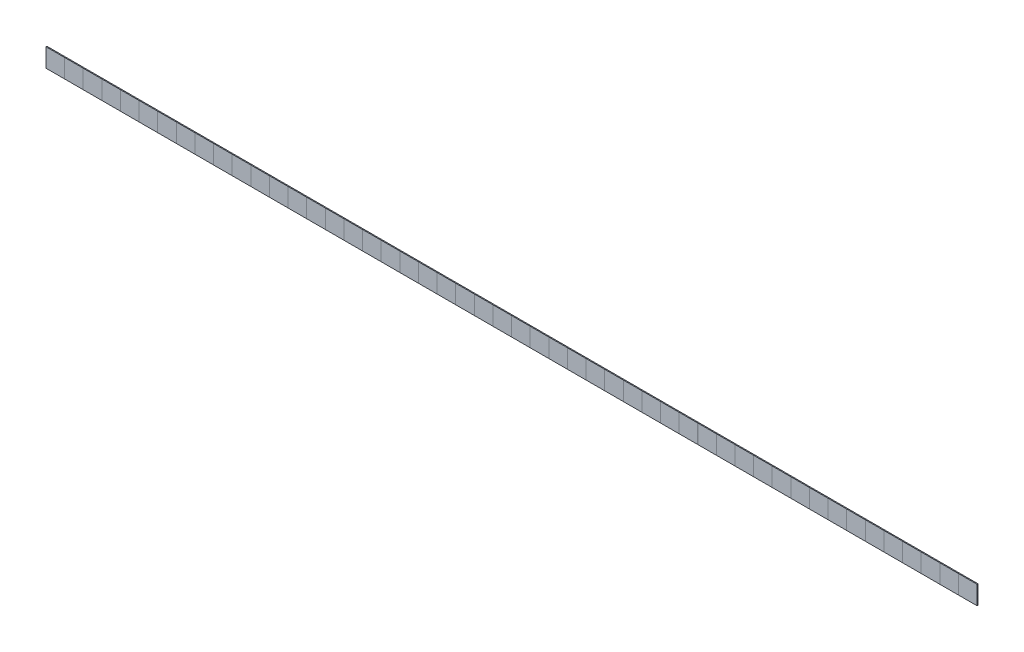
ISO-10303-21;
HEADER;
FILE_DESCRIPTION(('STEP AP214'),'2;1');
FILE_NAME('part.step','',(''),(''),'','','');
FILE_SCHEMA(('AUTOMOTIVE_DESIGN { 1 0 10303 214 1 1 1 1 }'));
ENDSEC;
DATA;
#1=APPLICATION_CONTEXT('core data for automotive mechanical design processes');
#2=APPLICATION_PROTOCOL_DEFINITION('international standard','automotive_design',2000,#1);
#3=PRODUCT_CONTEXT('',#1,'mechanical');
#4=PRODUCT('Part','Part','',(#3));
#5=PRODUCT_RELATED_PRODUCT_CATEGORY('part','',(#4));
#6=PRODUCT_DEFINITION_FORMATION('','',#4);
#7=PRODUCT_DEFINITION_CONTEXT('part definition',#1,'design');
#8=PRODUCT_DEFINITION('design','',#6,#7);
#9=PRODUCT_DEFINITION_SHAPE('','',#8);
#10=(LENGTH_UNIT() NAMED_UNIT(*) SI_UNIT(.MILLI.,.METRE.));
#11=(NAMED_UNIT(*) PLANE_ANGLE_UNIT() SI_UNIT($,.RADIAN.));
#12=(NAMED_UNIT(*) SI_UNIT($,.STERADIAN.) SOLID_ANGLE_UNIT());
#13=UNCERTAINTY_MEASURE_WITH_UNIT(LENGTH_MEASURE(1.E-05),#10,'distance_accuracy_value','');
#14=(GEOMETRIC_REPRESENTATION_CONTEXT(3) GLOBAL_UNCERTAINTY_ASSIGNED_CONTEXT((#13)) GLOBAL_UNIT_ASSIGNED_CONTEXT((#10,
#11,#12)) REPRESENTATION_CONTEXT('',''));
#15=CARTESIAN_POINT('',(0.,0.,0.));
#16=DIRECTION('',(0.,0.,1.));
#17=DIRECTION('',(1.,0.,0.));
#18=AXIS2_PLACEMENT_3D('',#15,#16,#17);
#19=CARTESIAN_POINT('',(0.,0.,500.));
#20=DIRECTION('',(0.,0.,1.));
#21=DIRECTION('',(1.,0.,0.));
#22=AXIS2_PLACEMENT_3D('',#19,#20,#21);
#23=PLANE('',#22);
#24=DIRECTION('',(0.,-1.,0.));
#25=VECTOR('',#24,1.);
#26=CARTESIAN_POINT('',(473189.921076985,27840.2926829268,500.));
#27=LINE('',#26,#25);
#28=CARTESIAN_POINT('',(473189.921076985,5518.29268292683,500.));
#29=VERTEX_POINT('',#28);
#30=CARTESIAN_POINT('',(473189.921076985,-4481.70731707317,500.));
#31=VERTEX_POINT('',#30);
#32=EDGE_CURVE('E45',#29,#31,#27,.T.);
#33=ORIENTED_EDGE('',*,*,#32,.F.);
#34=DIRECTION('',(-1.,0.,0.));
#35=VECTOR('',#34,1.);
#36=CARTESIAN_POINT('',(-16807.5789230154,5518.29268292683,500.));
#37=LINE('',#36,#35);
#38=CARTESIAN_POINT('',(463194.921076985,5518.29268292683,500.));
#39=VERTEX_POINT('',#38);
#40=EDGE_CURVE('E990',#29,#39,#37,.T.);
#41=ORIENTED_EDGE('',*,*,#40,.T.);
#42=DIRECTION('',(0.,-1.,0.));
#43=VECTOR('',#42,1.);
#44=CARTESIAN_POINT('',(463194.921076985,27840.2926829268,500.));
#45=LINE('',#44,#43);
#46=CARTESIAN_POINT('',(463194.921076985,-4481.70731707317,500.));
#47=VERTEX_POINT('',#46);
#48=EDGE_CURVE('E948',#47,#39,#45,.F.);
#49=ORIENTED_EDGE('',*,*,#48,.F.);
#50=DIRECTION('',(1.,0.,0.));
#51=VECTOR('',#50,1.);
#52=CARTESIAN_POINT('',(-16807.5789230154,-4481.70731707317,500.));
#53=LINE('',#52,#51);
#54=EDGE_CURVE('E963',#47,#31,#53,.T.);
#55=ORIENTED_EDGE('',*,*,#54,.T.);
#56=EDGE_LOOP('',(#33,#41,#49,#55));
#57=FACE_BOUND('',#56,.T.);
#58=ADVANCED_FACE('F37',(#57),#23,.T.);
#59=DIRECTION('',(0.,-1.,0.));
#60=VECTOR('',#59,1.);
#61=CARTESIAN_POINT('',(463189.921076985,27840.2926829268,500.));
#62=LINE('',#61,#60);
#63=CARTESIAN_POINT('',(463189.921076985,5518.29268292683,500.));
#64=VERTEX_POINT('',#63);
#65=CARTESIAN_POINT('',(463189.921076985,-4481.70731707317,500.));
#66=VERTEX_POINT('',#65);
#67=EDGE_CURVE('E951',#64,#66,#62,.T.);
#68=ORIENTED_EDGE('',*,*,#67,.F.);
#69=CARTESIAN_POINT('',(453194.921076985,5518.29268292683,500.));
#70=VERTEX_POINT('',#69);
#71=EDGE_CURVE('E993',#64,#70,#37,.T.);
#72=ORIENTED_EDGE('',*,*,#71,.T.);
#73=DIRECTION('',(0.,-1.,0.));
#74=VECTOR('',#73,1.);
#75=CARTESIAN_POINT('',(453194.921076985,27840.2926829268,500.));
#76=LINE('',#75,#74);
#77=CARTESIAN_POINT('',(453194.921076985,-4481.70731707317,500.));
#78=VERTEX_POINT('',#77);
#79=EDGE_CURVE('E943',#78,#70,#76,.F.);
#80=ORIENTED_EDGE('',*,*,#79,.F.);
#81=EDGE_CURVE('E966',#78,#66,#53,.T.);
#82=ORIENTED_EDGE('',*,*,#81,.T.);
#83=EDGE_LOOP('',(#68,#72,#80,#82));
#84=FACE_BOUND('',#83,.T.);
#85=ADVANCED_FACE('F1272',(#84),#23,.T.);
#86=DIRECTION('',(0.,-1.,0.));
#87=VECTOR('',#86,1.);
#88=CARTESIAN_POINT('',(453189.921076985,27840.2926829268,500.));
#89=LINE('',#88,#87);
#90=CARTESIAN_POINT('',(453189.921076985,5518.29268292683,500.));
#91=VERTEX_POINT('',#90);
#92=CARTESIAN_POINT('',(453189.921076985,-4481.70731707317,500.));
#93=VERTEX_POINT('',#92);
#94=EDGE_CURVE('E946',#91,#93,#89,.T.);
#95=ORIENTED_EDGE('',*,*,#94,.F.);
#96=CARTESIAN_POINT('',(443194.921076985,5518.29268292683,500.));
#97=VERTEX_POINT('',#96);
#98=EDGE_CURVE('E994',#91,#97,#37,.T.);
#99=ORIENTED_EDGE('',*,*,#98,.T.);
#100=DIRECTION('',(0.,-1.,0.));
#101=VECTOR('',#100,1.);
#102=CARTESIAN_POINT('',(443194.921076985,27840.2926829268,500.));
#103=LINE('',#102,#101);
#104=CARTESIAN_POINT('',(443194.921076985,-4481.70731707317,500.));
#105=VERTEX_POINT('',#104);
#106=EDGE_CURVE('E938',#105,#97,#103,.F.);
#107=ORIENTED_EDGE('',*,*,#106,.F.);
#108=EDGE_CURVE('E968',#105,#93,#53,.T.);
#109=ORIENTED_EDGE('',*,*,#108,.T.);
#110=EDGE_LOOP('',(#95,#99,#107,#109));
#111=FACE_BOUND('',#110,.T.);
#112=ADVANCED_FACE('F1276',(#111),#23,.T.);
#113=DIRECTION('',(0.,-1.,0.));
#114=VECTOR('',#113,1.);
#115=CARTESIAN_POINT('',(443189.921076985,27840.2926829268,500.));
#116=LINE('',#115,#114);
#117=CARTESIAN_POINT('',(443189.921076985,5518.29268292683,500.));
#118=VERTEX_POINT('',#117);
#119=CARTESIAN_POINT('',(443189.921076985,-4481.70731707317,500.));
#120=VERTEX_POINT('',#119);
#121=EDGE_CURVE('E941',#118,#120,#116,.T.);
#122=ORIENTED_EDGE('',*,*,#121,.F.);
#123=CARTESIAN_POINT('',(433194.921076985,5518.29268292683,500.));
#124=VERTEX_POINT('',#123);
#125=EDGE_CURVE('E999',#118,#124,#37,.T.);
#126=ORIENTED_EDGE('',*,*,#125,.T.);
#127=DIRECTION('',(0.,-1.,0.));
#128=VECTOR('',#127,1.);
#129=CARTESIAN_POINT('',(433194.921076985,27840.2926829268,500.));
#130=LINE('',#129,#128);
#131=CARTESIAN_POINT('',(433194.921076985,-4481.70731707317,500.));
#132=VERTEX_POINT('',#131);
#133=EDGE_CURVE('E933',#132,#124,#130,.F.);
#134=ORIENTED_EDGE('',*,*,#133,.F.);
#135=EDGE_CURVE('E2330',#132,#120,#53,.T.);
#136=ORIENTED_EDGE('',*,*,#135,.T.);
#137=EDGE_LOOP('',(#122,#126,#134,#136));
#138=FACE_BOUND('',#137,.T.);
#139=ADVANCED_FACE('F1703',(#138),#23,.T.);
#140=DIRECTION('',(0.,-1.,0.));
#141=VECTOR('',#140,1.);
#142=CARTESIAN_POINT('',(433189.921076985,27840.2926829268,500.));
#143=LINE('',#142,#141);
#144=CARTESIAN_POINT('',(433189.921076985,5518.29268292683,500.));
#145=VERTEX_POINT('',#144);
#146=CARTESIAN_POINT('',(433189.921076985,-4481.70731707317,500.));
#147=VERTEX_POINT('',#146);
#148=EDGE_CURVE('E936',#145,#147,#143,.T.);
#149=ORIENTED_EDGE('',*,*,#148,.F.);
#150=CARTESIAN_POINT('',(423194.921076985,5518.29268292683,500.));
#151=VERTEX_POINT('',#150);
#152=EDGE_CURVE('E1004',#145,#151,#37,.T.);
#153=ORIENTED_EDGE('',*,*,#152,.T.);
#154=DIRECTION('',(0.,-1.,0.));
#155=VECTOR('',#154,1.);
#156=CARTESIAN_POINT('',(423194.921076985,27840.2926829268,500.));
#157=LINE('',#156,#155);
#158=CARTESIAN_POINT('',(423194.921076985,-4481.70731707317,500.));
#159=VERTEX_POINT('',#158);
#160=EDGE_CURVE('E928',#159,#151,#157,.F.);
#161=ORIENTED_EDGE('',*,*,#160,.F.);
#162=EDGE_CURVE('E2327',#159,#147,#53,.T.);
#163=ORIENTED_EDGE('',*,*,#162,.T.);
#164=EDGE_LOOP('',(#149,#153,#161,#163));
#165=FACE_BOUND('',#164,.T.);
#166=ADVANCED_FACE('F1712',(#165),#23,.T.);
#167=DIRECTION('',(0.,-1.,0.));
#168=VECTOR('',#167,1.);
#169=CARTESIAN_POINT('',(423189.921076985,27840.2926829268,500.));
#170=LINE('',#169,#168);
#171=CARTESIAN_POINT('',(423189.921076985,5518.29268292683,500.));
#172=VERTEX_POINT('',#171);
#173=CARTESIAN_POINT('',(423189.921076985,-4481.70731707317,500.));
#174=VERTEX_POINT('',#173);
#175=EDGE_CURVE('E931',#172,#174,#170,.T.);
#176=ORIENTED_EDGE('',*,*,#175,.F.);
#177=CARTESIAN_POINT('',(413194.921076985,5518.29268292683,500.));
#178=VERTEX_POINT('',#177);
#179=EDGE_CURVE('E1009',#172,#178,#37,.T.);
#180=ORIENTED_EDGE('',*,*,#179,.T.);
#181=DIRECTION('',(0.,-1.,0.));
#182=VECTOR('',#181,1.);
#183=CARTESIAN_POINT('',(413194.921076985,27840.2926829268,500.));
#184=LINE('',#183,#182);
#185=CARTESIAN_POINT('',(413194.921076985,-4481.70731707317,500.));
#186=VERTEX_POINT('',#185);
#187=EDGE_CURVE('E923',#186,#178,#184,.F.);
#188=ORIENTED_EDGE('',*,*,#187,.F.);
#189=EDGE_CURVE('E2324',#186,#174,#53,.T.);
#190=ORIENTED_EDGE('',*,*,#189,.T.);
#191=EDGE_LOOP('',(#176,#180,#188,#190));
#192=FACE_BOUND('',#191,.T.);
#193=ADVANCED_FACE('F1721',(#192),#23,.T.);
#194=DIRECTION('',(0.,-1.,0.));
#195=VECTOR('',#194,1.);
#196=CARTESIAN_POINT('',(413189.921076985,27840.2926829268,500.));
#197=LINE('',#196,#195);
#198=CARTESIAN_POINT('',(413189.921076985,5518.29268292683,500.));
#199=VERTEX_POINT('',#198);
#200=CARTESIAN_POINT('',(413189.921076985,-4481.70731707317,500.));
#201=VERTEX_POINT('',#200);
#202=EDGE_CURVE('E926',#199,#201,#197,.T.);
#203=ORIENTED_EDGE('',*,*,#202,.F.);
#204=CARTESIAN_POINT('',(403194.921076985,5518.29268292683,500.));
#205=VERTEX_POINT('',#204);
#206=EDGE_CURVE('E1014',#199,#205,#37,.T.);
#207=ORIENTED_EDGE('',*,*,#206,.T.);
#208=DIRECTION('',(0.,-1.,0.));
#209=VECTOR('',#208,1.);
#210=CARTESIAN_POINT('',(403194.921076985,27840.2926829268,500.));
#211=LINE('',#210,#209);
#212=CARTESIAN_POINT('',(403194.921076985,-4481.70731707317,500.));
#213=VERTEX_POINT('',#212);
#214=EDGE_CURVE('E918',#213,#205,#211,.F.);
#215=ORIENTED_EDGE('',*,*,#214,.F.);
#216=EDGE_CURVE('E2321',#213,#201,#53,.T.);
#217=ORIENTED_EDGE('',*,*,#216,.T.);
#218=EDGE_LOOP('',(#203,#207,#215,#217));
#219=FACE_BOUND('',#218,.T.);
#220=ADVANCED_FACE('F1730',(#219),#23,.T.);
#221=DIRECTION('',(0.,-1.,0.));
#222=VECTOR('',#221,1.);
#223=CARTESIAN_POINT('',(403189.921076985,27840.2926829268,500.));
#224=LINE('',#223,#222);
#225=CARTESIAN_POINT('',(403189.921076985,5518.29268292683,500.));
#226=VERTEX_POINT('',#225);
#227=CARTESIAN_POINT('',(403189.921076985,-4481.70731707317,500.));
#228=VERTEX_POINT('',#227);
#229=EDGE_CURVE('E921',#226,#228,#224,.T.);
#230=ORIENTED_EDGE('',*,*,#229,.F.);
#231=CARTESIAN_POINT('',(393194.921076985,5518.29268292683,500.));
#232=VERTEX_POINT('',#231);
#233=EDGE_CURVE('E1019',#226,#232,#37,.T.);
#234=ORIENTED_EDGE('',*,*,#233,.T.);
#235=DIRECTION('',(0.,-1.,0.));
#236=VECTOR('',#235,1.);
#237=CARTESIAN_POINT('',(393194.921076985,27840.2926829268,500.));
#238=LINE('',#237,#236);
#239=CARTESIAN_POINT('',(393194.921076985,-4481.70731707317,500.));
#240=VERTEX_POINT('',#239);
#241=EDGE_CURVE('E913',#240,#232,#238,.F.);
#242=ORIENTED_EDGE('',*,*,#241,.F.);
#243=EDGE_CURVE('E2318',#240,#228,#53,.T.);
#244=ORIENTED_EDGE('',*,*,#243,.T.);
#245=EDGE_LOOP('',(#230,#234,#242,#244));
#246=FACE_BOUND('',#245,.T.);
#247=ADVANCED_FACE('F1739',(#246),#23,.T.);
#248=DIRECTION('',(0.,-1.,0.));
#249=VECTOR('',#248,1.);
#250=CARTESIAN_POINT('',(393189.921076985,27840.2926829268,500.));
#251=LINE('',#250,#249);
#252=CARTESIAN_POINT('',(393189.921076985,5518.29268292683,500.));
#253=VERTEX_POINT('',#252);
#254=CARTESIAN_POINT('',(393189.921076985,-4481.70731707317,500.));
#255=VERTEX_POINT('',#254);
#256=EDGE_CURVE('E916',#253,#255,#251,.T.);
#257=ORIENTED_EDGE('',*,*,#256,.F.);
#258=CARTESIAN_POINT('',(383194.921076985,5518.29268292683,500.));
#259=VERTEX_POINT('',#258);
#260=EDGE_CURVE('E1024',#253,#259,#37,.T.);
#261=ORIENTED_EDGE('',*,*,#260,.T.);
#262=DIRECTION('',(0.,-1.,0.));
#263=VECTOR('',#262,1.);
#264=CARTESIAN_POINT('',(383194.921076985,27840.2926829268,500.));
#265=LINE('',#264,#263);
#266=CARTESIAN_POINT('',(383194.921076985,-4481.70731707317,500.));
#267=VERTEX_POINT('',#266);
#268=EDGE_CURVE('E908',#267,#259,#265,.F.);
#269=ORIENTED_EDGE('',*,*,#268,.F.);
#270=EDGE_CURVE('E2315',#267,#255,#53,.T.);
#271=ORIENTED_EDGE('',*,*,#270,.T.);
#272=EDGE_LOOP('',(#257,#261,#269,#271));
#273=FACE_BOUND('',#272,.T.);
#274=ADVANCED_FACE('F1748',(#273),#23,.T.);
#275=DIRECTION('',(0.,-1.,0.));
#276=VECTOR('',#275,1.);
#277=CARTESIAN_POINT('',(383189.921076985,27840.2926829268,500.));
#278=LINE('',#277,#276);
#279=CARTESIAN_POINT('',(383189.921076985,5518.29268292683,500.));
#280=VERTEX_POINT('',#279);
#281=CARTESIAN_POINT('',(383189.921076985,-4481.70731707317,500.));
#282=VERTEX_POINT('',#281);
#283=EDGE_CURVE('E911',#280,#282,#278,.T.);
#284=ORIENTED_EDGE('',*,*,#283,.F.);
#285=CARTESIAN_POINT('',(373194.921076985,5518.29268292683,500.));
#286=VERTEX_POINT('',#285);
#287=EDGE_CURVE('E1029',#280,#286,#37,.T.);
#288=ORIENTED_EDGE('',*,*,#287,.T.);
#289=DIRECTION('',(0.,-1.,0.));
#290=VECTOR('',#289,1.);
#291=CARTESIAN_POINT('',(373194.921076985,27840.2926829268,500.));
#292=LINE('',#291,#290);
#293=CARTESIAN_POINT('',(373194.921076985,-4481.70731707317,500.));
#294=VERTEX_POINT('',#293);
#295=EDGE_CURVE('E903',#294,#286,#292,.F.);
#296=ORIENTED_EDGE('',*,*,#295,.F.);
#297=EDGE_CURVE('E2312',#294,#282,#53,.T.);
#298=ORIENTED_EDGE('',*,*,#297,.T.);
#299=EDGE_LOOP('',(#284,#288,#296,#298));
#300=FACE_BOUND('',#299,.T.);
#301=ADVANCED_FACE('F1757',(#300),#23,.T.);
#302=DIRECTION('',(0.,-1.,0.));
#303=VECTOR('',#302,1.);
#304=CARTESIAN_POINT('',(373189.921076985,27840.2926829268,500.));
#305=LINE('',#304,#303);
#306=CARTESIAN_POINT('',(373189.921076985,5518.29268292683,500.));
#307=VERTEX_POINT('',#306);
#308=CARTESIAN_POINT('',(373189.921076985,-4481.70731707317,500.));
#309=VERTEX_POINT('',#308);
#310=EDGE_CURVE('E906',#307,#309,#305,.T.);
#311=ORIENTED_EDGE('',*,*,#310,.F.);
#312=CARTESIAN_POINT('',(363194.921076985,5518.29268292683,500.));
#313=VERTEX_POINT('',#312);
#314=EDGE_CURVE('E1034',#307,#313,#37,.T.);
#315=ORIENTED_EDGE('',*,*,#314,.T.);
#316=DIRECTION('',(0.,-1.,0.));
#317=VECTOR('',#316,1.);
#318=CARTESIAN_POINT('',(363194.921076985,27840.2926829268,500.));
#319=LINE('',#318,#317);
#320=CARTESIAN_POINT('',(363194.921076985,-4481.70731707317,500.));
#321=VERTEX_POINT('',#320);
#322=EDGE_CURVE('E898',#321,#313,#319,.F.);
#323=ORIENTED_EDGE('',*,*,#322,.F.);
#324=EDGE_CURVE('E2309',#321,#309,#53,.T.);
#325=ORIENTED_EDGE('',*,*,#324,.T.);
#326=EDGE_LOOP('',(#311,#315,#323,#325));
#327=FACE_BOUND('',#326,.T.);
#328=ADVANCED_FACE('F1766',(#327),#23,.T.);
#329=DIRECTION('',(0.,-1.,0.));
#330=VECTOR('',#329,1.);
#331=CARTESIAN_POINT('',(363189.921076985,27840.2926829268,500.));
#332=LINE('',#331,#330);
#333=CARTESIAN_POINT('',(363189.921076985,5518.29268292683,500.));
#334=VERTEX_POINT('',#333);
#335=CARTESIAN_POINT('',(363189.921076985,-4481.70731707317,500.));
#336=VERTEX_POINT('',#335);
#337=EDGE_CURVE('E901',#334,#336,#332,.T.);
#338=ORIENTED_EDGE('',*,*,#337,.F.);
#339=CARTESIAN_POINT('',(353194.921076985,5518.29268292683,500.));
#340=VERTEX_POINT('',#339);
#341=EDGE_CURVE('E1039',#334,#340,#37,.T.);
#342=ORIENTED_EDGE('',*,*,#341,.T.);
#343=DIRECTION('',(0.,-1.,0.));
#344=VECTOR('',#343,1.);
#345=CARTESIAN_POINT('',(353194.921076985,27840.2926829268,500.));
#346=LINE('',#345,#344);
#347=CARTESIAN_POINT('',(353194.921076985,-4481.70731707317,500.));
#348=VERTEX_POINT('',#347);
#349=EDGE_CURVE('E893',#348,#340,#346,.F.);
#350=ORIENTED_EDGE('',*,*,#349,.F.);
#351=EDGE_CURVE('E2306',#348,#336,#53,.T.);
#352=ORIENTED_EDGE('',*,*,#351,.T.);
#353=EDGE_LOOP('',(#338,#342,#350,#352));
#354=FACE_BOUND('',#353,.T.);
#355=ADVANCED_FACE('F1775',(#354),#23,.T.);
#356=DIRECTION('',(0.,-1.,0.));
#357=VECTOR('',#356,1.);
#358=CARTESIAN_POINT('',(353189.921076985,27840.2926829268,500.));
#359=LINE('',#358,#357);
#360=CARTESIAN_POINT('',(353189.921076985,5518.29268292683,500.));
#361=VERTEX_POINT('',#360);
#362=CARTESIAN_POINT('',(353189.921076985,-4481.70731707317,500.));
#363=VERTEX_POINT('',#362);
#364=EDGE_CURVE('E896',#361,#363,#359,.T.);
#365=ORIENTED_EDGE('',*,*,#364,.F.);
#366=CARTESIAN_POINT('',(343194.921076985,5518.29268292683,500.));
#367=VERTEX_POINT('',#366);
#368=EDGE_CURVE('E1044',#361,#367,#37,.T.);
#369=ORIENTED_EDGE('',*,*,#368,.T.);
#370=DIRECTION('',(0.,-1.,0.));
#371=VECTOR('',#370,1.);
#372=CARTESIAN_POINT('',(343194.921076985,27840.2926829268,500.));
#373=LINE('',#372,#371);
#374=CARTESIAN_POINT('',(343194.921076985,-4481.70731707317,500.));
#375=VERTEX_POINT('',#374);
#376=EDGE_CURVE('E888',#375,#367,#373,.F.);
#377=ORIENTED_EDGE('',*,*,#376,.F.);
#378=EDGE_CURVE('E2303',#375,#363,#53,.T.);
#379=ORIENTED_EDGE('',*,*,#378,.T.);
#380=EDGE_LOOP('',(#365,#369,#377,#379));
#381=FACE_BOUND('',#380,.T.);
#382=ADVANCED_FACE('F1784',(#381),#23,.T.);
#383=DIRECTION('',(0.,-1.,0.));
#384=VECTOR('',#383,1.);
#385=CARTESIAN_POINT('',(343189.921076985,27840.2926829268,500.));
#386=LINE('',#385,#384);
#387=CARTESIAN_POINT('',(343189.921076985,5518.29268292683,500.));
#388=VERTEX_POINT('',#387);
#389=CARTESIAN_POINT('',(343189.921076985,-4481.70731707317,500.));
#390=VERTEX_POINT('',#389);
#391=EDGE_CURVE('E891',#388,#390,#386,.T.);
#392=ORIENTED_EDGE('',*,*,#391,.F.);
#393=CARTESIAN_POINT('',(333194.921076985,5518.29268292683,500.));
#394=VERTEX_POINT('',#393);
#395=EDGE_CURVE('E1049',#388,#394,#37,.T.);
#396=ORIENTED_EDGE('',*,*,#395,.T.);
#397=DIRECTION('',(0.,-1.,0.));
#398=VECTOR('',#397,1.);
#399=CARTESIAN_POINT('',(333194.921076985,27840.2926829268,500.));
#400=LINE('',#399,#398);
#401=CARTESIAN_POINT('',(333194.921076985,-4481.70731707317,500.));
#402=VERTEX_POINT('',#401);
#403=EDGE_CURVE('E883',#402,#394,#400,.F.);
#404=ORIENTED_EDGE('',*,*,#403,.F.);
#405=EDGE_CURVE('E2300',#402,#390,#53,.T.);
#406=ORIENTED_EDGE('',*,*,#405,.T.);
#407=EDGE_LOOP('',(#392,#396,#404,#406));
#408=FACE_BOUND('',#407,.T.);
#409=ADVANCED_FACE('F1793',(#408),#23,.T.);
#410=DIRECTION('',(0.,-1.,0.));
#411=VECTOR('',#410,1.);
#412=CARTESIAN_POINT('',(333189.921076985,27840.2926829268,500.));
#413=LINE('',#412,#411);
#414=CARTESIAN_POINT('',(333189.921076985,5518.29268292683,500.));
#415=VERTEX_POINT('',#414);
#416=CARTESIAN_POINT('',(333189.921076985,-4481.70731707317,500.));
#417=VERTEX_POINT('',#416);
#418=EDGE_CURVE('E886',#415,#417,#413,.T.);
#419=ORIENTED_EDGE('',*,*,#418,.F.);
#420=CARTESIAN_POINT('',(323194.921076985,5518.29268292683,500.));
#421=VERTEX_POINT('',#420);
#422=EDGE_CURVE('E1054',#415,#421,#37,.T.);
#423=ORIENTED_EDGE('',*,*,#422,.T.);
#424=DIRECTION('',(0.,-1.,0.));
#425=VECTOR('',#424,1.);
#426=CARTESIAN_POINT('',(323194.921076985,27840.2926829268,500.));
#427=LINE('',#426,#425);
#428=CARTESIAN_POINT('',(323194.921076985,-4481.70731707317,500.));
#429=VERTEX_POINT('',#428);
#430=EDGE_CURVE('E878',#429,#421,#427,.F.);
#431=ORIENTED_EDGE('',*,*,#430,.F.);
#432=EDGE_CURVE('E2297',#429,#417,#53,.T.);
#433=ORIENTED_EDGE('',*,*,#432,.T.);
#434=EDGE_LOOP('',(#419,#423,#431,#433));
#435=FACE_BOUND('',#434,.T.);
#436=ADVANCED_FACE('F1802',(#435),#23,.T.);
#437=DIRECTION('',(0.,-1.,0.));
#438=VECTOR('',#437,1.);
#439=CARTESIAN_POINT('',(323189.921076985,27840.2926829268,500.));
#440=LINE('',#439,#438);
#441=CARTESIAN_POINT('',(323189.921076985,5518.29268292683,500.));
#442=VERTEX_POINT('',#441);
#443=CARTESIAN_POINT('',(323189.921076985,-4481.70731707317,500.));
#444=VERTEX_POINT('',#443);
#445=EDGE_CURVE('E881',#442,#444,#440,.T.);
#446=ORIENTED_EDGE('',*,*,#445,.F.);
#447=CARTESIAN_POINT('',(313194.921076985,5518.29268292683,500.));
#448=VERTEX_POINT('',#447);
#449=EDGE_CURVE('E1059',#442,#448,#37,.T.);
#450=ORIENTED_EDGE('',*,*,#449,.T.);
#451=DIRECTION('',(0.,-1.,0.));
#452=VECTOR('',#451,1.);
#453=CARTESIAN_POINT('',(313194.921076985,27840.2926829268,500.));
#454=LINE('',#453,#452);
#455=CARTESIAN_POINT('',(313194.921076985,-4481.70731707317,500.));
#456=VERTEX_POINT('',#455);
#457=EDGE_CURVE('E873',#456,#448,#454,.F.);
#458=ORIENTED_EDGE('',*,*,#457,.F.);
#459=EDGE_CURVE('E2294',#456,#444,#53,.T.);
#460=ORIENTED_EDGE('',*,*,#459,.T.);
#461=EDGE_LOOP('',(#446,#450,#458,#460));
#462=FACE_BOUND('',#461,.T.);
#463=ADVANCED_FACE('F1811',(#462),#23,.T.);
#464=DIRECTION('',(0.,-1.,0.));
#465=VECTOR('',#464,1.);
#466=CARTESIAN_POINT('',(313189.921076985,27840.2926829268,500.));
#467=LINE('',#466,#465);
#468=CARTESIAN_POINT('',(313189.921076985,5518.29268292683,500.));
#469=VERTEX_POINT('',#468);
#470=CARTESIAN_POINT('',(313189.921076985,-4481.70731707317,500.));
#471=VERTEX_POINT('',#470);
#472=EDGE_CURVE('E876',#469,#471,#467,.T.);
#473=ORIENTED_EDGE('',*,*,#472,.F.);
#474=CARTESIAN_POINT('',(303194.921076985,5518.29268292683,500.));
#475=VERTEX_POINT('',#474);
#476=EDGE_CURVE('E1064',#469,#475,#37,.T.);
#477=ORIENTED_EDGE('',*,*,#476,.T.);
#478=DIRECTION('',(0.,-1.,0.));
#479=VECTOR('',#478,1.);
#480=CARTESIAN_POINT('',(303194.921076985,27840.2926829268,500.));
#481=LINE('',#480,#479);
#482=CARTESIAN_POINT('',(303194.921076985,-4481.70731707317,500.));
#483=VERTEX_POINT('',#482);
#484=EDGE_CURVE('E868',#483,#475,#481,.F.);
#485=ORIENTED_EDGE('',*,*,#484,.F.);
#486=EDGE_CURVE('E2291',#483,#471,#53,.T.);
#487=ORIENTED_EDGE('',*,*,#486,.T.);
#488=EDGE_LOOP('',(#473,#477,#485,#487));
#489=FACE_BOUND('',#488,.T.);
#490=ADVANCED_FACE('F1820',(#489),#23,.T.);
#491=DIRECTION('',(0.,-1.,0.));
#492=VECTOR('',#491,1.);
#493=CARTESIAN_POINT('',(303189.921076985,27840.2926829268,500.));
#494=LINE('',#493,#492);
#495=CARTESIAN_POINT('',(303189.921076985,5518.29268292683,500.));
#496=VERTEX_POINT('',#495);
#497=CARTESIAN_POINT('',(303189.921076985,-4481.70731707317,500.));
#498=VERTEX_POINT('',#497);
#499=EDGE_CURVE('E871',#496,#498,#494,.T.);
#500=ORIENTED_EDGE('',*,*,#499,.F.);
#501=CARTESIAN_POINT('',(293194.921076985,5518.29268292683,500.));
#502=VERTEX_POINT('',#501);
#503=EDGE_CURVE('E1069',#496,#502,#37,.T.);
#504=ORIENTED_EDGE('',*,*,#503,.T.);
#505=DIRECTION('',(0.,-1.,0.));
#506=VECTOR('',#505,1.);
#507=CARTESIAN_POINT('',(293194.921076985,27840.2926829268,500.));
#508=LINE('',#507,#506);
#509=CARTESIAN_POINT('',(293194.921076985,-4481.70731707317,500.));
#510=VERTEX_POINT('',#509);
#511=EDGE_CURVE('E863',#510,#502,#508,.F.);
#512=ORIENTED_EDGE('',*,*,#511,.F.);
#513=EDGE_CURVE('E2288',#510,#498,#53,.T.);
#514=ORIENTED_EDGE('',*,*,#513,.T.);
#515=EDGE_LOOP('',(#500,#504,#512,#514));
#516=FACE_BOUND('',#515,.T.);
#517=ADVANCED_FACE('F1829',(#516),#23,.T.);
#518=DIRECTION('',(0.,-1.,0.));
#519=VECTOR('',#518,1.);
#520=CARTESIAN_POINT('',(293189.921076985,27840.2926829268,500.));
#521=LINE('',#520,#519);
#522=CARTESIAN_POINT('',(293189.921076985,5518.29268292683,500.));
#523=VERTEX_POINT('',#522);
#524=CARTESIAN_POINT('',(293189.921076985,-4481.70731707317,500.));
#525=VERTEX_POINT('',#524);
#526=EDGE_CURVE('E866',#523,#525,#521,.T.);
#527=ORIENTED_EDGE('',*,*,#526,.F.);
#528=CARTESIAN_POINT('',(283194.921076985,5518.29268292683,500.));
#529=VERTEX_POINT('',#528);
#530=EDGE_CURVE('E1074',#523,#529,#37,.T.);
#531=ORIENTED_EDGE('',*,*,#530,.T.);
#532=DIRECTION('',(0.,-1.,0.));
#533=VECTOR('',#532,1.);
#534=CARTESIAN_POINT('',(283194.921076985,27840.2926829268,500.));
#535=LINE('',#534,#533);
#536=CARTESIAN_POINT('',(283194.921076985,-4481.70731707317,500.));
#537=VERTEX_POINT('',#536);
#538=EDGE_CURVE('E858',#537,#529,#535,.F.);
#539=ORIENTED_EDGE('',*,*,#538,.F.);
#540=EDGE_CURVE('E2285',#537,#525,#53,.T.);
#541=ORIENTED_EDGE('',*,*,#540,.T.);
#542=EDGE_LOOP('',(#527,#531,#539,#541));
#543=FACE_BOUND('',#542,.T.);
#544=ADVANCED_FACE('F1838',(#543),#23,.T.);
#545=DIRECTION('',(0.,-1.,0.));
#546=VECTOR('',#545,1.);
#547=CARTESIAN_POINT('',(283189.921076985,27840.2926829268,500.));
#548=LINE('',#547,#546);
#549=CARTESIAN_POINT('',(283189.921076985,5518.29268292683,500.));
#550=VERTEX_POINT('',#549);
#551=CARTESIAN_POINT('',(283189.921076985,-4481.70731707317,500.));
#552=VERTEX_POINT('',#551);
#553=EDGE_CURVE('E861',#550,#552,#548,.T.);
#554=ORIENTED_EDGE('',*,*,#553,.F.);
#555=CARTESIAN_POINT('',(273194.921076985,5518.29268292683,500.));
#556=VERTEX_POINT('',#555);
#557=EDGE_CURVE('E1079',#550,#556,#37,.T.);
#558=ORIENTED_EDGE('',*,*,#557,.T.);
#559=DIRECTION('',(0.,-1.,0.));
#560=VECTOR('',#559,1.);
#561=CARTESIAN_POINT('',(273194.921076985,27840.2926829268,500.));
#562=LINE('',#561,#560);
#563=CARTESIAN_POINT('',(273194.921076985,-4481.70731707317,500.));
#564=VERTEX_POINT('',#563);
#565=EDGE_CURVE('E853',#564,#556,#562,.F.);
#566=ORIENTED_EDGE('',*,*,#565,.F.);
#567=EDGE_CURVE('E2282',#564,#552,#53,.T.);
#568=ORIENTED_EDGE('',*,*,#567,.T.);
#569=EDGE_LOOP('',(#554,#558,#566,#568));
#570=FACE_BOUND('',#569,.T.);
#571=ADVANCED_FACE('F1847',(#570),#23,.T.);
#572=DIRECTION('',(0.,-1.,0.));
#573=VECTOR('',#572,1.);
#574=CARTESIAN_POINT('',(273189.921076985,27840.2926829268,500.));
#575=LINE('',#574,#573);
#576=CARTESIAN_POINT('',(273189.921076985,5518.29268292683,500.));
#577=VERTEX_POINT('',#576);
#578=CARTESIAN_POINT('',(273189.921076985,-4481.70731707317,500.));
#579=VERTEX_POINT('',#578);
#580=EDGE_CURVE('E856',#577,#579,#575,.T.);
#581=ORIENTED_EDGE('',*,*,#580,.F.);
#582=CARTESIAN_POINT('',(263194.921076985,5518.29268292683,500.));
#583=VERTEX_POINT('',#582);
#584=EDGE_CURVE('E1084',#577,#583,#37,.T.);
#585=ORIENTED_EDGE('',*,*,#584,.T.);
#586=DIRECTION('',(0.,-1.,0.));
#587=VECTOR('',#586,1.);
#588=CARTESIAN_POINT('',(263194.921076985,27840.2926829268,500.));
#589=LINE('',#588,#587);
#590=CARTESIAN_POINT('',(263194.921076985,-4481.70731707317,500.));
#591=VERTEX_POINT('',#590);
#592=EDGE_CURVE('E848',#591,#583,#589,.F.);
#593=ORIENTED_EDGE('',*,*,#592,.F.);
#594=EDGE_CURVE('E2279',#591,#579,#53,.T.);
#595=ORIENTED_EDGE('',*,*,#594,.T.);
#596=EDGE_LOOP('',(#581,#585,#593,#595));
#597=FACE_BOUND('',#596,.T.);
#598=ADVANCED_FACE('F1856',(#597),#23,.T.);
#599=DIRECTION('',(0.,-1.,0.));
#600=VECTOR('',#599,1.);
#601=CARTESIAN_POINT('',(263189.921076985,27840.2926829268,500.));
#602=LINE('',#601,#600);
#603=CARTESIAN_POINT('',(263189.921076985,5518.29268292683,500.));
#604=VERTEX_POINT('',#603);
#605=CARTESIAN_POINT('',(263189.921076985,-4481.70731707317,500.));
#606=VERTEX_POINT('',#605);
#607=EDGE_CURVE('E851',#604,#606,#602,.T.);
#608=ORIENTED_EDGE('',*,*,#607,.F.);
#609=CARTESIAN_POINT('',(253194.921076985,5518.29268292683,500.));
#610=VERTEX_POINT('',#609);
#611=EDGE_CURVE('E1089',#604,#610,#37,.T.);
#612=ORIENTED_EDGE('',*,*,#611,.T.);
#613=DIRECTION('',(0.,-1.,0.));
#614=VECTOR('',#613,1.);
#615=CARTESIAN_POINT('',(253194.921076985,27840.2926829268,500.));
#616=LINE('',#615,#614);
#617=CARTESIAN_POINT('',(253194.921076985,-4481.70731707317,500.));
#618=VERTEX_POINT('',#617);
#619=EDGE_CURVE('E843',#618,#610,#616,.F.);
#620=ORIENTED_EDGE('',*,*,#619,.F.);
#621=EDGE_CURVE('E2276',#618,#606,#53,.T.);
#622=ORIENTED_EDGE('',*,*,#621,.T.);
#623=EDGE_LOOP('',(#608,#612,#620,#622));
#624=FACE_BOUND('',#623,.T.);
#625=ADVANCED_FACE('F1865',(#624),#23,.T.);
#626=DIRECTION('',(0.,-1.,0.));
#627=VECTOR('',#626,1.);
#628=CARTESIAN_POINT('',(253189.921076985,27840.2926829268,500.));
#629=LINE('',#628,#627);
#630=CARTESIAN_POINT('',(253189.921076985,5518.29268292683,500.));
#631=VERTEX_POINT('',#630);
#632=CARTESIAN_POINT('',(253189.921076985,-4481.70731707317,500.));
#633=VERTEX_POINT('',#632);
#634=EDGE_CURVE('E846',#631,#633,#629,.T.);
#635=ORIENTED_EDGE('',*,*,#634,.F.);
#636=CARTESIAN_POINT('',(243194.921076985,5518.29268292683,500.));
#637=VERTEX_POINT('',#636);
#638=EDGE_CURVE('E1094',#631,#637,#37,.T.);
#639=ORIENTED_EDGE('',*,*,#638,.T.);
#640=DIRECTION('',(0.,-1.,0.));
#641=VECTOR('',#640,1.);
#642=CARTESIAN_POINT('',(243194.921076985,27840.2926829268,500.));
#643=LINE('',#642,#641);
#644=CARTESIAN_POINT('',(243194.921076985,-4481.70731707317,500.));
#645=VERTEX_POINT('',#644);
#646=EDGE_CURVE('E838',#645,#637,#643,.F.);
#647=ORIENTED_EDGE('',*,*,#646,.F.);
#648=EDGE_CURVE('E2273',#645,#633,#53,.T.);
#649=ORIENTED_EDGE('',*,*,#648,.T.);
#650=EDGE_LOOP('',(#635,#639,#647,#649));
#651=FACE_BOUND('',#650,.T.);
#652=ADVANCED_FACE('F1874',(#651),#23,.T.);
#653=DIRECTION('',(0.,-1.,0.));
#654=VECTOR('',#653,1.);
#655=CARTESIAN_POINT('',(243189.921076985,27840.2926829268,500.));
#656=LINE('',#655,#654);
#657=CARTESIAN_POINT('',(243189.921076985,5518.29268292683,500.));
#658=VERTEX_POINT('',#657);
#659=CARTESIAN_POINT('',(243189.921076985,-4481.70731707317,500.));
#660=VERTEX_POINT('',#659);
#661=EDGE_CURVE('E841',#658,#660,#656,.T.);
#662=ORIENTED_EDGE('',*,*,#661,.F.);
#663=CARTESIAN_POINT('',(233194.921076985,5518.29268292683,500.));
#664=VERTEX_POINT('',#663);
#665=EDGE_CURVE('E1099',#658,#664,#37,.T.);
#666=ORIENTED_EDGE('',*,*,#665,.T.);
#667=DIRECTION('',(0.,-1.,0.));
#668=VECTOR('',#667,1.);
#669=CARTESIAN_POINT('',(233194.921076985,27840.2926829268,500.));
#670=LINE('',#669,#668);
#671=CARTESIAN_POINT('',(233194.921076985,-4481.70731707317,500.));
#672=VERTEX_POINT('',#671);
#673=EDGE_CURVE('E833',#672,#664,#670,.F.);
#674=ORIENTED_EDGE('',*,*,#673,.F.);
#675=EDGE_CURVE('E2270',#672,#660,#53,.T.);
#676=ORIENTED_EDGE('',*,*,#675,.T.);
#677=EDGE_LOOP('',(#662,#666,#674,#676));
#678=FACE_BOUND('',#677,.T.);
#679=ADVANCED_FACE('F1883',(#678),#23,.T.);
#680=DIRECTION('',(0.,-1.,0.));
#681=VECTOR('',#680,1.);
#682=CARTESIAN_POINT('',(233189.921076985,27840.2926829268,500.));
#683=LINE('',#682,#681);
#684=CARTESIAN_POINT('',(233189.921076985,5518.29268292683,500.));
#685=VERTEX_POINT('',#684);
#686=CARTESIAN_POINT('',(233189.921076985,-4481.70731707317,500.));
#687=VERTEX_POINT('',#686);
#688=EDGE_CURVE('E836',#685,#687,#683,.T.);
#689=ORIENTED_EDGE('',*,*,#688,.F.);
#690=CARTESIAN_POINT('',(223194.921076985,5518.29268292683,500.));
#691=VERTEX_POINT('',#690);
#692=EDGE_CURVE('E1104',#685,#691,#37,.T.);
#693=ORIENTED_EDGE('',*,*,#692,.T.);
#694=DIRECTION('',(0.,-1.,0.));
#695=VECTOR('',#694,1.);
#696=CARTESIAN_POINT('',(223194.921076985,27840.2926829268,500.));
#697=LINE('',#696,#695);
#698=CARTESIAN_POINT('',(223194.921076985,-4481.70731707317,500.));
#699=VERTEX_POINT('',#698);
#700=EDGE_CURVE('E828',#699,#691,#697,.F.);
#701=ORIENTED_EDGE('',*,*,#700,.F.);
#702=EDGE_CURVE('E2267',#699,#687,#53,.T.);
#703=ORIENTED_EDGE('',*,*,#702,.T.);
#704=EDGE_LOOP('',(#689,#693,#701,#703));
#705=FACE_BOUND('',#704,.T.);
#706=ADVANCED_FACE('F1892',(#705),#23,.T.);
#707=DIRECTION('',(0.,-1.,0.));
#708=VECTOR('',#707,1.);
#709=CARTESIAN_POINT('',(223189.921076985,27840.2926829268,500.));
#710=LINE('',#709,#708);
#711=CARTESIAN_POINT('',(223189.921076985,5518.29268292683,500.));
#712=VERTEX_POINT('',#711);
#713=CARTESIAN_POINT('',(223189.921076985,-4481.70731707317,500.));
#714=VERTEX_POINT('',#713);
#715=EDGE_CURVE('E831',#712,#714,#710,.T.);
#716=ORIENTED_EDGE('',*,*,#715,.F.);
#717=CARTESIAN_POINT('',(213194.921076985,5518.29268292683,500.));
#718=VERTEX_POINT('',#717);
#719=EDGE_CURVE('E1109',#712,#718,#37,.T.);
#720=ORIENTED_EDGE('',*,*,#719,.T.);
#721=DIRECTION('',(0.,-1.,0.));
#722=VECTOR('',#721,1.);
#723=CARTESIAN_POINT('',(213194.921076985,27840.2926829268,500.));
#724=LINE('',#723,#722);
#725=CARTESIAN_POINT('',(213194.921076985,-4481.70731707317,500.));
#726=VERTEX_POINT('',#725);
#727=EDGE_CURVE('E823',#726,#718,#724,.F.);
#728=ORIENTED_EDGE('',*,*,#727,.F.);
#729=EDGE_CURVE('E2264',#726,#714,#53,.T.);
#730=ORIENTED_EDGE('',*,*,#729,.T.);
#731=EDGE_LOOP('',(#716,#720,#728,#730));
#732=FACE_BOUND('',#731,.T.);
#733=ADVANCED_FACE('F1901',(#732),#23,.T.);
#734=DIRECTION('',(0.,-1.,0.));
#735=VECTOR('',#734,1.);
#736=CARTESIAN_POINT('',(213189.921076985,27840.2926829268,500.));
#737=LINE('',#736,#735);
#738=CARTESIAN_POINT('',(213189.921076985,5518.29268292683,500.));
#739=VERTEX_POINT('',#738);
#740=CARTESIAN_POINT('',(213189.921076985,-4481.70731707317,500.));
#741=VERTEX_POINT('',#740);
#742=EDGE_CURVE('E826',#739,#741,#737,.T.);
#743=ORIENTED_EDGE('',*,*,#742,.F.);
#744=CARTESIAN_POINT('',(203194.921076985,5518.29268292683,500.));
#745=VERTEX_POINT('',#744);
#746=EDGE_CURVE('E1114',#739,#745,#37,.T.);
#747=ORIENTED_EDGE('',*,*,#746,.T.);
#748=DIRECTION('',(0.,-1.,0.));
#749=VECTOR('',#748,1.);
#750=CARTESIAN_POINT('',(203194.921076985,27840.2926829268,500.));
#751=LINE('',#750,#749);
#752=CARTESIAN_POINT('',(203194.921076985,-4481.70731707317,500.));
#753=VERTEX_POINT('',#752);
#754=EDGE_CURVE('E818',#753,#745,#751,.F.);
#755=ORIENTED_EDGE('',*,*,#754,.F.);
#756=EDGE_CURVE('E2261',#753,#741,#53,.T.);
#757=ORIENTED_EDGE('',*,*,#756,.T.);
#758=EDGE_LOOP('',(#743,#747,#755,#757));
#759=FACE_BOUND('',#758,.T.);
#760=ADVANCED_FACE('F1910',(#759),#23,.T.);
#761=DIRECTION('',(0.,-1.,0.));
#762=VECTOR('',#761,1.);
#763=CARTESIAN_POINT('',(203189.921076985,27840.2926829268,500.));
#764=LINE('',#763,#762);
#765=CARTESIAN_POINT('',(203189.921076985,5518.29268292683,500.));
#766=VERTEX_POINT('',#765);
#767=CARTESIAN_POINT('',(203189.921076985,-4481.70731707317,500.));
#768=VERTEX_POINT('',#767);
#769=EDGE_CURVE('E821',#766,#768,#764,.T.);
#770=ORIENTED_EDGE('',*,*,#769,.F.);
#771=CARTESIAN_POINT('',(193194.921076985,5518.29268292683,500.));
#772=VERTEX_POINT('',#771);
#773=EDGE_CURVE('E1119',#766,#772,#37,.T.);
#774=ORIENTED_EDGE('',*,*,#773,.T.);
#775=DIRECTION('',(0.,-1.,0.));
#776=VECTOR('',#775,1.);
#777=CARTESIAN_POINT('',(193194.921076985,27840.2926829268,500.));
#778=LINE('',#777,#776);
#779=CARTESIAN_POINT('',(193194.921076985,-4481.70731707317,500.));
#780=VERTEX_POINT('',#779);
#781=EDGE_CURVE('E813',#780,#772,#778,.F.);
#782=ORIENTED_EDGE('',*,*,#781,.F.);
#783=EDGE_CURVE('E2258',#780,#768,#53,.T.);
#784=ORIENTED_EDGE('',*,*,#783,.T.);
#785=EDGE_LOOP('',(#770,#774,#782,#784));
#786=FACE_BOUND('',#785,.T.);
#787=ADVANCED_FACE('F1919',(#786),#23,.T.);
#788=DIRECTION('',(0.,-1.,0.));
#789=VECTOR('',#788,1.);
#790=CARTESIAN_POINT('',(193189.921076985,27840.2926829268,500.));
#791=LINE('',#790,#789);
#792=CARTESIAN_POINT('',(193189.921076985,5518.29268292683,500.));
#793=VERTEX_POINT('',#792);
#794=CARTESIAN_POINT('',(193189.921076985,-4481.70731707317,500.));
#795=VERTEX_POINT('',#794);
#796=EDGE_CURVE('E816',#793,#795,#791,.T.);
#797=ORIENTED_EDGE('',*,*,#796,.F.);
#798=CARTESIAN_POINT('',(183194.921076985,5518.29268292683,500.));
#799=VERTEX_POINT('',#798);
#800=EDGE_CURVE('E1124',#793,#799,#37,.T.);
#801=ORIENTED_EDGE('',*,*,#800,.T.);
#802=DIRECTION('',(0.,-1.,0.));
#803=VECTOR('',#802,1.);
#804=CARTESIAN_POINT('',(183194.921076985,27840.2926829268,500.));
#805=LINE('',#804,#803);
#806=CARTESIAN_POINT('',(183194.921076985,-4481.70731707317,500.));
#807=VERTEX_POINT('',#806);
#808=EDGE_CURVE('E808',#807,#799,#805,.F.);
#809=ORIENTED_EDGE('',*,*,#808,.F.);
#810=EDGE_CURVE('E2255',#807,#795,#53,.T.);
#811=ORIENTED_EDGE('',*,*,#810,.T.);
#812=EDGE_LOOP('',(#797,#801,#809,#811));
#813=FACE_BOUND('',#812,.T.);
#814=ADVANCED_FACE('F1928',(#813),#23,.T.);
#815=DIRECTION('',(0.,-1.,0.));
#816=VECTOR('',#815,1.);
#817=CARTESIAN_POINT('',(183189.921076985,27840.2926829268,500.));
#818=LINE('',#817,#816);
#819=CARTESIAN_POINT('',(183189.921076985,5518.29268292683,500.));
#820=VERTEX_POINT('',#819);
#821=CARTESIAN_POINT('',(183189.921076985,-4481.70731707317,500.));
#822=VERTEX_POINT('',#821);
#823=EDGE_CURVE('E811',#820,#822,#818,.T.);
#824=ORIENTED_EDGE('',*,*,#823,.F.);
#825=CARTESIAN_POINT('',(173194.921076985,5518.29268292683,500.));
#826=VERTEX_POINT('',#825);
#827=EDGE_CURVE('E1129',#820,#826,#37,.T.);
#828=ORIENTED_EDGE('',*,*,#827,.T.);
#829=DIRECTION('',(0.,-1.,0.));
#830=VECTOR('',#829,1.);
#831=CARTESIAN_POINT('',(173194.921076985,27840.2926829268,500.));
#832=LINE('',#831,#830);
#833=CARTESIAN_POINT('',(173194.921076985,-4481.70731707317,500.));
#834=VERTEX_POINT('',#833);
#835=EDGE_CURVE('E803',#834,#826,#832,.F.);
#836=ORIENTED_EDGE('',*,*,#835,.F.);
#837=EDGE_CURVE('E2252',#834,#822,#53,.T.);
#838=ORIENTED_EDGE('',*,*,#837,.T.);
#839=EDGE_LOOP('',(#824,#828,#836,#838));
#840=FACE_BOUND('',#839,.T.);
#841=ADVANCED_FACE('F1937',(#840),#23,.T.);
#842=DIRECTION('',(0.,-1.,0.));
#843=VECTOR('',#842,1.);
#844=CARTESIAN_POINT('',(173189.921076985,27840.2926829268,500.));
#845=LINE('',#844,#843);
#846=CARTESIAN_POINT('',(173189.921076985,5518.29268292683,500.));
#847=VERTEX_POINT('',#846);
#848=CARTESIAN_POINT('',(173189.921076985,-4481.70731707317,500.));
#849=VERTEX_POINT('',#848);
#850=EDGE_CURVE('E806',#847,#849,#845,.T.);
#851=ORIENTED_EDGE('',*,*,#850,.F.);
#852=CARTESIAN_POINT('',(163194.921076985,5518.29268292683,500.));
#853=VERTEX_POINT('',#852);
#854=EDGE_CURVE('E1134',#847,#853,#37,.T.);
#855=ORIENTED_EDGE('',*,*,#854,.T.);
#856=DIRECTION('',(0.,-1.,0.));
#857=VECTOR('',#856,1.);
#858=CARTESIAN_POINT('',(163194.921076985,27840.2926829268,500.));
#859=LINE('',#858,#857);
#860=CARTESIAN_POINT('',(163194.921076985,-4481.70731707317,500.));
#861=VERTEX_POINT('',#860);
#862=EDGE_CURVE('E798',#861,#853,#859,.F.);
#863=ORIENTED_EDGE('',*,*,#862,.F.);
#864=EDGE_CURVE('E2249',#861,#849,#53,.T.);
#865=ORIENTED_EDGE('',*,*,#864,.T.);
#866=EDGE_LOOP('',(#851,#855,#863,#865));
#867=FACE_BOUND('',#866,.T.);
#868=ADVANCED_FACE('F1946',(#867),#23,.T.);
#869=DIRECTION('',(0.,-1.,0.));
#870=VECTOR('',#869,1.);
#871=CARTESIAN_POINT('',(163189.921076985,27840.2926829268,500.));
#872=LINE('',#871,#870);
#873=CARTESIAN_POINT('',(163189.921076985,5518.29268292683,500.));
#874=VERTEX_POINT('',#873);
#875=CARTESIAN_POINT('',(163189.921076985,-4481.70731707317,500.));
#876=VERTEX_POINT('',#875);
#877=EDGE_CURVE('E801',#874,#876,#872,.T.);
#878=ORIENTED_EDGE('',*,*,#877,.F.);
#879=CARTESIAN_POINT('',(153194.921076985,5518.29268292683,500.));
#880=VERTEX_POINT('',#879);
#881=EDGE_CURVE('E1139',#874,#880,#37,.T.);
#882=ORIENTED_EDGE('',*,*,#881,.T.);
#883=DIRECTION('',(0.,-1.,0.));
#884=VECTOR('',#883,1.);
#885=CARTESIAN_POINT('',(153194.921076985,27840.2926829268,500.));
#886=LINE('',#885,#884);
#887=CARTESIAN_POINT('',(153194.921076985,-4481.70731707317,500.));
#888=VERTEX_POINT('',#887);
#889=EDGE_CURVE('E793',#888,#880,#886,.F.);
#890=ORIENTED_EDGE('',*,*,#889,.F.);
#891=EDGE_CURVE('E2246',#888,#876,#53,.T.);
#892=ORIENTED_EDGE('',*,*,#891,.T.);
#893=EDGE_LOOP('',(#878,#882,#890,#892));
#894=FACE_BOUND('',#893,.T.);
#895=ADVANCED_FACE('F1955',(#894),#23,.T.);
#896=DIRECTION('',(0.,-1.,0.));
#897=VECTOR('',#896,1.);
#898=CARTESIAN_POINT('',(153189.921076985,27840.2926829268,500.));
#899=LINE('',#898,#897);
#900=CARTESIAN_POINT('',(153189.921076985,5518.29268292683,500.));
#901=VERTEX_POINT('',#900);
#902=CARTESIAN_POINT('',(153189.921076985,-4481.70731707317,500.));
#903=VERTEX_POINT('',#902);
#904=EDGE_CURVE('E796',#901,#903,#899,.T.);
#905=ORIENTED_EDGE('',*,*,#904,.F.);
#906=CARTESIAN_POINT('',(143194.921076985,5518.29268292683,500.));
#907=VERTEX_POINT('',#906);
#908=EDGE_CURVE('E1144',#901,#907,#37,.T.);
#909=ORIENTED_EDGE('',*,*,#908,.T.);
#910=DIRECTION('',(0.,-1.,0.));
#911=VECTOR('',#910,1.);
#912=CARTESIAN_POINT('',(143194.921076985,27840.2926829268,500.));
#913=LINE('',#912,#911);
#914=CARTESIAN_POINT('',(143194.921076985,-4481.70731707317,500.));
#915=VERTEX_POINT('',#914);
#916=EDGE_CURVE('E788',#915,#907,#913,.F.);
#917=ORIENTED_EDGE('',*,*,#916,.F.);
#918=EDGE_CURVE('E2243',#915,#903,#53,.T.);
#919=ORIENTED_EDGE('',*,*,#918,.T.);
#920=EDGE_LOOP('',(#905,#909,#917,#919));
#921=FACE_BOUND('',#920,.T.);
#922=ADVANCED_FACE('F1964',(#921),#23,.T.);
#923=DIRECTION('',(0.,-1.,0.));
#924=VECTOR('',#923,1.);
#925=CARTESIAN_POINT('',(143189.921076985,27840.2926829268,500.));
#926=LINE('',#925,#924);
#927=CARTESIAN_POINT('',(143189.921076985,5518.29268292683,500.));
#928=VERTEX_POINT('',#927);
#929=CARTESIAN_POINT('',(143189.921076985,-4481.70731707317,500.));
#930=VERTEX_POINT('',#929);
#931=EDGE_CURVE('E791',#928,#930,#926,.T.);
#932=ORIENTED_EDGE('',*,*,#931,.F.);
#933=CARTESIAN_POINT('',(133194.921076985,5518.29268292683,500.));
#934=VERTEX_POINT('',#933);
#935=EDGE_CURVE('E1149',#928,#934,#37,.T.);
#936=ORIENTED_EDGE('',*,*,#935,.T.);
#937=DIRECTION('',(0.,-1.,0.));
#938=VECTOR('',#937,1.);
#939=CARTESIAN_POINT('',(133194.921076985,27840.2926829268,500.));
#940=LINE('',#939,#938);
#941=CARTESIAN_POINT('',(133194.921076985,-4481.70731707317,500.));
#942=VERTEX_POINT('',#941);
#943=EDGE_CURVE('E783',#942,#934,#940,.F.);
#944=ORIENTED_EDGE('',*,*,#943,.F.);
#945=EDGE_CURVE('E2240',#942,#930,#53,.T.);
#946=ORIENTED_EDGE('',*,*,#945,.T.);
#947=EDGE_LOOP('',(#932,#936,#944,#946));
#948=FACE_BOUND('',#947,.T.);
#949=ADVANCED_FACE('F1973',(#948),#23,.T.);
#950=DIRECTION('',(0.,-1.,0.));
#951=VECTOR('',#950,1.);
#952=CARTESIAN_POINT('',(133189.921076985,27840.2926829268,500.));
#953=LINE('',#952,#951);
#954=CARTESIAN_POINT('',(133189.921076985,5518.29268292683,500.));
#955=VERTEX_POINT('',#954);
#956=CARTESIAN_POINT('',(133189.921076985,-4481.70731707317,500.));
#957=VERTEX_POINT('',#956);
#958=EDGE_CURVE('E786',#955,#957,#953,.T.);
#959=ORIENTED_EDGE('',*,*,#958,.F.);
#960=CARTESIAN_POINT('',(123194.921076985,5518.29268292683,500.));
#961=VERTEX_POINT('',#960);
#962=EDGE_CURVE('E1154',#955,#961,#37,.T.);
#963=ORIENTED_EDGE('',*,*,#962,.T.);
#964=DIRECTION('',(0.,-1.,0.));
#965=VECTOR('',#964,1.);
#966=CARTESIAN_POINT('',(123194.921076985,27840.2926829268,500.));
#967=LINE('',#966,#965);
#968=CARTESIAN_POINT('',(123194.921076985,-4481.70731707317,500.));
#969=VERTEX_POINT('',#968);
#970=EDGE_CURVE('E778',#969,#961,#967,.F.);
#971=ORIENTED_EDGE('',*,*,#970,.F.);
#972=EDGE_CURVE('E2237',#969,#957,#53,.T.);
#973=ORIENTED_EDGE('',*,*,#972,.T.);
#974=EDGE_LOOP('',(#959,#963,#971,#973));
#975=FACE_BOUND('',#974,.T.);
#976=ADVANCED_FACE('F1982',(#975),#23,.T.);
#977=DIRECTION('',(0.,-1.,0.));
#978=VECTOR('',#977,1.);
#979=CARTESIAN_POINT('',(123189.921076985,27840.2926829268,500.));
#980=LINE('',#979,#978);
#981=CARTESIAN_POINT('',(123189.921076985,5518.29268292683,500.));
#982=VERTEX_POINT('',#981);
#983=CARTESIAN_POINT('',(123189.921076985,-4481.70731707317,500.));
#984=VERTEX_POINT('',#983);
#985=EDGE_CURVE('E781',#982,#984,#980,.T.);
#986=ORIENTED_EDGE('',*,*,#985,.F.);
#987=CARTESIAN_POINT('',(113194.921076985,5518.29268292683,500.));
#988=VERTEX_POINT('',#987);
#989=EDGE_CURVE('E1159',#982,#988,#37,.T.);
#990=ORIENTED_EDGE('',*,*,#989,.T.);
#991=DIRECTION('',(0.,-1.,0.));
#992=VECTOR('',#991,1.);
#993=CARTESIAN_POINT('',(113194.921076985,27840.2926829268,500.));
#994=LINE('',#993,#992);
#995=CARTESIAN_POINT('',(113194.921076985,-4481.70731707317,500.));
#996=VERTEX_POINT('',#995);
#997=EDGE_CURVE('E773',#996,#988,#994,.F.);
#998=ORIENTED_EDGE('',*,*,#997,.F.);
#999=EDGE_CURVE('E2234',#996,#984,#53,.T.);
#1000=ORIENTED_EDGE('',*,*,#999,.T.);
#1001=EDGE_LOOP('',(#986,#990,#998,#1000));
#1002=FACE_BOUND('',#1001,.T.);
#1003=ADVANCED_FACE('F1991',(#1002),#23,.T.);
#1004=DIRECTION('',(0.,-1.,0.));
#1005=VECTOR('',#1004,1.);
#1006=CARTESIAN_POINT('',(113189.921076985,27840.2926829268,500.));
#1007=LINE('',#1006,#1005);
#1008=CARTESIAN_POINT('',(113189.921076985,5518.29268292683,500.));
#1009=VERTEX_POINT('',#1008);
#1010=CARTESIAN_POINT('',(113189.921076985,-4481.70731707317,500.));
#1011=VERTEX_POINT('',#1010);
#1012=EDGE_CURVE('E776',#1009,#1011,#1007,.T.);
#1013=ORIENTED_EDGE('',*,*,#1012,.F.);
#1014=CARTESIAN_POINT('',(103194.921076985,5518.29268292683,500.));
#1015=VERTEX_POINT('',#1014);
#1016=EDGE_CURVE('E1164',#1009,#1015,#37,.T.);
#1017=ORIENTED_EDGE('',*,*,#1016,.T.);
#1018=DIRECTION('',(0.,-1.,0.));
#1019=VECTOR('',#1018,1.);
#1020=CARTESIAN_POINT('',(103194.921076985,27840.2926829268,500.));
#1021=LINE('',#1020,#1019);
#1022=CARTESIAN_POINT('',(103194.921076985,-4481.70731707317,500.));
#1023=VERTEX_POINT('',#1022);
#1024=EDGE_CURVE('E768',#1023,#1015,#1021,.F.);
#1025=ORIENTED_EDGE('',*,*,#1024,.F.);
#1026=EDGE_CURVE('E2231',#1023,#1011,#53,.T.);
#1027=ORIENTED_EDGE('',*,*,#1026,.T.);
#1028=EDGE_LOOP('',(#1013,#1017,#1025,#1027));
#1029=FACE_BOUND('',#1028,.T.);
#1030=ADVANCED_FACE('F2000',(#1029),#23,.T.);
#1031=DIRECTION('',(0.,-1.,0.));
#1032=VECTOR('',#1031,1.);
#1033=CARTESIAN_POINT('',(103189.921076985,27840.2926829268,500.));
#1034=LINE('',#1033,#1032);
#1035=CARTESIAN_POINT('',(103189.921076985,5518.29268292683,500.));
#1036=VERTEX_POINT('',#1035);
#1037=CARTESIAN_POINT('',(103189.921076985,-4481.70731707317,500.));
#1038=VERTEX_POINT('',#1037);
#1039=EDGE_CURVE('E771',#1036,#1038,#1034,.T.);
#1040=ORIENTED_EDGE('',*,*,#1039,.F.);
#1041=CARTESIAN_POINT('',(93194.9210769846,5518.29268292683,500.));
#1042=VERTEX_POINT('',#1041);
#1043=EDGE_CURVE('E1169',#1036,#1042,#37,.T.);
#1044=ORIENTED_EDGE('',*,*,#1043,.T.);
#1045=DIRECTION('',(0.,-1.,0.));
#1046=VECTOR('',#1045,1.);
#1047=CARTESIAN_POINT('',(93194.9210769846,27840.2926829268,500.));
#1048=LINE('',#1047,#1046);
#1049=CARTESIAN_POINT('',(93194.9210769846,-4481.70731707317,500.));
#1050=VERTEX_POINT('',#1049);
#1051=EDGE_CURVE('E763',#1050,#1042,#1048,.F.);
#1052=ORIENTED_EDGE('',*,*,#1051,.F.);
#1053=EDGE_CURVE('E2228',#1050,#1038,#53,.T.);
#1054=ORIENTED_EDGE('',*,*,#1053,.T.);
#1055=EDGE_LOOP('',(#1040,#1044,#1052,#1054));
#1056=FACE_BOUND('',#1055,.T.);
#1057=ADVANCED_FACE('F2009',(#1056),#23,.T.);
#1058=DIRECTION('',(0.,-1.,0.));
#1059=VECTOR('',#1058,1.);
#1060=CARTESIAN_POINT('',(93189.9210769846,27840.2926829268,500.));
#1061=LINE('',#1060,#1059);
#1062=CARTESIAN_POINT('',(93189.9210769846,5518.29268292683,500.));
#1063=VERTEX_POINT('',#1062);
#1064=CARTESIAN_POINT('',(93189.9210769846,-4481.70731707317,500.));
#1065=VERTEX_POINT('',#1064);
#1066=EDGE_CURVE('E766',#1063,#1065,#1061,.T.);
#1067=ORIENTED_EDGE('',*,*,#1066,.F.);
#1068=CARTESIAN_POINT('',(83194.9210769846,5518.29268292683,500.));
#1069=VERTEX_POINT('',#1068);
#1070=EDGE_CURVE('E1174',#1063,#1069,#37,.T.);
#1071=ORIENTED_EDGE('',*,*,#1070,.T.);
#1072=DIRECTION('',(0.,-1.,0.));
#1073=VECTOR('',#1072,1.);
#1074=CARTESIAN_POINT('',(83194.9210769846,27840.2926829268,500.));
#1075=LINE('',#1074,#1073);
#1076=CARTESIAN_POINT('',(83194.9210769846,-4481.70731707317,500.));
#1077=VERTEX_POINT('',#1076);
#1078=EDGE_CURVE('E758',#1077,#1069,#1075,.F.);
#1079=ORIENTED_EDGE('',*,*,#1078,.F.);
#1080=EDGE_CURVE('E2225',#1077,#1065,#53,.T.);
#1081=ORIENTED_EDGE('',*,*,#1080,.T.);
#1082=EDGE_LOOP('',(#1067,#1071,#1079,#1081));
#1083=FACE_BOUND('',#1082,.T.);
#1084=ADVANCED_FACE('F2018',(#1083),#23,.T.);
#1085=DIRECTION('',(0.,-1.,0.));
#1086=VECTOR('',#1085,1.);
#1087=CARTESIAN_POINT('',(83189.9210769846,27840.2926829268,500.));
#1088=LINE('',#1087,#1086);
#1089=CARTESIAN_POINT('',(83189.9210769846,5518.29268292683,500.));
#1090=VERTEX_POINT('',#1089);
#1091=CARTESIAN_POINT('',(83189.9210769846,-4481.70731707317,500.));
#1092=VERTEX_POINT('',#1091);
#1093=EDGE_CURVE('E761',#1090,#1092,#1088,.T.);
#1094=ORIENTED_EDGE('',*,*,#1093,.F.);
#1095=CARTESIAN_POINT('',(73194.9210769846,5518.29268292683,500.));
#1096=VERTEX_POINT('',#1095);
#1097=EDGE_CURVE('E1179',#1090,#1096,#37,.T.);
#1098=ORIENTED_EDGE('',*,*,#1097,.T.);
#1099=DIRECTION('',(0.,-1.,0.));
#1100=VECTOR('',#1099,1.);
#1101=CARTESIAN_POINT('',(73194.9210769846,27840.2926829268,500.));
#1102=LINE('',#1101,#1100);
#1103=CARTESIAN_POINT('',(73194.9210769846,-4481.70731707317,500.));
#1104=VERTEX_POINT('',#1103);
#1105=EDGE_CURVE('E753',#1104,#1096,#1102,.F.);
#1106=ORIENTED_EDGE('',*,*,#1105,.F.);
#1107=EDGE_CURVE('E2222',#1104,#1092,#53,.T.);
#1108=ORIENTED_EDGE('',*,*,#1107,.T.);
#1109=EDGE_LOOP('',(#1094,#1098,#1106,#1108));
#1110=FACE_BOUND('',#1109,.T.);
#1111=ADVANCED_FACE('F2027',(#1110),#23,.T.);
#1112=DIRECTION('',(0.,-1.,0.));
#1113=VECTOR('',#1112,1.);
#1114=CARTESIAN_POINT('',(73189.9210769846,27840.2926829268,500.));
#1115=LINE('',#1114,#1113);
#1116=CARTESIAN_POINT('',(73189.9210769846,5518.29268292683,500.));
#1117=VERTEX_POINT('',#1116);
#1118=CARTESIAN_POINT('',(73189.9210769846,-4481.70731707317,500.));
#1119=VERTEX_POINT('',#1118);
#1120=EDGE_CURVE('E756',#1117,#1119,#1115,.T.);
#1121=ORIENTED_EDGE('',*,*,#1120,.F.);
#1122=CARTESIAN_POINT('',(63194.9210769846,5518.29268292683,500.));
#1123=VERTEX_POINT('',#1122);
#1124=EDGE_CURVE('E1184',#1117,#1123,#37,.T.);
#1125=ORIENTED_EDGE('',*,*,#1124,.T.);
#1126=DIRECTION('',(0.,-1.,0.));
#1127=VECTOR('',#1126,1.);
#1128=CARTESIAN_POINT('',(63194.9210769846,27840.2926829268,500.));
#1129=LINE('',#1128,#1127);
#1130=CARTESIAN_POINT('',(63194.9210769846,-4481.70731707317,500.));
#1131=VERTEX_POINT('',#1130);
#1132=EDGE_CURVE('E748',#1131,#1123,#1129,.F.);
#1133=ORIENTED_EDGE('',*,*,#1132,.F.);
#1134=EDGE_CURVE('E2219',#1131,#1119,#53,.T.);
#1135=ORIENTED_EDGE('',*,*,#1134,.T.);
#1136=EDGE_LOOP('',(#1121,#1125,#1133,#1135));
#1137=FACE_BOUND('',#1136,.T.);
#1138=ADVANCED_FACE('F2036',(#1137),#23,.T.);
#1139=DIRECTION('',(0.,-1.,0.));
#1140=VECTOR('',#1139,1.);
#1141=CARTESIAN_POINT('',(63189.9210769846,27840.2926829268,500.));
#1142=LINE('',#1141,#1140);
#1143=CARTESIAN_POINT('',(63189.9210769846,5518.29268292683,500.));
#1144=VERTEX_POINT('',#1143);
#1145=CARTESIAN_POINT('',(63189.9210769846,-4481.70731707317,500.));
#1146=VERTEX_POINT('',#1145);
#1147=EDGE_CURVE('E751',#1144,#1146,#1142,.T.);
#1148=ORIENTED_EDGE('',*,*,#1147,.F.);
#1149=CARTESIAN_POINT('',(53194.9210769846,5518.29268292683,500.));
#1150=VERTEX_POINT('',#1149);
#1151=EDGE_CURVE('E1189',#1144,#1150,#37,.T.);
#1152=ORIENTED_EDGE('',*,*,#1151,.T.);
#1153=DIRECTION('',(0.,-1.,0.));
#1154=VECTOR('',#1153,1.);
#1155=CARTESIAN_POINT('',(53194.9210769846,27840.2926829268,500.));
#1156=LINE('',#1155,#1154);
#1157=CARTESIAN_POINT('',(53194.9210769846,-4481.70731707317,500.));
#1158=VERTEX_POINT('',#1157);
#1159=EDGE_CURVE('E743',#1158,#1150,#1156,.F.);
#1160=ORIENTED_EDGE('',*,*,#1159,.F.);
#1161=EDGE_CURVE('E2216',#1158,#1146,#53,.T.);
#1162=ORIENTED_EDGE('',*,*,#1161,.T.);
#1163=EDGE_LOOP('',(#1148,#1152,#1160,#1162));
#1164=FACE_BOUND('',#1163,.T.);
#1165=ADVANCED_FACE('F2045',(#1164),#23,.T.);
#1166=DIRECTION('',(0.,-1.,0.));
#1167=VECTOR('',#1166,1.);
#1168=CARTESIAN_POINT('',(53189.9210769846,27840.2926829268,500.));
#1169=LINE('',#1168,#1167);
#1170=CARTESIAN_POINT('',(53189.9210769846,5518.29268292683,500.));
#1171=VERTEX_POINT('',#1170);
#1172=CARTESIAN_POINT('',(53189.9210769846,-4481.70731707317,500.));
#1173=VERTEX_POINT('',#1172);
#1174=EDGE_CURVE('E746',#1171,#1173,#1169,.T.);
#1175=ORIENTED_EDGE('',*,*,#1174,.F.);
#1176=CARTESIAN_POINT('',(43194.9210769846,5518.29268292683,500.));
#1177=VERTEX_POINT('',#1176);
#1178=EDGE_CURVE('E1194',#1171,#1177,#37,.T.);
#1179=ORIENTED_EDGE('',*,*,#1178,.T.);
#1180=DIRECTION('',(0.,-1.,0.));
#1181=VECTOR('',#1180,1.);
#1182=CARTESIAN_POINT('',(43194.9210769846,27840.2926829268,500.));
#1183=LINE('',#1182,#1181);
#1184=CARTESIAN_POINT('',(43194.9210769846,-4481.70731707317,500.));
#1185=VERTEX_POINT('',#1184);
#1186=EDGE_CURVE('E738',#1185,#1177,#1183,.F.);
#1187=ORIENTED_EDGE('',*,*,#1186,.F.);
#1188=EDGE_CURVE('E2213',#1185,#1173,#53,.T.);
#1189=ORIENTED_EDGE('',*,*,#1188,.T.);
#1190=EDGE_LOOP('',(#1175,#1179,#1187,#1189));
#1191=FACE_BOUND('',#1190,.T.);
#1192=ADVANCED_FACE('F2054',(#1191),#23,.T.);
#1193=DIRECTION('',(0.,-1.,0.));
#1194=VECTOR('',#1193,1.);
#1195=CARTESIAN_POINT('',(43189.9210769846,27840.2926829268,500.));
#1196=LINE('',#1195,#1194);
#1197=CARTESIAN_POINT('',(43189.9210769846,5518.29268292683,500.));
#1198=VERTEX_POINT('',#1197);
#1199=CARTESIAN_POINT('',(43189.9210769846,-4481.70731707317,500.));
#1200=VERTEX_POINT('',#1199);
#1201=EDGE_CURVE('E741',#1198,#1200,#1196,.T.);
#1202=ORIENTED_EDGE('',*,*,#1201,.F.);
#1203=CARTESIAN_POINT('',(33194.9210769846,5518.29268292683,500.));
#1204=VERTEX_POINT('',#1203);
#1205=EDGE_CURVE('E1199',#1198,#1204,#37,.T.);
#1206=ORIENTED_EDGE('',*,*,#1205,.T.);
#1207=DIRECTION('',(0.,-1.,0.));
#1208=VECTOR('',#1207,1.);
#1209=CARTESIAN_POINT('',(33194.9210769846,27840.2926829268,500.));
#1210=LINE('',#1209,#1208);
#1211=CARTESIAN_POINT('',(33194.9210769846,-4481.70731707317,500.));
#1212=VERTEX_POINT('',#1211);
#1213=EDGE_CURVE('E733',#1212,#1204,#1210,.F.);
#1214=ORIENTED_EDGE('',*,*,#1213,.F.);
#1215=EDGE_CURVE('E2210',#1212,#1200,#53,.T.);
#1216=ORIENTED_EDGE('',*,*,#1215,.T.);
#1217=EDGE_LOOP('',(#1202,#1206,#1214,#1216));
#1218=FACE_BOUND('',#1217,.T.);
#1219=ADVANCED_FACE('F2063',(#1218),#23,.T.);
#1220=DIRECTION('',(0.,-1.,0.));
#1221=VECTOR('',#1220,1.);
#1222=CARTESIAN_POINT('',(33189.9210769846,27840.2926829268,500.));
#1223=LINE('',#1222,#1221);
#1224=CARTESIAN_POINT('',(33189.9210769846,5518.29268292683,500.));
#1225=VERTEX_POINT('',#1224);
#1226=CARTESIAN_POINT('',(33189.9210769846,-4481.70731707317,500.));
#1227=VERTEX_POINT('',#1226);
#1228=EDGE_CURVE('E736',#1225,#1227,#1223,.T.);
#1229=ORIENTED_EDGE('',*,*,#1228,.F.);
#1230=CARTESIAN_POINT('',(23194.9210769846,5518.29268292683,500.));
#1231=VERTEX_POINT('',#1230);
#1232=EDGE_CURVE('E1204',#1225,#1231,#37,.T.);
#1233=ORIENTED_EDGE('',*,*,#1232,.T.);
#1234=DIRECTION('',(0.,-1.,0.));
#1235=VECTOR('',#1234,1.);
#1236=CARTESIAN_POINT('',(23194.9210769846,27840.2926829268,500.));
#1237=LINE('',#1236,#1235);
#1238=CARTESIAN_POINT('',(23194.9210769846,-4481.70731707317,500.));
#1239=VERTEX_POINT('',#1238);
#1240=EDGE_CURVE('E728',#1239,#1231,#1237,.F.);
#1241=ORIENTED_EDGE('',*,*,#1240,.F.);
#1242=EDGE_CURVE('E2207',#1239,#1227,#53,.T.);
#1243=ORIENTED_EDGE('',*,*,#1242,.T.);
#1244=EDGE_LOOP('',(#1229,#1233,#1241,#1243));
#1245=FACE_BOUND('',#1244,.T.);
#1246=ADVANCED_FACE('F2072',(#1245),#23,.T.);
#1247=DIRECTION('',(0.,-1.,0.));
#1248=VECTOR('',#1247,1.);
#1249=CARTESIAN_POINT('',(23189.9210769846,27840.2926829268,500.));
#1250=LINE('',#1249,#1248);
#1251=CARTESIAN_POINT('',(23189.9210769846,5518.29268292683,500.));
#1252=VERTEX_POINT('',#1251);
#1253=CARTESIAN_POINT('',(23189.9210769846,-4481.70731707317,500.));
#1254=VERTEX_POINT('',#1253);
#1255=EDGE_CURVE('E731',#1252,#1254,#1250,.T.);
#1256=ORIENTED_EDGE('',*,*,#1255,.F.);
#1257=CARTESIAN_POINT('',(13194.9210769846,5518.29268292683,500.));
#1258=VERTEX_POINT('',#1257);
#1259=EDGE_CURVE('E1209',#1252,#1258,#37,.T.);
#1260=ORIENTED_EDGE('',*,*,#1259,.T.);
#1261=DIRECTION('',(0.,-1.,0.));
#1262=VECTOR('',#1261,1.);
#1263=CARTESIAN_POINT('',(13194.9210769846,27840.2926829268,500.));
#1264=LINE('',#1263,#1262);
#1265=CARTESIAN_POINT('',(13194.9210769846,-4481.70731707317,500.));
#1266=VERTEX_POINT('',#1265);
#1267=EDGE_CURVE('E723',#1266,#1258,#1264,.F.);
#1268=ORIENTED_EDGE('',*,*,#1267,.F.);
#1269=EDGE_CURVE('E2205',#1266,#1254,#53,.T.);
#1270=ORIENTED_EDGE('',*,*,#1269,.T.);
#1271=EDGE_LOOP('',(#1256,#1260,#1268,#1270));
#1272=FACE_BOUND('',#1271,.T.);
#1273=ADVANCED_FACE('F2081',(#1272),#23,.T.);
#1274=DIRECTION('',(0.,-1.,0.));
#1275=VECTOR('',#1274,1.);
#1276=CARTESIAN_POINT('',(13189.9210769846,27840.2926829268,500.));
#1277=LINE('',#1276,#1275);
#1278=CARTESIAN_POINT('',(13189.9210769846,5518.29268292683,500.));
#1279=VERTEX_POINT('',#1278);
#1280=CARTESIAN_POINT('',(13189.9210769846,-4481.70731707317,500.));
#1281=VERTEX_POINT('',#1280);
#1282=EDGE_CURVE('E726',#1279,#1281,#1277,.T.);
#1283=ORIENTED_EDGE('',*,*,#1282,.F.);
#1284=CARTESIAN_POINT('',(3194.92107698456,5518.29268292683,500.));
#1285=VERTEX_POINT('',#1284);
#1286=EDGE_CURVE('E989',#1279,#1285,#37,.T.);
#1287=ORIENTED_EDGE('',*,*,#1286,.T.);
#1288=DIRECTION('',(0.,-1.,0.));
#1289=VECTOR('',#1288,1.);
#1290=CARTESIAN_POINT('',(3194.92107698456,27840.2926829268,500.));
#1291=LINE('',#1290,#1289);
#1292=CARTESIAN_POINT('',(3194.92107698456,-4481.70731707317,500.));
#1293=VERTEX_POINT('',#1292);
#1294=EDGE_CURVE('E718',#1293,#1285,#1291,.F.);
#1295=ORIENTED_EDGE('',*,*,#1294,.F.);
#1296=EDGE_CURVE('E2204',#1293,#1281,#53,.T.);
#1297=ORIENTED_EDGE('',*,*,#1296,.T.);
#1298=EDGE_LOOP('',(#1283,#1287,#1295,#1297));
#1299=FACE_BOUND('',#1298,.T.);
#1300=ADVANCED_FACE('F1222',(#1299),#23,.T.);
#1301=DIRECTION('',(0.,-1.,0.));
#1302=VECTOR('',#1301,1.);
#1303=CARTESIAN_POINT('',(3189.92107698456,27840.2926829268,500.));
#1304=LINE('',#1303,#1302);
#1305=CARTESIAN_POINT('',(3189.92107698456,5518.29268292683,500.));
#1306=VERTEX_POINT('',#1305);
#1307=CARTESIAN_POINT('',(3189.92107698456,-4481.70731707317,500.));
#1308=VERTEX_POINT('',#1307);
#1309=EDGE_CURVE('E721',#1306,#1308,#1304,.T.);
#1310=ORIENTED_EDGE('',*,*,#1309,.F.);
#1311=CARTESIAN_POINT('',(-6805.07892301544,5518.29268292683,500.));
#1312=VERTEX_POINT('',#1311);
#1313=EDGE_CURVE('E984',#1306,#1312,#37,.T.);
#1314=ORIENTED_EDGE('',*,*,#1313,.T.);
#1315=DIRECTION('',(0.,-1.,0.));
#1316=VECTOR('',#1315,1.);
#1317=CARTESIAN_POINT('',(-6805.07892301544,27840.2926829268,500.));
#1318=LINE('',#1317,#1316);
#1319=CARTESIAN_POINT('',(-6805.07892301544,-4481.70731707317,500.));
#1320=VERTEX_POINT('',#1319);
#1321=EDGE_CURVE('E713',#1320,#1312,#1318,.F.);
#1322=ORIENTED_EDGE('',*,*,#1321,.F.);
#1323=EDGE_CURVE('E702',#1320,#1308,#53,.T.);
#1324=ORIENTED_EDGE('',*,*,#1323,.T.);
#1325=EDGE_LOOP('',(#1310,#1314,#1322,#1324));
#1326=FACE_BOUND('',#1325,.T.);
#1327=ADVANCED_FACE('F2098',(#1326),#23,.T.);
#1328=DIRECTION('',(0.,-1.,0.));
#1329=VECTOR('',#1328,1.);
#1330=CARTESIAN_POINT('',(-6810.07892301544,27840.2926829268,500.));
#1331=LINE('',#1330,#1329);
#1332=CARTESIAN_POINT('',(-6810.07892301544,5518.29268292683,500.));
#1333=VERTEX_POINT('',#1332);
#1334=CARTESIAN_POINT('',(-6810.07892301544,-4481.70731707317,500.));
#1335=VERTEX_POINT('',#1334);
#1336=EDGE_CURVE('E716',#1333,#1335,#1331,.T.);
#1337=ORIENTED_EDGE('',*,*,#1336,.F.);
#1338=CARTESIAN_POINT('',(-16805.0789230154,5518.29268292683,500.));
#1339=VERTEX_POINT('',#1338);
#1340=EDGE_CURVE('E983',#1333,#1339,#37,.T.);
#1341=ORIENTED_EDGE('',*,*,#1340,.T.);
#1342=DIRECTION('',(0.,-1.,0.));
#1343=VECTOR('',#1342,1.);
#1344=CARTESIAN_POINT('',(-16805.0789230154,27840.2926829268,500.));
#1345=LINE('',#1344,#1343);
#1346=CARTESIAN_POINT('',(-16805.0789230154,-4481.70731707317,500.));
#1347=VERTEX_POINT('',#1346);
#1348=EDGE_CURVE('E710',#1347,#1339,#1345,.F.);
#1349=ORIENTED_EDGE('',*,*,#1348,.F.);
#1350=EDGE_CURVE('E697',#1347,#1335,#53,.T.);
#1351=ORIENTED_EDGE('',*,*,#1350,.T.);
#1352=EDGE_LOOP('',(#1337,#1341,#1349,#1351));
#1353=FACE_BOUND('',#1352,.T.);
#1354=ADVANCED_FACE('F1269',(#1353),#23,.T.);
#1355=CARTESIAN_POINT('',(483192.421076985,5518.29268292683,500.));
#1356=DIRECTION('',(-1.,0.,0.));
#1357=DIRECTION('',(0.,0.,1.));
#1358=AXIS2_PLACEMENT_3D('',#1355,#1356,#1357);
#1359=PLANE('',#1358);
#1360=DIRECTION('',(0.,0.,-1.));
#1361=VECTOR('',#1360,1.);
#1362=CARTESIAN_POINT('',(483192.421076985,5518.29268292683,500.));
#1363=LINE('',#1362,#1361);
#1364=CARTESIAN_POINT('',(483192.421076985,5518.29268292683,497.499999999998));
#1365=VERTEX_POINT('',#1364);
#1366=CARTESIAN_POINT('',(483192.421076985,5518.29268292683,0.));
#1367=VERTEX_POINT('',#1366);
#1368=EDGE_CURVE('E690',#1365,#1367,#1363,.T.);
#1369=ORIENTED_EDGE('',*,*,#1368,.F.);
#1370=DIRECTION('',(0.,-1.,0.));
#1371=VECTOR('',#1370,1.);
#1372=CARTESIAN_POINT('',(483192.421076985,27840.2926829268,497.499999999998));
#1373=LINE('',#1372,#1371);
#1374=CARTESIAN_POINT('',(483192.421076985,-4481.70731707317,497.499999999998));
#1375=VERTEX_POINT('',#1374);
#1376=EDGE_CURVE('E679',#1365,#1375,#1373,.T.);
#1377=ORIENTED_EDGE('',*,*,#1376,.T.);
#1378=DIRECTION('',(0.,0.,-1.));
#1379=VECTOR('',#1378,1.);
#1380=CARTESIAN_POINT('',(483192.421076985,-4481.70731707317,500.));
#1381=LINE('',#1380,#1379);
#1382=CARTESIAN_POINT('',(483192.421076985,-4481.70731707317,0.));
#1383=VERTEX_POINT('',#1382);
#1384=EDGE_CURVE('E688',#1375,#1383,#1381,.T.);
#1385=ORIENTED_EDGE('',*,*,#1384,.T.);
#1386=DIRECTION('',(0.,1.,0.));
#1387=VECTOR('',#1386,1.);
#1388=CARTESIAN_POINT('',(483192.421076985,5518.29268292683,0.));
#1389=LINE('',#1388,#1387);
#1390=EDGE_CURVE('E973',#1383,#1367,#1389,.T.);
#1391=ORIENTED_EDGE('',*,*,#1390,.T.);
#1392=EDGE_LOOP('',(#1369,#1377,#1385,#1391));
#1393=FACE_BOUND('',#1392,.T.);
#1394=ADVANCED_FACE('F39',(#1393),#1359,.F.);
#1395=CARTESIAN_POINT('',(-16807.5789230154,5518.29268292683,500.));
#1396=DIRECTION('',(0.,-1.,0.));
#1397=DIRECTION('',(0.,0.,-1.));
#1398=AXIS2_PLACEMENT_3D('',#1395,#1396,#1397);
#1399=PLANE('',#1398);
#1400=CARTESIAN_POINT('',(483189.921076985,5518.29268292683,500.));
#1401=VERTEX_POINT('',#1400);
#1402=CARTESIAN_POINT('',(473194.921076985,5518.29268292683,500.));
#1403=VERTEX_POINT('',#1402);
#1404=EDGE_CURVE('E969',#1401,#1403,#37,.T.);
#1405=ORIENTED_EDGE('',*,*,#1404,.F.);
#1406=CARTESIAN_POINT('',(483192.421076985,5518.29268292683,500.));
#1407=DIRECTION('',(0.,-1.,0.));
#1408=DIRECTION('',(0.,0.,-1.));
#1409=AXIS2_PLACEMENT_3D('',#1406,#1407,#1408);
#1410=CIRCLE('',#1409,2.50000000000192);
#1411=EDGE_CURVE('E51',#1401,#1365,#1410,.T.);
#1412=ORIENTED_EDGE('',*,*,#1411,.T.);
#1413=ORIENTED_EDGE('',*,*,#1368,.T.);
#1414=DIRECTION('',(-1.,0.,0.));
#1415=VECTOR('',#1414,1.);
#1416=CARTESIAN_POINT('',(-16807.5789230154,5518.29268292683,0.));
#1417=LINE('',#1416,#1415);
#1418=CARTESIAN_POINT('',(-16807.5789230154,5518.29268292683,0.));
#1419=VERTEX_POINT('',#1418);
#1420=EDGE_CURVE('E975',#1367,#1419,#1417,.T.);
#1421=ORIENTED_EDGE('',*,*,#1420,.T.);
#1422=DIRECTION('',(0.,0.,-1.));
#1423=VECTOR('',#1422,1.);
#1424=CARTESIAN_POINT('',(-16807.5789230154,5518.29268292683,500.));
#1425=LINE('',#1424,#1423);
#1426=CARTESIAN_POINT('',(-16807.5789230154,5518.29268292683,497.499999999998));
#1427=VERTEX_POINT('',#1426);
#1428=EDGE_CURVE('E699',#1427,#1419,#1425,.T.);
#1429=ORIENTED_EDGE('',*,*,#1428,.F.);
#1430=CARTESIAN_POINT('',(-16807.5789230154,5518.29268292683,500.));
#1431=DIRECTION('',(0.,-1.,0.));
#1432=DIRECTION('',(0.,0.,-1.));
#1433=AXIS2_PLACEMENT_3D('',#1430,#1431,#1432);
#1434=CIRCLE('',#1433,2.50000000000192);
#1435=EDGE_CURVE('E1248',#1427,#1339,#1434,.T.);
#1436=ORIENTED_EDGE('',*,*,#1435,.T.);
#1437=ORIENTED_EDGE('',*,*,#1340,.F.);
#1438=CARTESIAN_POINT('',(-6807.57892301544,5518.29268292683,500.));
#1439=DIRECTION('',(0.,-1.,0.));
#1440=DIRECTION('',(0.,0.,-1.));
#1441=AXIS2_PLACEMENT_3D('',#1438,#1439,#1440);
#1442=CIRCLE('',#1441,2.50000000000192);
#1443=EDGE_CURVE('E1239',#1333,#1312,#1442,.T.);
#1444=ORIENTED_EDGE('',*,*,#1443,.T.);
#1445=ORIENTED_EDGE('',*,*,#1313,.F.);
#1446=CARTESIAN_POINT('',(3192.42107698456,5518.29268292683,500.));
#1447=DIRECTION('',(0.,-1.,0.));
#1448=DIRECTION('',(0.,0.,-1.));
#1449=AXIS2_PLACEMENT_3D('',#1446,#1447,#1448);
#1450=CIRCLE('',#1449,2.50000000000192);
#1451=EDGE_CURVE('E1230',#1306,#1285,#1450,.T.);
#1452=ORIENTED_EDGE('',*,*,#1451,.T.);
#1453=ORIENTED_EDGE('',*,*,#1286,.F.);
#1454=CARTESIAN_POINT('',(13192.4210769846,5518.29268292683,500.));
#1455=DIRECTION('',(0.,-1.,0.));
#1456=DIRECTION('',(0.,0.,-1.));
#1457=AXIS2_PLACEMENT_3D('',#1454,#1455,#1456);
#1458=CIRCLE('',#1457,2.50000000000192);
#1459=EDGE_CURVE('E1241',#1279,#1258,#1458,.T.);
#1460=ORIENTED_EDGE('',*,*,#1459,.T.);
#1461=ORIENTED_EDGE('',*,*,#1259,.F.);
#1462=CARTESIAN_POINT('',(23192.4210769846,5518.29268292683,500.));
#1463=DIRECTION('',(0.,-1.,0.));
#1464=DIRECTION('',(0.,0.,-1.));
#1465=AXIS2_PLACEMENT_3D('',#1462,#1463,#1464);
#1466=CIRCLE('',#1465,2.50000000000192);
#1467=EDGE_CURVE('E2562',#1252,#1231,#1466,.T.);
#1468=ORIENTED_EDGE('',*,*,#1467,.T.);
#1469=ORIENTED_EDGE('',*,*,#1232,.F.);
#1470=CARTESIAN_POINT('',(33192.4210769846,5518.29268292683,500.));
#1471=DIRECTION('',(0.,-1.,0.));
#1472=DIRECTION('',(0.,0.,-1.));
#1473=AXIS2_PLACEMENT_3D('',#1470,#1471,#1472);
#1474=CIRCLE('',#1473,2.50000000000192);
#1475=EDGE_CURVE('E2557',#1225,#1204,#1474,.T.);
#1476=ORIENTED_EDGE('',*,*,#1475,.T.);
#1477=ORIENTED_EDGE('',*,*,#1205,.F.);
#1478=CARTESIAN_POINT('',(43192.4210769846,5518.29268292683,500.));
#1479=DIRECTION('',(0.,-1.,0.));
#1480=DIRECTION('',(0.,0.,-1.));
#1481=AXIS2_PLACEMENT_3D('',#1478,#1479,#1480);
#1482=CIRCLE('',#1481,2.50000000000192);
#1483=EDGE_CURVE('E2552',#1198,#1177,#1482,.T.);
#1484=ORIENTED_EDGE('',*,*,#1483,.T.);
#1485=ORIENTED_EDGE('',*,*,#1178,.F.);
#1486=CARTESIAN_POINT('',(53192.4210769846,5518.29268292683,500.));
#1487=DIRECTION('',(0.,-1.,0.));
#1488=DIRECTION('',(0.,0.,-1.));
#1489=AXIS2_PLACEMENT_3D('',#1486,#1487,#1488);
#1490=CIRCLE('',#1489,2.50000000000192);
#1491=EDGE_CURVE('E2547',#1171,#1150,#1490,.T.);
#1492=ORIENTED_EDGE('',*,*,#1491,.T.);
#1493=ORIENTED_EDGE('',*,*,#1151,.F.);
#1494=CARTESIAN_POINT('',(63192.4210769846,5518.29268292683,500.));
#1495=DIRECTION('',(0.,-1.,0.));
#1496=DIRECTION('',(0.,0.,-1.));
#1497=AXIS2_PLACEMENT_3D('',#1494,#1495,#1496);
#1498=CIRCLE('',#1497,2.50000000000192);
#1499=EDGE_CURVE('E2542',#1144,#1123,#1498,.T.);
#1500=ORIENTED_EDGE('',*,*,#1499,.T.);
#1501=ORIENTED_EDGE('',*,*,#1124,.F.);
#1502=CARTESIAN_POINT('',(73192.4210769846,5518.29268292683,500.));
#1503=DIRECTION('',(0.,-1.,0.));
#1504=DIRECTION('',(0.,0.,-1.));
#1505=AXIS2_PLACEMENT_3D('',#1502,#1503,#1504);
#1506=CIRCLE('',#1505,2.50000000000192);
#1507=EDGE_CURVE('E2537',#1117,#1096,#1506,.T.);
#1508=ORIENTED_EDGE('',*,*,#1507,.T.);
#1509=ORIENTED_EDGE('',*,*,#1097,.F.);
#1510=CARTESIAN_POINT('',(83192.4210769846,5518.29268292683,500.));
#1511=DIRECTION('',(0.,-1.,0.));
#1512=DIRECTION('',(0.,0.,-1.));
#1513=AXIS2_PLACEMENT_3D('',#1510,#1511,#1512);
#1514=CIRCLE('',#1513,2.50000000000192);
#1515=EDGE_CURVE('E2532',#1090,#1069,#1514,.T.);
#1516=ORIENTED_EDGE('',*,*,#1515,.T.);
#1517=ORIENTED_EDGE('',*,*,#1070,.F.);
#1518=CARTESIAN_POINT('',(93192.4210769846,5518.29268292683,500.));
#1519=DIRECTION('',(0.,-1.,0.));
#1520=DIRECTION('',(0.,0.,-1.));
#1521=AXIS2_PLACEMENT_3D('',#1518,#1519,#1520);
#1522=CIRCLE('',#1521,2.50000000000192);
#1523=EDGE_CURVE('E2527',#1063,#1042,#1522,.T.);
#1524=ORIENTED_EDGE('',*,*,#1523,.T.);
#1525=ORIENTED_EDGE('',*,*,#1043,.F.);
#1526=CARTESIAN_POINT('',(103192.421076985,5518.29268292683,500.));
#1527=DIRECTION('',(0.,-1.,0.));
#1528=DIRECTION('',(0.,0.,-1.));
#1529=AXIS2_PLACEMENT_3D('',#1526,#1527,#1528);
#1530=CIRCLE('',#1529,2.50000000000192);
#1531=EDGE_CURVE('E2522',#1036,#1015,#1530,.T.);
#1532=ORIENTED_EDGE('',*,*,#1531,.T.);
#1533=ORIENTED_EDGE('',*,*,#1016,.F.);
#1534=CARTESIAN_POINT('',(113192.421076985,5518.29268292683,500.));
#1535=DIRECTION('',(0.,-1.,0.));
#1536=DIRECTION('',(0.,0.,-1.));
#1537=AXIS2_PLACEMENT_3D('',#1534,#1535,#1536);
#1538=CIRCLE('',#1537,2.50000000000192);
#1539=EDGE_CURVE('E2517',#1009,#988,#1538,.T.);
#1540=ORIENTED_EDGE('',*,*,#1539,.T.);
#1541=ORIENTED_EDGE('',*,*,#989,.F.);
#1542=CARTESIAN_POINT('',(123192.421076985,5518.29268292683,500.));
#1543=DIRECTION('',(0.,-1.,0.));
#1544=DIRECTION('',(0.,0.,-1.));
#1545=AXIS2_PLACEMENT_3D('',#1542,#1543,#1544);
#1546=CIRCLE('',#1545,2.50000000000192);
#1547=EDGE_CURVE('E2512',#982,#961,#1546,.T.);
#1548=ORIENTED_EDGE('',*,*,#1547,.T.);
#1549=ORIENTED_EDGE('',*,*,#962,.F.);
#1550=CARTESIAN_POINT('',(133192.421076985,5518.29268292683,500.));
#1551=DIRECTION('',(0.,-1.,0.));
#1552=DIRECTION('',(0.,0.,-1.));
#1553=AXIS2_PLACEMENT_3D('',#1550,#1551,#1552);
#1554=CIRCLE('',#1553,2.50000000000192);
#1555=EDGE_CURVE('E2507',#955,#934,#1554,.T.);
#1556=ORIENTED_EDGE('',*,*,#1555,.T.);
#1557=ORIENTED_EDGE('',*,*,#935,.F.);
#1558=CARTESIAN_POINT('',(143192.421076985,5518.29268292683,500.));
#1559=DIRECTION('',(0.,-1.,0.));
#1560=DIRECTION('',(0.,0.,-1.));
#1561=AXIS2_PLACEMENT_3D('',#1558,#1559,#1560);
#1562=CIRCLE('',#1561,2.50000000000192);
#1563=EDGE_CURVE('E2502',#928,#907,#1562,.T.);
#1564=ORIENTED_EDGE('',*,*,#1563,.T.);
#1565=ORIENTED_EDGE('',*,*,#908,.F.);
#1566=CARTESIAN_POINT('',(153192.421076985,5518.29268292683,500.));
#1567=DIRECTION('',(0.,-1.,0.));
#1568=DIRECTION('',(0.,0.,-1.));
#1569=AXIS2_PLACEMENT_3D('',#1566,#1567,#1568);
#1570=CIRCLE('',#1569,2.50000000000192);
#1571=EDGE_CURVE('E2497',#901,#880,#1570,.T.);
#1572=ORIENTED_EDGE('',*,*,#1571,.T.);
#1573=ORIENTED_EDGE('',*,*,#881,.F.);
#1574=CARTESIAN_POINT('',(163192.421076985,5518.29268292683,500.));
#1575=DIRECTION('',(0.,-1.,0.));
#1576=DIRECTION('',(0.,0.,-1.));
#1577=AXIS2_PLACEMENT_3D('',#1574,#1575,#1576);
#1578=CIRCLE('',#1577,2.50000000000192);
#1579=EDGE_CURVE('E2492',#874,#853,#1578,.T.);
#1580=ORIENTED_EDGE('',*,*,#1579,.T.);
#1581=ORIENTED_EDGE('',*,*,#854,.F.);
#1582=CARTESIAN_POINT('',(173192.421076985,5518.29268292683,500.));
#1583=DIRECTION('',(0.,-1.,0.));
#1584=DIRECTION('',(0.,0.,-1.));
#1585=AXIS2_PLACEMENT_3D('',#1582,#1583,#1584);
#1586=CIRCLE('',#1585,2.50000000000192);
#1587=EDGE_CURVE('E2487',#847,#826,#1586,.T.);
#1588=ORIENTED_EDGE('',*,*,#1587,.T.);
#1589=ORIENTED_EDGE('',*,*,#827,.F.);
#1590=CARTESIAN_POINT('',(183192.421076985,5518.29268292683,500.));
#1591=DIRECTION('',(0.,-1.,0.));
#1592=DIRECTION('',(0.,0.,-1.));
#1593=AXIS2_PLACEMENT_3D('',#1590,#1591,#1592);
#1594=CIRCLE('',#1593,2.50000000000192);
#1595=EDGE_CURVE('E2482',#820,#799,#1594,.T.);
#1596=ORIENTED_EDGE('',*,*,#1595,.T.);
#1597=ORIENTED_EDGE('',*,*,#800,.F.);
#1598=CARTESIAN_POINT('',(193192.421076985,5518.29268292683,500.));
#1599=DIRECTION('',(0.,-1.,0.));
#1600=DIRECTION('',(0.,0.,-1.));
#1601=AXIS2_PLACEMENT_3D('',#1598,#1599,#1600);
#1602=CIRCLE('',#1601,2.50000000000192);
#1603=EDGE_CURVE('E2477',#793,#772,#1602,.T.);
#1604=ORIENTED_EDGE('',*,*,#1603,.T.);
#1605=ORIENTED_EDGE('',*,*,#773,.F.);
#1606=CARTESIAN_POINT('',(203192.421076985,5518.29268292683,500.));
#1607=DIRECTION('',(0.,-1.,0.));
#1608=DIRECTION('',(0.,0.,-1.));
#1609=AXIS2_PLACEMENT_3D('',#1606,#1607,#1608);
#1610=CIRCLE('',#1609,2.50000000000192);
#1611=EDGE_CURVE('E2472',#766,#745,#1610,.T.);
#1612=ORIENTED_EDGE('',*,*,#1611,.T.);
#1613=ORIENTED_EDGE('',*,*,#746,.F.);
#1614=CARTESIAN_POINT('',(213192.421076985,5518.29268292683,500.));
#1615=DIRECTION('',(0.,-1.,0.));
#1616=DIRECTION('',(0.,0.,-1.));
#1617=AXIS2_PLACEMENT_3D('',#1614,#1615,#1616);
#1618=CIRCLE('',#1617,2.50000000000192);
#1619=EDGE_CURVE('E2467',#739,#718,#1618,.T.);
#1620=ORIENTED_EDGE('',*,*,#1619,.T.);
#1621=ORIENTED_EDGE('',*,*,#719,.F.);
#1622=CARTESIAN_POINT('',(223192.421076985,5518.29268292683,500.));
#1623=DIRECTION('',(0.,-1.,0.));
#1624=DIRECTION('',(0.,0.,-1.));
#1625=AXIS2_PLACEMENT_3D('',#1622,#1623,#1624);
#1626=CIRCLE('',#1625,2.50000000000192);
#1627=EDGE_CURVE('E2462',#712,#691,#1626,.T.);
#1628=ORIENTED_EDGE('',*,*,#1627,.T.);
#1629=ORIENTED_EDGE('',*,*,#692,.F.);
#1630=CARTESIAN_POINT('',(233192.421076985,5518.29268292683,500.));
#1631=DIRECTION('',(0.,-1.,0.));
#1632=DIRECTION('',(0.,0.,-1.));
#1633=AXIS2_PLACEMENT_3D('',#1630,#1631,#1632);
#1634=CIRCLE('',#1633,2.50000000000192);
#1635=EDGE_CURVE('E2457',#685,#664,#1634,.T.);
#1636=ORIENTED_EDGE('',*,*,#1635,.T.);
#1637=ORIENTED_EDGE('',*,*,#665,.F.);
#1638=CARTESIAN_POINT('',(243192.421076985,5518.29268292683,500.));
#1639=DIRECTION('',(0.,-1.,0.));
#1640=DIRECTION('',(0.,0.,-1.));
#1641=AXIS2_PLACEMENT_3D('',#1638,#1639,#1640);
#1642=CIRCLE('',#1641,2.50000000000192);
#1643=EDGE_CURVE('E2452',#658,#637,#1642,.T.);
#1644=ORIENTED_EDGE('',*,*,#1643,.T.);
#1645=ORIENTED_EDGE('',*,*,#638,.F.);
#1646=CARTESIAN_POINT('',(253192.421076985,5518.29268292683,500.));
#1647=DIRECTION('',(0.,-1.,0.));
#1648=DIRECTION('',(0.,0.,-1.));
#1649=AXIS2_PLACEMENT_3D('',#1646,#1647,#1648);
#1650=CIRCLE('',#1649,2.50000000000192);
#1651=EDGE_CURVE('E2447',#631,#610,#1650,.T.);
#1652=ORIENTED_EDGE('',*,*,#1651,.T.);
#1653=ORIENTED_EDGE('',*,*,#611,.F.);
#1654=CARTESIAN_POINT('',(263192.421076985,5518.29268292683,500.));
#1655=DIRECTION('',(0.,-1.,0.));
#1656=DIRECTION('',(0.,0.,-1.));
#1657=AXIS2_PLACEMENT_3D('',#1654,#1655,#1656);
#1658=CIRCLE('',#1657,2.50000000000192);
#1659=EDGE_CURVE('E2442',#604,#583,#1658,.T.);
#1660=ORIENTED_EDGE('',*,*,#1659,.T.);
#1661=ORIENTED_EDGE('',*,*,#584,.F.);
#1662=CARTESIAN_POINT('',(273192.421076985,5518.29268292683,500.));
#1663=DIRECTION('',(0.,-1.,0.));
#1664=DIRECTION('',(0.,0.,-1.));
#1665=AXIS2_PLACEMENT_3D('',#1662,#1663,#1664);
#1666=CIRCLE('',#1665,2.50000000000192);
#1667=EDGE_CURVE('E2437',#577,#556,#1666,.T.);
#1668=ORIENTED_EDGE('',*,*,#1667,.T.);
#1669=ORIENTED_EDGE('',*,*,#557,.F.);
#1670=CARTESIAN_POINT('',(283192.421076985,5518.29268292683,500.));
#1671=DIRECTION('',(0.,-1.,0.));
#1672=DIRECTION('',(0.,0.,-1.));
#1673=AXIS2_PLACEMENT_3D('',#1670,#1671,#1672);
#1674=CIRCLE('',#1673,2.50000000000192);
#1675=EDGE_CURVE('E2432',#550,#529,#1674,.T.);
#1676=ORIENTED_EDGE('',*,*,#1675,.T.);
#1677=ORIENTED_EDGE('',*,*,#530,.F.);
#1678=CARTESIAN_POINT('',(293192.421076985,5518.29268292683,500.));
#1679=DIRECTION('',(0.,-1.,0.));
#1680=DIRECTION('',(0.,0.,-1.));
#1681=AXIS2_PLACEMENT_3D('',#1678,#1679,#1680);
#1682=CIRCLE('',#1681,2.50000000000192);
#1683=EDGE_CURVE('E2427',#523,#502,#1682,.T.);
#1684=ORIENTED_EDGE('',*,*,#1683,.T.);
#1685=ORIENTED_EDGE('',*,*,#503,.F.);
#1686=CARTESIAN_POINT('',(303192.421076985,5518.29268292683,500.));
#1687=DIRECTION('',(0.,-1.,0.));
#1688=DIRECTION('',(0.,0.,-1.));
#1689=AXIS2_PLACEMENT_3D('',#1686,#1687,#1688);
#1690=CIRCLE('',#1689,2.50000000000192);
#1691=EDGE_CURVE('E2422',#496,#475,#1690,.T.);
#1692=ORIENTED_EDGE('',*,*,#1691,.T.);
#1693=ORIENTED_EDGE('',*,*,#476,.F.);
#1694=CARTESIAN_POINT('',(313192.421076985,5518.29268292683,500.));
#1695=DIRECTION('',(0.,-1.,0.));
#1696=DIRECTION('',(0.,0.,-1.));
#1697=AXIS2_PLACEMENT_3D('',#1694,#1695,#1696);
#1698=CIRCLE('',#1697,2.50000000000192);
#1699=EDGE_CURVE('E2417',#469,#448,#1698,.T.);
#1700=ORIENTED_EDGE('',*,*,#1699,.T.);
#1701=ORIENTED_EDGE('',*,*,#449,.F.);
#1702=CARTESIAN_POINT('',(323192.421076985,5518.29268292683,500.));
#1703=DIRECTION('',(0.,-1.,0.));
#1704=DIRECTION('',(0.,0.,-1.));
#1705=AXIS2_PLACEMENT_3D('',#1702,#1703,#1704);
#1706=CIRCLE('',#1705,2.50000000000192);
#1707=EDGE_CURVE('E2412',#442,#421,#1706,.T.);
#1708=ORIENTED_EDGE('',*,*,#1707,.T.);
#1709=ORIENTED_EDGE('',*,*,#422,.F.);
#1710=CARTESIAN_POINT('',(333192.421076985,5518.29268292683,500.));
#1711=DIRECTION('',(0.,-1.,0.));
#1712=DIRECTION('',(0.,0.,-1.));
#1713=AXIS2_PLACEMENT_3D('',#1710,#1711,#1712);
#1714=CIRCLE('',#1713,2.50000000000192);
#1715=EDGE_CURVE('E2407',#415,#394,#1714,.T.);
#1716=ORIENTED_EDGE('',*,*,#1715,.T.);
#1717=ORIENTED_EDGE('',*,*,#395,.F.);
#1718=CARTESIAN_POINT('',(343192.421076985,5518.29268292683,500.));
#1719=DIRECTION('',(0.,-1.,0.));
#1720=DIRECTION('',(0.,0.,-1.));
#1721=AXIS2_PLACEMENT_3D('',#1718,#1719,#1720);
#1722=CIRCLE('',#1721,2.50000000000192);
#1723=EDGE_CURVE('E2402',#388,#367,#1722,.T.);
#1724=ORIENTED_EDGE('',*,*,#1723,.T.);
#1725=ORIENTED_EDGE('',*,*,#368,.F.);
#1726=CARTESIAN_POINT('',(353192.421076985,5518.29268292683,500.));
#1727=DIRECTION('',(0.,-1.,0.));
#1728=DIRECTION('',(0.,0.,-1.));
#1729=AXIS2_PLACEMENT_3D('',#1726,#1727,#1728);
#1730=CIRCLE('',#1729,2.50000000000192);
#1731=EDGE_CURVE('E2397',#361,#340,#1730,.T.);
#1732=ORIENTED_EDGE('',*,*,#1731,.T.);
#1733=ORIENTED_EDGE('',*,*,#341,.F.);
#1734=CARTESIAN_POINT('',(363192.421076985,5518.29268292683,500.));
#1735=DIRECTION('',(0.,-1.,0.));
#1736=DIRECTION('',(0.,0.,-1.));
#1737=AXIS2_PLACEMENT_3D('',#1734,#1735,#1736);
#1738=CIRCLE('',#1737,2.50000000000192);
#1739=EDGE_CURVE('E2392',#334,#313,#1738,.T.);
#1740=ORIENTED_EDGE('',*,*,#1739,.T.);
#1741=ORIENTED_EDGE('',*,*,#314,.F.);
#1742=CARTESIAN_POINT('',(373192.421076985,5518.29268292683,500.));
#1743=DIRECTION('',(0.,-1.,0.));
#1744=DIRECTION('',(0.,0.,-1.));
#1745=AXIS2_PLACEMENT_3D('',#1742,#1743,#1744);
#1746=CIRCLE('',#1745,2.50000000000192);
#1747=EDGE_CURVE('E2387',#307,#286,#1746,.T.);
#1748=ORIENTED_EDGE('',*,*,#1747,.T.);
#1749=ORIENTED_EDGE('',*,*,#287,.F.);
#1750=CARTESIAN_POINT('',(383192.421076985,5518.29268292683,500.));
#1751=DIRECTION('',(0.,-1.,0.));
#1752=DIRECTION('',(0.,0.,-1.));
#1753=AXIS2_PLACEMENT_3D('',#1750,#1751,#1752);
#1754=CIRCLE('',#1753,2.50000000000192);
#1755=EDGE_CURVE('E2382',#280,#259,#1754,.T.);
#1756=ORIENTED_EDGE('',*,*,#1755,.T.);
#1757=ORIENTED_EDGE('',*,*,#260,.F.);
#1758=CARTESIAN_POINT('',(393192.421076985,5518.29268292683,500.));
#1759=DIRECTION('',(0.,-1.,0.));
#1760=DIRECTION('',(0.,0.,-1.));
#1761=AXIS2_PLACEMENT_3D('',#1758,#1759,#1760);
#1762=CIRCLE('',#1761,2.50000000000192);
#1763=EDGE_CURVE('E2377',#253,#232,#1762,.T.);
#1764=ORIENTED_EDGE('',*,*,#1763,.T.);
#1765=ORIENTED_EDGE('',*,*,#233,.F.);
#1766=CARTESIAN_POINT('',(403192.421076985,5518.29268292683,500.));
#1767=DIRECTION('',(0.,-1.,0.));
#1768=DIRECTION('',(0.,0.,-1.));
#1769=AXIS2_PLACEMENT_3D('',#1766,#1767,#1768);
#1770=CIRCLE('',#1769,2.50000000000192);
#1771=EDGE_CURVE('E2372',#226,#205,#1770,.T.);
#1772=ORIENTED_EDGE('',*,*,#1771,.T.);
#1773=ORIENTED_EDGE('',*,*,#206,.F.);
#1774=CARTESIAN_POINT('',(413192.421076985,5518.29268292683,500.));
#1775=DIRECTION('',(0.,-1.,0.));
#1776=DIRECTION('',(0.,0.,-1.));
#1777=AXIS2_PLACEMENT_3D('',#1774,#1775,#1776);
#1778=CIRCLE('',#1777,2.50000000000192);
#1779=EDGE_CURVE('E2367',#199,#178,#1778,.T.);
#1780=ORIENTED_EDGE('',*,*,#1779,.T.);
#1781=ORIENTED_EDGE('',*,*,#179,.F.);
#1782=CARTESIAN_POINT('',(423192.421076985,5518.29268292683,500.));
#1783=DIRECTION('',(0.,-1.,0.));
#1784=DIRECTION('',(0.,0.,-1.));
#1785=AXIS2_PLACEMENT_3D('',#1782,#1783,#1784);
#1786=CIRCLE('',#1785,2.50000000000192);
#1787=EDGE_CURVE('E2362',#172,#151,#1786,.T.);
#1788=ORIENTED_EDGE('',*,*,#1787,.T.);
#1789=ORIENTED_EDGE('',*,*,#152,.F.);
#1790=CARTESIAN_POINT('',(433192.421076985,5518.29268292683,500.));
#1791=DIRECTION('',(0.,-1.,0.));
#1792=DIRECTION('',(0.,0.,-1.));
#1793=AXIS2_PLACEMENT_3D('',#1790,#1791,#1792);
#1794=CIRCLE('',#1793,2.50000000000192);
#1795=EDGE_CURVE('E2357',#145,#124,#1794,.T.);
#1796=ORIENTED_EDGE('',*,*,#1795,.T.);
#1797=ORIENTED_EDGE('',*,*,#125,.F.);
#1798=CARTESIAN_POINT('',(443192.421076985,5518.29268292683,500.));
#1799=DIRECTION('',(0.,-1.,0.));
#1800=DIRECTION('',(0.,0.,-1.));
#1801=AXIS2_PLACEMENT_3D('',#1798,#1799,#1800);
#1802=CIRCLE('',#1801,2.50000000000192);
#1803=EDGE_CURVE('E2352',#118,#97,#1802,.T.);
#1804=ORIENTED_EDGE('',*,*,#1803,.T.);
#1805=ORIENTED_EDGE('',*,*,#98,.F.);
#1806=CARTESIAN_POINT('',(453192.421076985,5518.29268292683,500.));
#1807=DIRECTION('',(0.,-1.,0.));
#1808=DIRECTION('',(0.,0.,-1.));
#1809=AXIS2_PLACEMENT_3D('',#1806,#1807,#1808);
#1810=CIRCLE('',#1809,2.50000000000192);
#1811=EDGE_CURVE('E2341',#91,#70,#1810,.T.);
#1812=ORIENTED_EDGE('',*,*,#1811,.T.);
#1813=ORIENTED_EDGE('',*,*,#71,.F.);
#1814=CARTESIAN_POINT('',(463192.421076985,5518.29268292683,500.));
#1815=DIRECTION('',(0.,-1.,0.));
#1816=DIRECTION('',(0.,0.,-1.));
#1817=AXIS2_PLACEMENT_3D('',#1814,#1815,#1816);
#1818=CIRCLE('',#1817,2.50000000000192);
#1819=EDGE_CURVE('E2342',#64,#39,#1818,.T.);
#1820=ORIENTED_EDGE('',*,*,#1819,.T.);
#1821=ORIENTED_EDGE('',*,*,#40,.F.);
#1822=CARTESIAN_POINT('',(473192.421076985,5518.29268292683,500.));
#1823=DIRECTION('',(0.,-1.,0.));
#1824=DIRECTION('',(0.,0.,-1.));
#1825=AXIS2_PLACEMENT_3D('',#1822,#1823,#1824);
#1826=CIRCLE('',#1825,2.50000000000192);
#1827=EDGE_CURVE('E957',#29,#1403,#1826,.T.);
#1828=ORIENTED_EDGE('',*,*,#1827,.T.);
#1829=EDGE_LOOP('',(#1405,#1412,#1413,#1421,#1429,#1436,#1437,#1444,#1445,#1452,#1453,#1460,
#1461,#1468,#1469,#1476,#1477,#1484,#1485,#1492,#1493,#1500,#1501,#1508,#1509,#1516,#1517,#1524,
#1525,#1532,#1533,#1540,#1541,#1548,#1549,#1556,#1557,#1564,#1565,#1572,#1573,#1580,#1581,#1588,
#1589,#1596,#1597,#1604,#1605,#1612,#1613,#1620,#1621,#1628,#1629,#1636,#1637,#1644,#1645,#1652,
#1653,#1660,#1661,#1668,#1669,#1676,#1677,#1684,#1685,#1692,#1693,#1700,#1701,#1708,#1709,#1716,
#1717,#1724,#1725,#1732,#1733,#1740,#1741,#1748,#1749,#1756,#1757,#1764,#1765,#1772,#1773,#1780,
#1781,#1788,#1789,#1796,#1797,#1804,#1805,#1812,#1813,#1820,#1821,#1828));
#1830=FACE_BOUND('',#1829,.T.);
#1831=ADVANCED_FACE('F1235',(#1830),#1399,.F.);
#1832=CARTESIAN_POINT('',(-16807.5789230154,5518.29268292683,500.));
#1833=DIRECTION('',(1.,0.,0.));
#1834=DIRECTION('',(0.,1.,0.));
#1835=AXIS2_PLACEMENT_3D('',#1832,#1833,#1834);
#1836=PLANE('',#1835);
#1837=DIRECTION('',(0.,0.,-1.));
#1838=VECTOR('',#1837,1.);
#1839=CARTESIAN_POINT('',(-16807.5789230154,-4481.70731707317,500.));
#1840=LINE('',#1839,#1838);
#1841=CARTESIAN_POINT('',(-16807.5789230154,-4481.70731707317,497.499999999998));
#1842=VERTEX_POINT('',#1841);
#1843=CARTESIAN_POINT('',(-16807.5789230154,-4481.70731707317,0.));
#1844=VERTEX_POINT('',#1843);
#1845=EDGE_CURVE('E696',#1842,#1844,#1840,.T.);
#1846=ORIENTED_EDGE('',*,*,#1845,.F.);
#1847=DIRECTION('',(0.,-1.,0.));
#1848=VECTOR('',#1847,1.);
#1849=CARTESIAN_POINT('',(-16807.5789230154,27840.2926829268,497.499999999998));
#1850=LINE('',#1849,#1848);
#1851=EDGE_CURVE('E976',#1842,#1427,#1850,.F.);
#1852=ORIENTED_EDGE('',*,*,#1851,.T.);
#1853=ORIENTED_EDGE('',*,*,#1428,.T.);
#1854=DIRECTION('',(0.,-1.,0.));
#1855=VECTOR('',#1854,1.);
#1856=CARTESIAN_POINT('',(-16807.5789230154,5518.29268292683,0.));
#1857=LINE('',#1856,#1855);
#1858=EDGE_CURVE('E978',#1419,#1844,#1857,.T.);
#1859=ORIENTED_EDGE('',*,*,#1858,.T.);
#1860=EDGE_LOOP('',(#1846,#1852,#1853,#1859));
#1861=FACE_BOUND('',#1860,.T.);
#1862=ADVANCED_FACE('F1252',(#1861),#1836,.F.);
#1863=CARTESIAN_POINT('',(-16807.5789230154,-4481.70731707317,500.));
#1864=DIRECTION('',(0.,1.,0.));
#1865=DIRECTION('',(0.,0.,1.));
#1866=AXIS2_PLACEMENT_3D('',#1863,#1864,#1865);
#1867=PLANE('',#1866);
#1868=ORIENTED_EDGE('',*,*,#1384,.F.);
#1869=CARTESIAN_POINT('',(483192.421076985,-4481.70731707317,500.));
#1870=DIRECTION('',(0.,-1.,0.));
#1871=DIRECTION('',(0.,0.,-1.));
#1872=AXIS2_PLACEMENT_3D('',#1869,#1870,#1871);
#1873=CIRCLE('',#1872,2.50000000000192);
#1874=CARTESIAN_POINT('',(483189.921076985,-4481.70731707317,500.));
#1875=VERTEX_POINT('',#1874);
#1876=EDGE_CURVE('E676',#1875,#1375,#1873,.T.);
#1877=ORIENTED_EDGE('',*,*,#1876,.F.);
#1878=CARTESIAN_POINT('',(473194.921076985,-4481.70731707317,500.));
#1879=VERTEX_POINT('',#1878);
#1880=EDGE_CURVE('E704',#1879,#1875,#53,.T.);
#1881=ORIENTED_EDGE('',*,*,#1880,.F.);
#1882=CARTESIAN_POINT('',(473192.421076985,-4481.70731707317,500.));
#1883=DIRECTION('',(0.,-1.,0.));
#1884=DIRECTION('',(0.,0.,-1.));
#1885=AXIS2_PLACEMENT_3D('',#1882,#1883,#1884);
#1886=CIRCLE('',#1885,2.50000000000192);
#1887=EDGE_CURVE('E59',#31,#1879,#1886,.T.);
#1888=ORIENTED_EDGE('',*,*,#1887,.F.);
#1889=ORIENTED_EDGE('',*,*,#54,.F.);
#1890=CARTESIAN_POINT('',(463192.421076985,-4481.70731707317,500.));
#1891=DIRECTION('',(0.,-1.,0.));
#1892=DIRECTION('',(0.,0.,-1.));
#1893=AXIS2_PLACEMENT_3D('',#1890,#1891,#1892);
#1894=CIRCLE('',#1893,2.50000000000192);
#1895=EDGE_CURVE('E2347',#66,#47,#1894,.T.);
#1896=ORIENTED_EDGE('',*,*,#1895,.F.);
#1897=ORIENTED_EDGE('',*,*,#81,.F.);
#1898=CARTESIAN_POINT('',(453192.421076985,-4481.70731707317,500.));
#1899=DIRECTION('',(0.,-1.,0.));
#1900=DIRECTION('',(0.,0.,-1.));
#1901=AXIS2_PLACEMENT_3D('',#1898,#1899,#1900);
#1902=CIRCLE('',#1901,2.50000000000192);
#1903=EDGE_CURVE('E2340',#93,#78,#1902,.T.);
#1904=ORIENTED_EDGE('',*,*,#1903,.F.);
#1905=ORIENTED_EDGE('',*,*,#108,.F.);
#1906=CARTESIAN_POINT('',(443192.421076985,-4481.70731707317,500.));
#1907=DIRECTION('',(0.,-1.,0.));
#1908=DIRECTION('',(0.,0.,-1.));
#1909=AXIS2_PLACEMENT_3D('',#1906,#1907,#1908);
#1910=CIRCLE('',#1909,2.50000000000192);
#1911=EDGE_CURVE('E2338',#120,#105,#1910,.T.);
#1912=ORIENTED_EDGE('',*,*,#1911,.F.);
#1913=ORIENTED_EDGE('',*,*,#135,.F.);
#1914=CARTESIAN_POINT('',(433192.421076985,-4481.70731707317,500.));
#1915=DIRECTION('',(0.,-1.,0.));
#1916=DIRECTION('',(0.,0.,-1.));
#1917=AXIS2_PLACEMENT_3D('',#1914,#1915,#1916);
#1918=CIRCLE('',#1917,2.50000000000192);
#1919=EDGE_CURVE('E2355',#147,#132,#1918,.T.);
#1920=ORIENTED_EDGE('',*,*,#1919,.F.);
#1921=ORIENTED_EDGE('',*,*,#162,.F.);
#1922=CARTESIAN_POINT('',(423192.421076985,-4481.70731707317,500.));
#1923=DIRECTION('',(0.,-1.,0.));
#1924=DIRECTION('',(0.,0.,-1.));
#1925=AXIS2_PLACEMENT_3D('',#1922,#1923,#1924);
#1926=CIRCLE('',#1925,2.50000000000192);
#1927=EDGE_CURVE('E2360',#174,#159,#1926,.T.);
#1928=ORIENTED_EDGE('',*,*,#1927,.F.);
#1929=ORIENTED_EDGE('',*,*,#189,.F.);
#1930=CARTESIAN_POINT('',(413192.421076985,-4481.70731707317,500.));
#1931=DIRECTION('',(0.,-1.,0.));
#1932=DIRECTION('',(0.,0.,-1.));
#1933=AXIS2_PLACEMENT_3D('',#1930,#1931,#1932);
#1934=CIRCLE('',#1933,2.50000000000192);
#1935=EDGE_CURVE('E2365',#201,#186,#1934,.T.);
#1936=ORIENTED_EDGE('',*,*,#1935,.F.);
#1937=ORIENTED_EDGE('',*,*,#216,.F.);
#1938=CARTESIAN_POINT('',(403192.421076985,-4481.70731707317,500.));
#1939=DIRECTION('',(0.,-1.,0.));
#1940=DIRECTION('',(0.,0.,-1.));
#1941=AXIS2_PLACEMENT_3D('',#1938,#1939,#1940);
#1942=CIRCLE('',#1941,2.50000000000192);
#1943=EDGE_CURVE('E2370',#228,#213,#1942,.T.);
#1944=ORIENTED_EDGE('',*,*,#1943,.F.);
#1945=ORIENTED_EDGE('',*,*,#243,.F.);
#1946=CARTESIAN_POINT('',(393192.421076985,-4481.70731707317,500.));
#1947=DIRECTION('',(0.,-1.,0.));
#1948=DIRECTION('',(0.,0.,-1.));
#1949=AXIS2_PLACEMENT_3D('',#1946,#1947,#1948);
#1950=CIRCLE('',#1949,2.50000000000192);
#1951=EDGE_CURVE('E2375',#255,#240,#1950,.T.);
#1952=ORIENTED_EDGE('',*,*,#1951,.F.);
#1953=ORIENTED_EDGE('',*,*,#270,.F.);
#1954=CARTESIAN_POINT('',(383192.421076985,-4481.70731707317,500.));
#1955=DIRECTION('',(0.,-1.,0.));
#1956=DIRECTION('',(0.,0.,-1.));
#1957=AXIS2_PLACEMENT_3D('',#1954,#1955,#1956);
#1958=CIRCLE('',#1957,2.50000000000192);
#1959=EDGE_CURVE('E2380',#282,#267,#1958,.T.);
#1960=ORIENTED_EDGE('',*,*,#1959,.F.);
#1961=ORIENTED_EDGE('',*,*,#297,.F.);
#1962=CARTESIAN_POINT('',(373192.421076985,-4481.70731707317,500.));
#1963=DIRECTION('',(0.,-1.,0.));
#1964=DIRECTION('',(0.,0.,-1.));
#1965=AXIS2_PLACEMENT_3D('',#1962,#1963,#1964);
#1966=CIRCLE('',#1965,2.50000000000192);
#1967=EDGE_CURVE('E2385',#309,#294,#1966,.T.);
#1968=ORIENTED_EDGE('',*,*,#1967,.F.);
#1969=ORIENTED_EDGE('',*,*,#324,.F.);
#1970=CARTESIAN_POINT('',(363192.421076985,-4481.70731707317,500.));
#1971=DIRECTION('',(0.,-1.,0.));
#1972=DIRECTION('',(0.,0.,-1.));
#1973=AXIS2_PLACEMENT_3D('',#1970,#1971,#1972);
#1974=CIRCLE('',#1973,2.50000000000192);
#1975=EDGE_CURVE('E2390',#336,#321,#1974,.T.);
#1976=ORIENTED_EDGE('',*,*,#1975,.F.);
#1977=ORIENTED_EDGE('',*,*,#351,.F.);
#1978=CARTESIAN_POINT('',(353192.421076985,-4481.70731707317,500.));
#1979=DIRECTION('',(0.,-1.,0.));
#1980=DIRECTION('',(0.,0.,-1.));
#1981=AXIS2_PLACEMENT_3D('',#1978,#1979,#1980);
#1982=CIRCLE('',#1981,2.50000000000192);
#1983=EDGE_CURVE('E2395',#363,#348,#1982,.T.);
#1984=ORIENTED_EDGE('',*,*,#1983,.F.);
#1985=ORIENTED_EDGE('',*,*,#378,.F.);
#1986=CARTESIAN_POINT('',(343192.421076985,-4481.70731707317,500.));
#1987=DIRECTION('',(0.,-1.,0.));
#1988=DIRECTION('',(0.,0.,-1.));
#1989=AXIS2_PLACEMENT_3D('',#1986,#1987,#1988);
#1990=CIRCLE('',#1989,2.50000000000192);
#1991=EDGE_CURVE('E2400',#390,#375,#1990,.T.);
#1992=ORIENTED_EDGE('',*,*,#1991,.F.);
#1993=ORIENTED_EDGE('',*,*,#405,.F.);
#1994=CARTESIAN_POINT('',(333192.421076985,-4481.70731707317,500.));
#1995=DIRECTION('',(0.,-1.,0.));
#1996=DIRECTION('',(0.,0.,-1.));
#1997=AXIS2_PLACEMENT_3D('',#1994,#1995,#1996);
#1998=CIRCLE('',#1997,2.50000000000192);
#1999=EDGE_CURVE('E2405',#417,#402,#1998,.T.);
#2000=ORIENTED_EDGE('',*,*,#1999,.F.);
#2001=ORIENTED_EDGE('',*,*,#432,.F.);
#2002=CARTESIAN_POINT('',(323192.421076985,-4481.70731707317,500.));
#2003=DIRECTION('',(0.,-1.,0.));
#2004=DIRECTION('',(0.,0.,-1.));
#2005=AXIS2_PLACEMENT_3D('',#2002,#2003,#2004);
#2006=CIRCLE('',#2005,2.50000000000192);
#2007=EDGE_CURVE('E2410',#444,#429,#2006,.T.);
#2008=ORIENTED_EDGE('',*,*,#2007,.F.);
#2009=ORIENTED_EDGE('',*,*,#459,.F.);
#2010=CARTESIAN_POINT('',(313192.421076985,-4481.70731707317,500.));
#2011=DIRECTION('',(0.,-1.,0.));
#2012=DIRECTION('',(0.,0.,-1.));
#2013=AXIS2_PLACEMENT_3D('',#2010,#2011,#2012);
#2014=CIRCLE('',#2013,2.50000000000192);
#2015=EDGE_CURVE('E2415',#471,#456,#2014,.T.);
#2016=ORIENTED_EDGE('',*,*,#2015,.F.);
#2017=ORIENTED_EDGE('',*,*,#486,.F.);
#2018=CARTESIAN_POINT('',(303192.421076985,-4481.70731707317,500.));
#2019=DIRECTION('',(0.,-1.,0.));
#2020=DIRECTION('',(0.,0.,-1.));
#2021=AXIS2_PLACEMENT_3D('',#2018,#2019,#2020);
#2022=CIRCLE('',#2021,2.50000000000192);
#2023=EDGE_CURVE('E2420',#498,#483,#2022,.T.);
#2024=ORIENTED_EDGE('',*,*,#2023,.F.);
#2025=ORIENTED_EDGE('',*,*,#513,.F.);
#2026=CARTESIAN_POINT('',(293192.421076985,-4481.70731707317,500.));
#2027=DIRECTION('',(0.,-1.,0.));
#2028=DIRECTION('',(0.,0.,-1.));
#2029=AXIS2_PLACEMENT_3D('',#2026,#2027,#2028);
#2030=CIRCLE('',#2029,2.50000000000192);
#2031=EDGE_CURVE('E2425',#525,#510,#2030,.T.);
#2032=ORIENTED_EDGE('',*,*,#2031,.F.);
#2033=ORIENTED_EDGE('',*,*,#540,.F.);
#2034=CARTESIAN_POINT('',(283192.421076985,-4481.70731707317,500.));
#2035=DIRECTION('',(0.,-1.,0.));
#2036=DIRECTION('',(0.,0.,-1.));
#2037=AXIS2_PLACEMENT_3D('',#2034,#2035,#2036);
#2038=CIRCLE('',#2037,2.50000000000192);
#2039=EDGE_CURVE('E2430',#552,#537,#2038,.T.);
#2040=ORIENTED_EDGE('',*,*,#2039,.F.);
#2041=ORIENTED_EDGE('',*,*,#567,.F.);
#2042=CARTESIAN_POINT('',(273192.421076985,-4481.70731707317,500.));
#2043=DIRECTION('',(0.,-1.,0.));
#2044=DIRECTION('',(0.,0.,-1.));
#2045=AXIS2_PLACEMENT_3D('',#2042,#2043,#2044);
#2046=CIRCLE('',#2045,2.50000000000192);
#2047=EDGE_CURVE('E2435',#579,#564,#2046,.T.);
#2048=ORIENTED_EDGE('',*,*,#2047,.F.);
#2049=ORIENTED_EDGE('',*,*,#594,.F.);
#2050=CARTESIAN_POINT('',(263192.421076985,-4481.70731707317,500.));
#2051=DIRECTION('',(0.,-1.,0.));
#2052=DIRECTION('',(0.,0.,-1.));
#2053=AXIS2_PLACEMENT_3D('',#2050,#2051,#2052);
#2054=CIRCLE('',#2053,2.50000000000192);
#2055=EDGE_CURVE('E2440',#606,#591,#2054,.T.);
#2056=ORIENTED_EDGE('',*,*,#2055,.F.);
#2057=ORIENTED_EDGE('',*,*,#621,.F.);
#2058=CARTESIAN_POINT('',(253192.421076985,-4481.70731707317,500.));
#2059=DIRECTION('',(0.,-1.,0.));
#2060=DIRECTION('',(0.,0.,-1.));
#2061=AXIS2_PLACEMENT_3D('',#2058,#2059,#2060);
#2062=CIRCLE('',#2061,2.50000000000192);
#2063=EDGE_CURVE('E2445',#633,#618,#2062,.T.);
#2064=ORIENTED_EDGE('',*,*,#2063,.F.);
#2065=ORIENTED_EDGE('',*,*,#648,.F.);
#2066=CARTESIAN_POINT('',(243192.421076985,-4481.70731707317,500.));
#2067=DIRECTION('',(0.,-1.,0.));
#2068=DIRECTION('',(0.,0.,-1.));
#2069=AXIS2_PLACEMENT_3D('',#2066,#2067,#2068);
#2070=CIRCLE('',#2069,2.50000000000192);
#2071=EDGE_CURVE('E2450',#660,#645,#2070,.T.);
#2072=ORIENTED_EDGE('',*,*,#2071,.F.);
#2073=ORIENTED_EDGE('',*,*,#675,.F.);
#2074=CARTESIAN_POINT('',(233192.421076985,-4481.70731707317,500.));
#2075=DIRECTION('',(0.,-1.,0.));
#2076=DIRECTION('',(0.,0.,-1.));
#2077=AXIS2_PLACEMENT_3D('',#2074,#2075,#2076);
#2078=CIRCLE('',#2077,2.50000000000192);
#2079=EDGE_CURVE('E2455',#687,#672,#2078,.T.);
#2080=ORIENTED_EDGE('',*,*,#2079,.F.);
#2081=ORIENTED_EDGE('',*,*,#702,.F.);
#2082=CARTESIAN_POINT('',(223192.421076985,-4481.70731707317,500.));
#2083=DIRECTION('',(0.,-1.,0.));
#2084=DIRECTION('',(0.,0.,-1.));
#2085=AXIS2_PLACEMENT_3D('',#2082,#2083,#2084);
#2086=CIRCLE('',#2085,2.50000000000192);
#2087=EDGE_CURVE('E2460',#714,#699,#2086,.T.);
#2088=ORIENTED_EDGE('',*,*,#2087,.F.);
#2089=ORIENTED_EDGE('',*,*,#729,.F.);
#2090=CARTESIAN_POINT('',(213192.421076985,-4481.70731707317,500.));
#2091=DIRECTION('',(0.,-1.,0.));
#2092=DIRECTION('',(0.,0.,-1.));
#2093=AXIS2_PLACEMENT_3D('',#2090,#2091,#2092);
#2094=CIRCLE('',#2093,2.50000000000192);
#2095=EDGE_CURVE('E2465',#741,#726,#2094,.T.);
#2096=ORIENTED_EDGE('',*,*,#2095,.F.);
#2097=ORIENTED_EDGE('',*,*,#756,.F.);
#2098=CARTESIAN_POINT('',(203192.421076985,-4481.70731707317,500.));
#2099=DIRECTION('',(0.,-1.,0.));
#2100=DIRECTION('',(0.,0.,-1.));
#2101=AXIS2_PLACEMENT_3D('',#2098,#2099,#2100);
#2102=CIRCLE('',#2101,2.50000000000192);
#2103=EDGE_CURVE('E2470',#768,#753,#2102,.T.);
#2104=ORIENTED_EDGE('',*,*,#2103,.F.);
#2105=ORIENTED_EDGE('',*,*,#783,.F.);
#2106=CARTESIAN_POINT('',(193192.421076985,-4481.70731707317,500.));
#2107=DIRECTION('',(0.,-1.,0.));
#2108=DIRECTION('',(0.,0.,-1.));
#2109=AXIS2_PLACEMENT_3D('',#2106,#2107,#2108);
#2110=CIRCLE('',#2109,2.50000000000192);
#2111=EDGE_CURVE('E2475',#795,#780,#2110,.T.);
#2112=ORIENTED_EDGE('',*,*,#2111,.F.);
#2113=ORIENTED_EDGE('',*,*,#810,.F.);
#2114=CARTESIAN_POINT('',(183192.421076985,-4481.70731707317,500.));
#2115=DIRECTION('',(0.,-1.,0.));
#2116=DIRECTION('',(0.,0.,-1.));
#2117=AXIS2_PLACEMENT_3D('',#2114,#2115,#2116);
#2118=CIRCLE('',#2117,2.50000000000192);
#2119=EDGE_CURVE('E2480',#822,#807,#2118,.T.);
#2120=ORIENTED_EDGE('',*,*,#2119,.F.);
#2121=ORIENTED_EDGE('',*,*,#837,.F.);
#2122=CARTESIAN_POINT('',(173192.421076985,-4481.70731707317,500.));
#2123=DIRECTION('',(0.,-1.,0.));
#2124=DIRECTION('',(0.,0.,-1.));
#2125=AXIS2_PLACEMENT_3D('',#2122,#2123,#2124);
#2126=CIRCLE('',#2125,2.50000000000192);
#2127=EDGE_CURVE('E2485',#849,#834,#2126,.T.);
#2128=ORIENTED_EDGE('',*,*,#2127,.F.);
#2129=ORIENTED_EDGE('',*,*,#864,.F.);
#2130=CARTESIAN_POINT('',(163192.421076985,-4481.70731707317,500.));
#2131=DIRECTION('',(0.,-1.,0.));
#2132=DIRECTION('',(0.,0.,-1.));
#2133=AXIS2_PLACEMENT_3D('',#2130,#2131,#2132);
#2134=CIRCLE('',#2133,2.50000000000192);
#2135=EDGE_CURVE('E2490',#876,#861,#2134,.T.);
#2136=ORIENTED_EDGE('',*,*,#2135,.F.);
#2137=ORIENTED_EDGE('',*,*,#891,.F.);
#2138=CARTESIAN_POINT('',(153192.421076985,-4481.70731707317,500.));
#2139=DIRECTION('',(0.,-1.,0.));
#2140=DIRECTION('',(0.,0.,-1.));
#2141=AXIS2_PLACEMENT_3D('',#2138,#2139,#2140);
#2142=CIRCLE('',#2141,2.50000000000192);
#2143=EDGE_CURVE('E2495',#903,#888,#2142,.T.);
#2144=ORIENTED_EDGE('',*,*,#2143,.F.);
#2145=ORIENTED_EDGE('',*,*,#918,.F.);
#2146=CARTESIAN_POINT('',(143192.421076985,-4481.70731707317,500.));
#2147=DIRECTION('',(0.,-1.,0.));
#2148=DIRECTION('',(0.,0.,-1.));
#2149=AXIS2_PLACEMENT_3D('',#2146,#2147,#2148);
#2150=CIRCLE('',#2149,2.50000000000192);
#2151=EDGE_CURVE('E2500',#930,#915,#2150,.T.);
#2152=ORIENTED_EDGE('',*,*,#2151,.F.);
#2153=ORIENTED_EDGE('',*,*,#945,.F.);
#2154=CARTESIAN_POINT('',(133192.421076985,-4481.70731707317,500.));
#2155=DIRECTION('',(0.,-1.,0.));
#2156=DIRECTION('',(0.,0.,-1.));
#2157=AXIS2_PLACEMENT_3D('',#2154,#2155,#2156);
#2158=CIRCLE('',#2157,2.50000000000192);
#2159=EDGE_CURVE('E2505',#957,#942,#2158,.T.);
#2160=ORIENTED_EDGE('',*,*,#2159,.F.);
#2161=ORIENTED_EDGE('',*,*,#972,.F.);
#2162=CARTESIAN_POINT('',(123192.421076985,-4481.70731707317,500.));
#2163=DIRECTION('',(0.,-1.,0.));
#2164=DIRECTION('',(0.,0.,-1.));
#2165=AXIS2_PLACEMENT_3D('',#2162,#2163,#2164);
#2166=CIRCLE('',#2165,2.50000000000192);
#2167=EDGE_CURVE('E2510',#984,#969,#2166,.T.);
#2168=ORIENTED_EDGE('',*,*,#2167,.F.);
#2169=ORIENTED_EDGE('',*,*,#999,.F.);
#2170=CARTESIAN_POINT('',(113192.421076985,-4481.70731707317,500.));
#2171=DIRECTION('',(0.,-1.,0.));
#2172=DIRECTION('',(0.,0.,-1.));
#2173=AXIS2_PLACEMENT_3D('',#2170,#2171,#2172);
#2174=CIRCLE('',#2173,2.50000000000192);
#2175=EDGE_CURVE('E2515',#1011,#996,#2174,.T.);
#2176=ORIENTED_EDGE('',*,*,#2175,.F.);
#2177=ORIENTED_EDGE('',*,*,#1026,.F.);
#2178=CARTESIAN_POINT('',(103192.421076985,-4481.70731707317,500.));
#2179=DIRECTION('',(0.,-1.,0.));
#2180=DIRECTION('',(0.,0.,-1.));
#2181=AXIS2_PLACEMENT_3D('',#2178,#2179,#2180);
#2182=CIRCLE('',#2181,2.50000000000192);
#2183=EDGE_CURVE('E2520',#1038,#1023,#2182,.T.);
#2184=ORIENTED_EDGE('',*,*,#2183,.F.);
#2185=ORIENTED_EDGE('',*,*,#1053,.F.);
#2186=CARTESIAN_POINT('',(93192.4210769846,-4481.70731707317,500.));
#2187=DIRECTION('',(0.,-1.,0.));
#2188=DIRECTION('',(0.,0.,-1.));
#2189=AXIS2_PLACEMENT_3D('',#2186,#2187,#2188);
#2190=CIRCLE('',#2189,2.50000000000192);
#2191=EDGE_CURVE('E2525',#1065,#1050,#2190,.T.);
#2192=ORIENTED_EDGE('',*,*,#2191,.F.);
#2193=ORIENTED_EDGE('',*,*,#1080,.F.);
#2194=CARTESIAN_POINT('',(83192.4210769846,-4481.70731707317,500.));
#2195=DIRECTION('',(0.,-1.,0.));
#2196=DIRECTION('',(0.,0.,-1.));
#2197=AXIS2_PLACEMENT_3D('',#2194,#2195,#2196);
#2198=CIRCLE('',#2197,2.50000000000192);
#2199=EDGE_CURVE('E2530',#1092,#1077,#2198,.T.);
#2200=ORIENTED_EDGE('',*,*,#2199,.F.);
#2201=ORIENTED_EDGE('',*,*,#1107,.F.);
#2202=CARTESIAN_POINT('',(73192.4210769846,-4481.70731707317,500.));
#2203=DIRECTION('',(0.,-1.,0.));
#2204=DIRECTION('',(0.,0.,-1.));
#2205=AXIS2_PLACEMENT_3D('',#2202,#2203,#2204);
#2206=CIRCLE('',#2205,2.50000000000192);
#2207=EDGE_CURVE('E2535',#1119,#1104,#2206,.T.);
#2208=ORIENTED_EDGE('',*,*,#2207,.F.);
#2209=ORIENTED_EDGE('',*,*,#1134,.F.);
#2210=CARTESIAN_POINT('',(63192.4210769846,-4481.70731707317,500.));
#2211=DIRECTION('',(0.,-1.,0.));
#2212=DIRECTION('',(0.,0.,-1.));
#2213=AXIS2_PLACEMENT_3D('',#2210,#2211,#2212);
#2214=CIRCLE('',#2213,2.50000000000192);
#2215=EDGE_CURVE('E2540',#1146,#1131,#2214,.T.);
#2216=ORIENTED_EDGE('',*,*,#2215,.F.);
#2217=ORIENTED_EDGE('',*,*,#1161,.F.);
#2218=CARTESIAN_POINT('',(53192.4210769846,-4481.70731707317,500.));
#2219=DIRECTION('',(0.,-1.,0.));
#2220=DIRECTION('',(0.,0.,-1.));
#2221=AXIS2_PLACEMENT_3D('',#2218,#2219,#2220);
#2222=CIRCLE('',#2221,2.50000000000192);
#2223=EDGE_CURVE('E2545',#1173,#1158,#2222,.T.);
#2224=ORIENTED_EDGE('',*,*,#2223,.F.);
#2225=ORIENTED_EDGE('',*,*,#1188,.F.);
#2226=CARTESIAN_POINT('',(43192.4210769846,-4481.70731707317,500.));
#2227=DIRECTION('',(0.,-1.,0.));
#2228=DIRECTION('',(0.,0.,-1.));
#2229=AXIS2_PLACEMENT_3D('',#2226,#2227,#2228);
#2230=CIRCLE('',#2229,2.50000000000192);
#2231=EDGE_CURVE('E2550',#1200,#1185,#2230,.T.);
#2232=ORIENTED_EDGE('',*,*,#2231,.F.);
#2233=ORIENTED_EDGE('',*,*,#1215,.F.);
#2234=CARTESIAN_POINT('',(33192.4210769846,-4481.70731707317,500.));
#2235=DIRECTION('',(0.,-1.,0.));
#2236=DIRECTION('',(0.,0.,-1.));
#2237=AXIS2_PLACEMENT_3D('',#2234,#2235,#2236);
#2238=CIRCLE('',#2237,2.50000000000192);
#2239=EDGE_CURVE('E2555',#1227,#1212,#2238,.T.);
#2240=ORIENTED_EDGE('',*,*,#2239,.F.);
#2241=ORIENTED_EDGE('',*,*,#1242,.F.);
#2242=CARTESIAN_POINT('',(23192.4210769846,-4481.70731707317,500.));
#2243=DIRECTION('',(0.,-1.,0.));
#2244=DIRECTION('',(0.,0.,-1.));
#2245=AXIS2_PLACEMENT_3D('',#2242,#2243,#2244);
#2246=CIRCLE('',#2245,2.50000000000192);
#2247=EDGE_CURVE('E2560',#1254,#1239,#2246,.T.);
#2248=ORIENTED_EDGE('',*,*,#2247,.F.);
#2249=ORIENTED_EDGE('',*,*,#1269,.F.);
#2250=CARTESIAN_POINT('',(13192.4210769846,-4481.70731707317,500.));
#2251=DIRECTION('',(0.,-1.,0.));
#2252=DIRECTION('',(0.,0.,-1.));
#2253=AXIS2_PLACEMENT_3D('',#2250,#2251,#2252);
#2254=CIRCLE('',#2253,2.50000000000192);
#2255=EDGE_CURVE('E2565',#1281,#1266,#2254,.T.);
#2256=ORIENTED_EDGE('',*,*,#2255,.F.);
#2257=ORIENTED_EDGE('',*,*,#1296,.F.);
#2258=CARTESIAN_POINT('',(3192.42107698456,-4481.70731707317,500.));
#2259=DIRECTION('',(0.,-1.,0.));
#2260=DIRECTION('',(0.,0.,-1.));
#2261=AXIS2_PLACEMENT_3D('',#2258,#2259,#2260);
#2262=CIRCLE('',#2261,2.50000000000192);
#2263=EDGE_CURVE('E1233',#1308,#1293,#2262,.T.);
#2264=ORIENTED_EDGE('',*,*,#2263,.F.);
#2265=ORIENTED_EDGE('',*,*,#1323,.F.);
#2266=CARTESIAN_POINT('',(-6807.57892301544,-4481.70731707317,500.));
#2267=DIRECTION('',(0.,-1.,0.));
#2268=DIRECTION('',(0.,0.,-1.));
#2269=AXIS2_PLACEMENT_3D('',#2266,#2267,#2268);
#2270=CIRCLE('',#2269,2.50000000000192);
#2271=EDGE_CURVE('E1237',#1335,#1320,#2270,.T.);
#2272=ORIENTED_EDGE('',*,*,#2271,.F.);
#2273=ORIENTED_EDGE('',*,*,#1350,.F.);
#2274=CARTESIAN_POINT('',(-16807.5789230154,-4481.70731707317,500.));
#2275=DIRECTION('',(0.,-1.,0.));
#2276=DIRECTION('',(0.,0.,-1.));
#2277=AXIS2_PLACEMENT_3D('',#2274,#2275,#2276);
#2278=CIRCLE('',#2277,2.50000000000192);
#2279=EDGE_CURVE('E1246',#1842,#1347,#2278,.T.);
#2280=ORIENTED_EDGE('',*,*,#2279,.F.);
#2281=ORIENTED_EDGE('',*,*,#1845,.T.);
#2282=DIRECTION('',(1.,0.,0.));
#2283=VECTOR('',#2282,1.);
#2284=CARTESIAN_POINT('',(-16807.5789230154,-4481.70731707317,0.));
#2285=LINE('',#2284,#2283);
#2286=EDGE_CURVE('E694',#1844,#1383,#2285,.T.);
#2287=ORIENTED_EDGE('',*,*,#2286,.T.);
#2288=EDGE_LOOP('',(#1868,#1877,#1881,#1888,#1889,#1896,#1897,#1904,#1905,#1912,#1913,#1920,
#1921,#1928,#1929,#1936,#1937,#1944,#1945,#1952,#1953,#1960,#1961,#1968,#1969,#1976,#1977,#1984,
#1985,#1992,#1993,#2000,#2001,#2008,#2009,#2016,#2017,#2024,#2025,#2032,#2033,#2040,#2041,#2048,
#2049,#2056,#2057,#2064,#2065,#2072,#2073,#2080,#2081,#2088,#2089,#2096,#2097,#2104,#2105,#2112,
#2113,#2120,#2121,#2128,#2129,#2136,#2137,#2144,#2145,#2152,#2153,#2160,#2161,#2168,#2169,#2176,
#2177,#2184,#2185,#2192,#2193,#2200,#2201,#2208,#2209,#2216,#2217,#2224,#2225,#2232,#2233,#2240,
#2241,#2248,#2249,#2256,#2257,#2264,#2265,#2272,#2273,#2280,#2281,#2287));
#2289=FACE_BOUND('',#2288,.T.);
#2290=ADVANCED_FACE('F692',(#2289),#1867,.F.);
#2291=DIRECTION('',(0.,-1.,0.));
#2292=VECTOR('',#2291,1.);
#2293=CARTESIAN_POINT('',(483189.921076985,27840.2926829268,500.));
#2294=LINE('',#2293,#2292);
#2295=EDGE_CURVE('E11',#1401,#1875,#2294,.T.);
#2296=ORIENTED_EDGE('',*,*,#2295,.F.);
#2297=ORIENTED_EDGE('',*,*,#1404,.T.);
#2298=DIRECTION('',(0.,-1.,0.));
#2299=VECTOR('',#2298,1.);
#2300=CARTESIAN_POINT('',(473194.921076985,27840.2926829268,500.));
#2301=LINE('',#2300,#2299);
#2302=EDGE_CURVE('E953',#1879,#1403,#2301,.F.);
#2303=ORIENTED_EDGE('',*,*,#2302,.F.);
#2304=ORIENTED_EDGE('',*,*,#1880,.T.);
#2305=EDGE_LOOP('',(#2296,#2297,#2303,#2304));
#2306=FACE_BOUND('',#2305,.T.);
#2307=ADVANCED_FACE('F1260',(#2306),#23,.T.);
#2308=CARTESIAN_POINT('',(0.,0.,0.));
#2309=DIRECTION('',(0.,0.,1.));
#2310=DIRECTION('',(1.,0.,0.));
#2311=AXIS2_PLACEMENT_3D('',#2308,#2309,#2310);
#2312=PLANE('',#2311);
#2313=ORIENTED_EDGE('',*,*,#1390,.F.);
#2314=ORIENTED_EDGE('',*,*,#2286,.F.);
#2315=ORIENTED_EDGE('',*,*,#1858,.F.);
#2316=ORIENTED_EDGE('',*,*,#1420,.F.);
#2317=EDGE_LOOP('',(#2313,#2314,#2315,#2316));
#2318=FACE_BOUND('',#2317,.T.);
#2319=ADVANCED_FACE('F1257',(#2318),#2312,.F.);
#2320=CARTESIAN_POINT('',(-16807.5789230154,27840.2926829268,500.));
#2321=DIRECTION('',(0.,-1.,0.));
#2322=DIRECTION('',(0.,0.,-1.));
#2323=AXIS2_PLACEMENT_3D('',#2320,#2321,#2322);
#2324=CYLINDRICAL_SURFACE('',#2323,2.50000000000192);
#2325=ORIENTED_EDGE('',*,*,#2279,.T.);
#2326=ORIENTED_EDGE('',*,*,#1348,.T.);
#2327=ORIENTED_EDGE('',*,*,#1435,.F.);
#2328=ORIENTED_EDGE('',*,*,#1851,.F.);
#2329=EDGE_LOOP('',(#2325,#2326,#2327,#2328));
#2330=FACE_BOUND('',#2329,.T.);
#2331=ADVANCED_FACE('F1259',(#2330),#2324,.F.);
#2332=CARTESIAN_POINT('',(-6807.57892301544,27840.2926829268,500.));
#2333=DIRECTION('',(0.,-1.,0.));
#2334=DIRECTION('',(0.,0.,-1.));
#2335=AXIS2_PLACEMENT_3D('',#2332,#2333,#2334);
#2336=CYLINDRICAL_SURFACE('',#2335,2.50000000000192);
#2337=ORIENTED_EDGE('',*,*,#1336,.T.);
#2338=ORIENTED_EDGE('',*,*,#2271,.T.);
#2339=ORIENTED_EDGE('',*,*,#1321,.T.);
#2340=ORIENTED_EDGE('',*,*,#1443,.F.);
#2341=EDGE_LOOP('',(#2337,#2338,#2339,#2340));
#2342=FACE_BOUND('',#2341,.T.);
#2343=ADVANCED_FACE('F1266',(#2342),#2336,.F.);
#2344=CARTESIAN_POINT('',(3192.42107698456,27840.2926829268,500.));
#2345=DIRECTION('',(0.,-1.,0.));
#2346=DIRECTION('',(0.,0.,-1.));
#2347=AXIS2_PLACEMENT_3D('',#2344,#2345,#2346);
#2348=CYLINDRICAL_SURFACE('',#2347,2.50000000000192);
#2349=ORIENTED_EDGE('',*,*,#1309,.T.);
#2350=ORIENTED_EDGE('',*,*,#2263,.T.);
#2351=ORIENTED_EDGE('',*,*,#1294,.T.);
#2352=ORIENTED_EDGE('',*,*,#1451,.F.);
#2353=EDGE_LOOP('',(#2349,#2350,#2351,#2352));
#2354=FACE_BOUND('',#2353,.T.);
#2355=ADVANCED_FACE('F1229',(#2354),#2348,.F.);
#2356=CARTESIAN_POINT('',(13192.4210769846,27840.2926829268,500.));
#2357=DIRECTION('',(0.,-1.,0.));
#2358=DIRECTION('',(0.,0.,-1.));
#2359=AXIS2_PLACEMENT_3D('',#2356,#2357,#2358);
#2360=CYLINDRICAL_SURFACE('',#2359,2.50000000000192);
#2361=ORIENTED_EDGE('',*,*,#1282,.T.);
#2362=ORIENTED_EDGE('',*,*,#2255,.T.);
#2363=ORIENTED_EDGE('',*,*,#1267,.T.);
#2364=ORIENTED_EDGE('',*,*,#1459,.F.);
#2365=EDGE_LOOP('',(#2361,#2362,#2363,#2364));
#2366=FACE_BOUND('',#2365,.T.);
#2367=ADVANCED_FACE('F1283',(#2366),#2360,.F.);
#2368=CARTESIAN_POINT('',(23192.4210769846,27840.2926829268,500.));
#2369=DIRECTION('',(0.,-1.,0.));
#2370=DIRECTION('',(0.,0.,-1.));
#2371=AXIS2_PLACEMENT_3D('',#2368,#2369,#2370);
#2372=CYLINDRICAL_SURFACE('',#2371,2.50000000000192);
#2373=ORIENTED_EDGE('',*,*,#1255,.T.);
#2374=ORIENTED_EDGE('',*,*,#2247,.T.);
#2375=ORIENTED_EDGE('',*,*,#1240,.T.);
#2376=ORIENTED_EDGE('',*,*,#1467,.F.);
#2377=EDGE_LOOP('',(#2373,#2374,#2375,#2376));
#2378=FACE_BOUND('',#2377,.T.);
#2379=ADVANCED_FACE('F1286',(#2378),#2372,.F.);
#2380=CARTESIAN_POINT('',(33192.4210769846,27840.2926829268,500.));
#2381=DIRECTION('',(0.,-1.,0.));
#2382=DIRECTION('',(0.,0.,-1.));
#2383=AXIS2_PLACEMENT_3D('',#2380,#2381,#2382);
#2384=CYLINDRICAL_SURFACE('',#2383,2.50000000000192);
#2385=ORIENTED_EDGE('',*,*,#1228,.T.);
#2386=ORIENTED_EDGE('',*,*,#2239,.T.);
#2387=ORIENTED_EDGE('',*,*,#1213,.T.);
#2388=ORIENTED_EDGE('',*,*,#1475,.F.);
#2389=EDGE_LOOP('',(#2385,#2386,#2387,#2388));
#2390=FACE_BOUND('',#2389,.T.);
#2391=ADVANCED_FACE('F1290',(#2390),#2384,.F.);
#2392=CARTESIAN_POINT('',(43192.4210769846,27840.2926829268,500.));
#2393=DIRECTION('',(0.,-1.,0.));
#2394=DIRECTION('',(0.,0.,-1.));
#2395=AXIS2_PLACEMENT_3D('',#2392,#2393,#2394);
#2396=CYLINDRICAL_SURFACE('',#2395,2.50000000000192);
#2397=ORIENTED_EDGE('',*,*,#1201,.T.);
#2398=ORIENTED_EDGE('',*,*,#2231,.T.);
#2399=ORIENTED_EDGE('',*,*,#1186,.T.);
#2400=ORIENTED_EDGE('',*,*,#1483,.F.);
#2401=EDGE_LOOP('',(#2397,#2398,#2399,#2400));
#2402=FACE_BOUND('',#2401,.T.);
#2403=ADVANCED_FACE('F1294',(#2402),#2396,.F.);
#2404=CARTESIAN_POINT('',(53192.4210769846,27840.2926829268,500.));
#2405=DIRECTION('',(0.,-1.,0.));
#2406=DIRECTION('',(0.,0.,-1.));
#2407=AXIS2_PLACEMENT_3D('',#2404,#2405,#2406);
#2408=CYLINDRICAL_SURFACE('',#2407,2.50000000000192);
#2409=ORIENTED_EDGE('',*,*,#1174,.T.);
#2410=ORIENTED_EDGE('',*,*,#2223,.T.);
#2411=ORIENTED_EDGE('',*,*,#1159,.T.);
#2412=ORIENTED_EDGE('',*,*,#1491,.F.);
#2413=EDGE_LOOP('',(#2409,#2410,#2411,#2412));
#2414=FACE_BOUND('',#2413,.T.);
#2415=ADVANCED_FACE('F1298',(#2414),#2408,.F.);
#2416=CARTESIAN_POINT('',(63192.4210769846,27840.2926829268,500.));
#2417=DIRECTION('',(0.,-1.,0.));
#2418=DIRECTION('',(0.,0.,-1.));
#2419=AXIS2_PLACEMENT_3D('',#2416,#2417,#2418);
#2420=CYLINDRICAL_SURFACE('',#2419,2.50000000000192);
#2421=ORIENTED_EDGE('',*,*,#1147,.T.);
#2422=ORIENTED_EDGE('',*,*,#2215,.T.);
#2423=ORIENTED_EDGE('',*,*,#1132,.T.);
#2424=ORIENTED_EDGE('',*,*,#1499,.F.);
#2425=EDGE_LOOP('',(#2421,#2422,#2423,#2424));
#2426=FACE_BOUND('',#2425,.T.);
#2427=ADVANCED_FACE('F1302',(#2426),#2420,.F.);
#2428=CARTESIAN_POINT('',(73192.4210769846,27840.2926829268,500.));
#2429=DIRECTION('',(0.,-1.,0.));
#2430=DIRECTION('',(0.,0.,-1.));
#2431=AXIS2_PLACEMENT_3D('',#2428,#2429,#2430);
#2432=CYLINDRICAL_SURFACE('',#2431,2.50000000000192);
#2433=ORIENTED_EDGE('',*,*,#1120,.T.);
#2434=ORIENTED_EDGE('',*,*,#2207,.T.);
#2435=ORIENTED_EDGE('',*,*,#1105,.T.);
#2436=ORIENTED_EDGE('',*,*,#1507,.F.);
#2437=EDGE_LOOP('',(#2433,#2434,#2435,#2436));
#2438=FACE_BOUND('',#2437,.T.);
#2439=ADVANCED_FACE('F1306',(#2438),#2432,.F.);
#2440=CARTESIAN_POINT('',(83192.4210769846,27840.2926829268,500.));
#2441=DIRECTION('',(0.,-1.,0.));
#2442=DIRECTION('',(0.,0.,-1.));
#2443=AXIS2_PLACEMENT_3D('',#2440,#2441,#2442);
#2444=CYLINDRICAL_SURFACE('',#2443,2.50000000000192);
#2445=ORIENTED_EDGE('',*,*,#1093,.T.);
#2446=ORIENTED_EDGE('',*,*,#2199,.T.);
#2447=ORIENTED_EDGE('',*,*,#1078,.T.);
#2448=ORIENTED_EDGE('',*,*,#1515,.F.);
#2449=EDGE_LOOP('',(#2445,#2446,#2447,#2448));
#2450=FACE_BOUND('',#2449,.T.);
#2451=ADVANCED_FACE('F1310',(#2450),#2444,.F.);
#2452=CARTESIAN_POINT('',(93192.4210769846,27840.2926829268,500.));
#2453=DIRECTION('',(0.,-1.,0.));
#2454=DIRECTION('',(0.,0.,-1.));
#2455=AXIS2_PLACEMENT_3D('',#2452,#2453,#2454);
#2456=CYLINDRICAL_SURFACE('',#2455,2.50000000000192);
#2457=ORIENTED_EDGE('',*,*,#1066,.T.);
#2458=ORIENTED_EDGE('',*,*,#2191,.T.);
#2459=ORIENTED_EDGE('',*,*,#1051,.T.);
#2460=ORIENTED_EDGE('',*,*,#1523,.F.);
#2461=EDGE_LOOP('',(#2457,#2458,#2459,#2460));
#2462=FACE_BOUND('',#2461,.T.);
#2463=ADVANCED_FACE('F1314',(#2462),#2456,.F.);
#2464=CARTESIAN_POINT('',(103192.421076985,27840.2926829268,500.));
#2465=DIRECTION('',(0.,-1.,0.));
#2466=DIRECTION('',(0.,0.,-1.));
#2467=AXIS2_PLACEMENT_3D('',#2464,#2465,#2466);
#2468=CYLINDRICAL_SURFACE('',#2467,2.50000000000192);
#2469=ORIENTED_EDGE('',*,*,#1039,.T.);
#2470=ORIENTED_EDGE('',*,*,#2183,.T.);
#2471=ORIENTED_EDGE('',*,*,#1024,.T.);
#2472=ORIENTED_EDGE('',*,*,#1531,.F.);
#2473=EDGE_LOOP('',(#2469,#2470,#2471,#2472));
#2474=FACE_BOUND('',#2473,.T.);
#2475=ADVANCED_FACE('F1318',(#2474),#2468,.F.);
#2476=CARTESIAN_POINT('',(113192.421076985,27840.2926829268,500.));
#2477=DIRECTION('',(0.,-1.,0.));
#2478=DIRECTION('',(0.,0.,-1.));
#2479=AXIS2_PLACEMENT_3D('',#2476,#2477,#2478);
#2480=CYLINDRICAL_SURFACE('',#2479,2.50000000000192);
#2481=ORIENTED_EDGE('',*,*,#1012,.T.);
#2482=ORIENTED_EDGE('',*,*,#2175,.T.);
#2483=ORIENTED_EDGE('',*,*,#997,.T.);
#2484=ORIENTED_EDGE('',*,*,#1539,.F.);
#2485=EDGE_LOOP('',(#2481,#2482,#2483,#2484));
#2486=FACE_BOUND('',#2485,.T.);
#2487=ADVANCED_FACE('F1322',(#2486),#2480,.F.);
#2488=CARTESIAN_POINT('',(123192.421076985,27840.2926829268,500.));
#2489=DIRECTION('',(0.,-1.,0.));
#2490=DIRECTION('',(0.,0.,-1.));
#2491=AXIS2_PLACEMENT_3D('',#2488,#2489,#2490);
#2492=CYLINDRICAL_SURFACE('',#2491,2.50000000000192);
#2493=ORIENTED_EDGE('',*,*,#985,.T.);
#2494=ORIENTED_EDGE('',*,*,#2167,.T.);
#2495=ORIENTED_EDGE('',*,*,#970,.T.);
#2496=ORIENTED_EDGE('',*,*,#1547,.F.);
#2497=EDGE_LOOP('',(#2493,#2494,#2495,#2496));
#2498=FACE_BOUND('',#2497,.T.);
#2499=ADVANCED_FACE('F1326',(#2498),#2492,.F.);
#2500=CARTESIAN_POINT('',(133192.421076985,27840.2926829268,500.));
#2501=DIRECTION('',(0.,-1.,0.));
#2502=DIRECTION('',(0.,0.,-1.));
#2503=AXIS2_PLACEMENT_3D('',#2500,#2501,#2502);
#2504=CYLINDRICAL_SURFACE('',#2503,2.50000000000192);
#2505=ORIENTED_EDGE('',*,*,#958,.T.);
#2506=ORIENTED_EDGE('',*,*,#2159,.T.);
#2507=ORIENTED_EDGE('',*,*,#943,.T.);
#2508=ORIENTED_EDGE('',*,*,#1555,.F.);
#2509=EDGE_LOOP('',(#2505,#2506,#2507,#2508));
#2510=FACE_BOUND('',#2509,.T.);
#2511=ADVANCED_FACE('F1330',(#2510),#2504,.F.);
#2512=CARTESIAN_POINT('',(143192.421076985,27840.2926829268,500.));
#2513=DIRECTION('',(0.,-1.,0.));
#2514=DIRECTION('',(0.,0.,-1.));
#2515=AXIS2_PLACEMENT_3D('',#2512,#2513,#2514);
#2516=CYLINDRICAL_SURFACE('',#2515,2.50000000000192);
#2517=ORIENTED_EDGE('',*,*,#931,.T.);
#2518=ORIENTED_EDGE('',*,*,#2151,.T.);
#2519=ORIENTED_EDGE('',*,*,#916,.T.);
#2520=ORIENTED_EDGE('',*,*,#1563,.F.);
#2521=EDGE_LOOP('',(#2517,#2518,#2519,#2520));
#2522=FACE_BOUND('',#2521,.T.);
#2523=ADVANCED_FACE('F1334',(#2522),#2516,.F.);
#2524=CARTESIAN_POINT('',(153192.421076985,27840.2926829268,500.));
#2525=DIRECTION('',(0.,-1.,0.));
#2526=DIRECTION('',(0.,0.,-1.));
#2527=AXIS2_PLACEMENT_3D('',#2524,#2525,#2526);
#2528=CYLINDRICAL_SURFACE('',#2527,2.50000000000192);
#2529=ORIENTED_EDGE('',*,*,#904,.T.);
#2530=ORIENTED_EDGE('',*,*,#2143,.T.);
#2531=ORIENTED_EDGE('',*,*,#889,.T.);
#2532=ORIENTED_EDGE('',*,*,#1571,.F.);
#2533=EDGE_LOOP('',(#2529,#2530,#2531,#2532));
#2534=FACE_BOUND('',#2533,.T.);
#2535=ADVANCED_FACE('F1338',(#2534),#2528,.F.);
#2536=CARTESIAN_POINT('',(163192.421076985,27840.2926829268,500.));
#2537=DIRECTION('',(0.,-1.,0.));
#2538=DIRECTION('',(0.,0.,-1.));
#2539=AXIS2_PLACEMENT_3D('',#2536,#2537,#2538);
#2540=CYLINDRICAL_SURFACE('',#2539,2.50000000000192);
#2541=ORIENTED_EDGE('',*,*,#877,.T.);
#2542=ORIENTED_EDGE('',*,*,#2135,.T.);
#2543=ORIENTED_EDGE('',*,*,#862,.T.);
#2544=ORIENTED_EDGE('',*,*,#1579,.F.);
#2545=EDGE_LOOP('',(#2541,#2542,#2543,#2544));
#2546=FACE_BOUND('',#2545,.T.);
#2547=ADVANCED_FACE('F1342',(#2546),#2540,.F.);
#2548=CARTESIAN_POINT('',(173192.421076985,27840.2926829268,500.));
#2549=DIRECTION('',(0.,-1.,0.));
#2550=DIRECTION('',(0.,0.,-1.));
#2551=AXIS2_PLACEMENT_3D('',#2548,#2549,#2550);
#2552=CYLINDRICAL_SURFACE('',#2551,2.50000000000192);
#2553=ORIENTED_EDGE('',*,*,#850,.T.);
#2554=ORIENTED_EDGE('',*,*,#2127,.T.);
#2555=ORIENTED_EDGE('',*,*,#835,.T.);
#2556=ORIENTED_EDGE('',*,*,#1587,.F.);
#2557=EDGE_LOOP('',(#2553,#2554,#2555,#2556));
#2558=FACE_BOUND('',#2557,.T.);
#2559=ADVANCED_FACE('F1346',(#2558),#2552,.F.);
#2560=CARTESIAN_POINT('',(183192.421076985,27840.2926829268,500.));
#2561=DIRECTION('',(0.,-1.,0.));
#2562=DIRECTION('',(0.,0.,-1.));
#2563=AXIS2_PLACEMENT_3D('',#2560,#2561,#2562);
#2564=CYLINDRICAL_SURFACE('',#2563,2.50000000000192);
#2565=ORIENTED_EDGE('',*,*,#823,.T.);
#2566=ORIENTED_EDGE('',*,*,#2119,.T.);
#2567=ORIENTED_EDGE('',*,*,#808,.T.);
#2568=ORIENTED_EDGE('',*,*,#1595,.F.);
#2569=EDGE_LOOP('',(#2565,#2566,#2567,#2568));
#2570=FACE_BOUND('',#2569,.T.);
#2571=ADVANCED_FACE('F1350',(#2570),#2564,.F.);
#2572=CARTESIAN_POINT('',(193192.421076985,27840.2926829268,500.));
#2573=DIRECTION('',(0.,-1.,0.));
#2574=DIRECTION('',(0.,0.,-1.));
#2575=AXIS2_PLACEMENT_3D('',#2572,#2573,#2574);
#2576=CYLINDRICAL_SURFACE('',#2575,2.50000000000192);
#2577=ORIENTED_EDGE('',*,*,#796,.T.);
#2578=ORIENTED_EDGE('',*,*,#2111,.T.);
#2579=ORIENTED_EDGE('',*,*,#781,.T.);
#2580=ORIENTED_EDGE('',*,*,#1603,.F.);
#2581=EDGE_LOOP('',(#2577,#2578,#2579,#2580));
#2582=FACE_BOUND('',#2581,.T.);
#2583=ADVANCED_FACE('F1354',(#2582),#2576,.F.);
#2584=CARTESIAN_POINT('',(203192.421076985,27840.2926829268,500.));
#2585=DIRECTION('',(0.,-1.,0.));
#2586=DIRECTION('',(0.,0.,-1.));
#2587=AXIS2_PLACEMENT_3D('',#2584,#2585,#2586);
#2588=CYLINDRICAL_SURFACE('',#2587,2.50000000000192);
#2589=ORIENTED_EDGE('',*,*,#769,.T.);
#2590=ORIENTED_EDGE('',*,*,#2103,.T.);
#2591=ORIENTED_EDGE('',*,*,#754,.T.);
#2592=ORIENTED_EDGE('',*,*,#1611,.F.);
#2593=EDGE_LOOP('',(#2589,#2590,#2591,#2592));
#2594=FACE_BOUND('',#2593,.T.);
#2595=ADVANCED_FACE('F1358',(#2594),#2588,.F.);
#2596=CARTESIAN_POINT('',(213192.421076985,27840.2926829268,500.));
#2597=DIRECTION('',(0.,-1.,0.));
#2598=DIRECTION('',(0.,0.,-1.));
#2599=AXIS2_PLACEMENT_3D('',#2596,#2597,#2598);
#2600=CYLINDRICAL_SURFACE('',#2599,2.50000000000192);
#2601=ORIENTED_EDGE('',*,*,#742,.T.);
#2602=ORIENTED_EDGE('',*,*,#2095,.T.);
#2603=ORIENTED_EDGE('',*,*,#727,.T.);
#2604=ORIENTED_EDGE('',*,*,#1619,.F.);
#2605=EDGE_LOOP('',(#2601,#2602,#2603,#2604));
#2606=FACE_BOUND('',#2605,.T.);
#2607=ADVANCED_FACE('F1362',(#2606),#2600,.F.);
#2608=CARTESIAN_POINT('',(223192.421076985,27840.2926829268,500.));
#2609=DIRECTION('',(0.,-1.,0.));
#2610=DIRECTION('',(0.,0.,-1.));
#2611=AXIS2_PLACEMENT_3D('',#2608,#2609,#2610);
#2612=CYLINDRICAL_SURFACE('',#2611,2.50000000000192);
#2613=ORIENTED_EDGE('',*,*,#715,.T.);
#2614=ORIENTED_EDGE('',*,*,#2087,.T.);
#2615=ORIENTED_EDGE('',*,*,#700,.T.);
#2616=ORIENTED_EDGE('',*,*,#1627,.F.);
#2617=EDGE_LOOP('',(#2613,#2614,#2615,#2616));
#2618=FACE_BOUND('',#2617,.T.);
#2619=ADVANCED_FACE('F1366',(#2618),#2612,.F.);
#2620=CARTESIAN_POINT('',(233192.421076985,27840.2926829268,500.));
#2621=DIRECTION('',(0.,-1.,0.));
#2622=DIRECTION('',(0.,0.,-1.));
#2623=AXIS2_PLACEMENT_3D('',#2620,#2621,#2622);
#2624=CYLINDRICAL_SURFACE('',#2623,2.50000000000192);
#2625=ORIENTED_EDGE('',*,*,#688,.T.);
#2626=ORIENTED_EDGE('',*,*,#2079,.T.);
#2627=ORIENTED_EDGE('',*,*,#673,.T.);
#2628=ORIENTED_EDGE('',*,*,#1635,.F.);
#2629=EDGE_LOOP('',(#2625,#2626,#2627,#2628));
#2630=FACE_BOUND('',#2629,.T.);
#2631=ADVANCED_FACE('F1370',(#2630),#2624,.F.);
#2632=CARTESIAN_POINT('',(243192.421076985,27840.2926829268,500.));
#2633=DIRECTION('',(0.,-1.,0.));
#2634=DIRECTION('',(0.,0.,-1.));
#2635=AXIS2_PLACEMENT_3D('',#2632,#2633,#2634);
#2636=CYLINDRICAL_SURFACE('',#2635,2.50000000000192);
#2637=ORIENTED_EDGE('',*,*,#661,.T.);
#2638=ORIENTED_EDGE('',*,*,#2071,.T.);
#2639=ORIENTED_EDGE('',*,*,#646,.T.);
#2640=ORIENTED_EDGE('',*,*,#1643,.F.);
#2641=EDGE_LOOP('',(#2637,#2638,#2639,#2640));
#2642=FACE_BOUND('',#2641,.T.);
#2643=ADVANCED_FACE('F1374',(#2642),#2636,.F.);
#2644=CARTESIAN_POINT('',(253192.421076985,27840.2926829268,500.));
#2645=DIRECTION('',(0.,-1.,0.));
#2646=DIRECTION('',(0.,0.,-1.));
#2647=AXIS2_PLACEMENT_3D('',#2644,#2645,#2646);
#2648=CYLINDRICAL_SURFACE('',#2647,2.50000000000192);
#2649=ORIENTED_EDGE('',*,*,#634,.T.);
#2650=ORIENTED_EDGE('',*,*,#2063,.T.);
#2651=ORIENTED_EDGE('',*,*,#619,.T.);
#2652=ORIENTED_EDGE('',*,*,#1651,.F.);
#2653=EDGE_LOOP('',(#2649,#2650,#2651,#2652));
#2654=FACE_BOUND('',#2653,.T.);
#2655=ADVANCED_FACE('F1378',(#2654),#2648,.F.);
#2656=CARTESIAN_POINT('',(263192.421076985,27840.2926829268,500.));
#2657=DIRECTION('',(0.,-1.,0.));
#2658=DIRECTION('',(0.,0.,-1.));
#2659=AXIS2_PLACEMENT_3D('',#2656,#2657,#2658);
#2660=CYLINDRICAL_SURFACE('',#2659,2.50000000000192);
#2661=ORIENTED_EDGE('',*,*,#607,.T.);
#2662=ORIENTED_EDGE('',*,*,#2055,.T.);
#2663=ORIENTED_EDGE('',*,*,#592,.T.);
#2664=ORIENTED_EDGE('',*,*,#1659,.F.);
#2665=EDGE_LOOP('',(#2661,#2662,#2663,#2664));
#2666=FACE_BOUND('',#2665,.T.);
#2667=ADVANCED_FACE('F1382',(#2666),#2660,.F.);
#2668=CARTESIAN_POINT('',(273192.421076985,27840.2926829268,500.));
#2669=DIRECTION('',(0.,-1.,0.));
#2670=DIRECTION('',(0.,0.,-1.));
#2671=AXIS2_PLACEMENT_3D('',#2668,#2669,#2670);
#2672=CYLINDRICAL_SURFACE('',#2671,2.50000000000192);
#2673=ORIENTED_EDGE('',*,*,#580,.T.);
#2674=ORIENTED_EDGE('',*,*,#2047,.T.);
#2675=ORIENTED_EDGE('',*,*,#565,.T.);
#2676=ORIENTED_EDGE('',*,*,#1667,.F.);
#2677=EDGE_LOOP('',(#2673,#2674,#2675,#2676));
#2678=FACE_BOUND('',#2677,.T.);
#2679=ADVANCED_FACE('F1386',(#2678),#2672,.F.);
#2680=CARTESIAN_POINT('',(283192.421076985,27840.2926829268,500.));
#2681=DIRECTION('',(0.,-1.,0.));
#2682=DIRECTION('',(0.,0.,-1.));
#2683=AXIS2_PLACEMENT_3D('',#2680,#2681,#2682);
#2684=CYLINDRICAL_SURFACE('',#2683,2.50000000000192);
#2685=ORIENTED_EDGE('',*,*,#553,.T.);
#2686=ORIENTED_EDGE('',*,*,#2039,.T.);
#2687=ORIENTED_EDGE('',*,*,#538,.T.);
#2688=ORIENTED_EDGE('',*,*,#1675,.F.);
#2689=EDGE_LOOP('',(#2685,#2686,#2687,#2688));
#2690=FACE_BOUND('',#2689,.T.);
#2691=ADVANCED_FACE('F1390',(#2690),#2684,.F.);
#2692=CARTESIAN_POINT('',(293192.421076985,27840.2926829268,500.));
#2693=DIRECTION('',(0.,-1.,0.));
#2694=DIRECTION('',(0.,0.,-1.));
#2695=AXIS2_PLACEMENT_3D('',#2692,#2693,#2694);
#2696=CYLINDRICAL_SURFACE('',#2695,2.50000000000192);
#2697=ORIENTED_EDGE('',*,*,#526,.T.);
#2698=ORIENTED_EDGE('',*,*,#2031,.T.);
#2699=ORIENTED_EDGE('',*,*,#511,.T.);
#2700=ORIENTED_EDGE('',*,*,#1683,.F.);
#2701=EDGE_LOOP('',(#2697,#2698,#2699,#2700));
#2702=FACE_BOUND('',#2701,.T.);
#2703=ADVANCED_FACE('F1394',(#2702),#2696,.F.);
#2704=CARTESIAN_POINT('',(303192.421076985,27840.2926829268,500.));
#2705=DIRECTION('',(0.,-1.,0.));
#2706=DIRECTION('',(0.,0.,-1.));
#2707=AXIS2_PLACEMENT_3D('',#2704,#2705,#2706);
#2708=CYLINDRICAL_SURFACE('',#2707,2.50000000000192);
#2709=ORIENTED_EDGE('',*,*,#499,.T.);
#2710=ORIENTED_EDGE('',*,*,#2023,.T.);
#2711=ORIENTED_EDGE('',*,*,#484,.T.);
#2712=ORIENTED_EDGE('',*,*,#1691,.F.);
#2713=EDGE_LOOP('',(#2709,#2710,#2711,#2712));
#2714=FACE_BOUND('',#2713,.T.);
#2715=ADVANCED_FACE('F1398',(#2714),#2708,.F.);
#2716=CARTESIAN_POINT('',(313192.421076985,27840.2926829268,500.));
#2717=DIRECTION('',(0.,-1.,0.));
#2718=DIRECTION('',(0.,0.,-1.));
#2719=AXIS2_PLACEMENT_3D('',#2716,#2717,#2718);
#2720=CYLINDRICAL_SURFACE('',#2719,2.50000000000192);
#2721=ORIENTED_EDGE('',*,*,#472,.T.);
#2722=ORIENTED_EDGE('',*,*,#2015,.T.);
#2723=ORIENTED_EDGE('',*,*,#457,.T.);
#2724=ORIENTED_EDGE('',*,*,#1699,.F.);
#2725=EDGE_LOOP('',(#2721,#2722,#2723,#2724));
#2726=FACE_BOUND('',#2725,.T.);
#2727=ADVANCED_FACE('F1402',(#2726),#2720,.F.);
#2728=CARTESIAN_POINT('',(323192.421076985,27840.2926829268,500.));
#2729=DIRECTION('',(0.,-1.,0.));
#2730=DIRECTION('',(0.,0.,-1.));
#2731=AXIS2_PLACEMENT_3D('',#2728,#2729,#2730);
#2732=CYLINDRICAL_SURFACE('',#2731,2.50000000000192);
#2733=ORIENTED_EDGE('',*,*,#445,.T.);
#2734=ORIENTED_EDGE('',*,*,#2007,.T.);
#2735=ORIENTED_EDGE('',*,*,#430,.T.);
#2736=ORIENTED_EDGE('',*,*,#1707,.F.);
#2737=EDGE_LOOP('',(#2733,#2734,#2735,#2736));
#2738=FACE_BOUND('',#2737,.T.);
#2739=ADVANCED_FACE('F1406',(#2738),#2732,.F.);
#2740=CARTESIAN_POINT('',(333192.421076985,27840.2926829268,500.));
#2741=DIRECTION('',(0.,-1.,0.));
#2742=DIRECTION('',(0.,0.,-1.));
#2743=AXIS2_PLACEMENT_3D('',#2740,#2741,#2742);
#2744=CYLINDRICAL_SURFACE('',#2743,2.50000000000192);
#2745=ORIENTED_EDGE('',*,*,#418,.T.);
#2746=ORIENTED_EDGE('',*,*,#1999,.T.);
#2747=ORIENTED_EDGE('',*,*,#403,.T.);
#2748=ORIENTED_EDGE('',*,*,#1715,.F.);
#2749=EDGE_LOOP('',(#2745,#2746,#2747,#2748));
#2750=FACE_BOUND('',#2749,.T.);
#2751=ADVANCED_FACE('F1410',(#2750),#2744,.F.);
#2752=CARTESIAN_POINT('',(343192.421076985,27840.2926829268,500.));
#2753=DIRECTION('',(0.,-1.,0.));
#2754=DIRECTION('',(0.,0.,-1.));
#2755=AXIS2_PLACEMENT_3D('',#2752,#2753,#2754);
#2756=CYLINDRICAL_SURFACE('',#2755,2.50000000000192);
#2757=ORIENTED_EDGE('',*,*,#391,.T.);
#2758=ORIENTED_EDGE('',*,*,#1991,.T.);
#2759=ORIENTED_EDGE('',*,*,#376,.T.);
#2760=ORIENTED_EDGE('',*,*,#1723,.F.);
#2761=EDGE_LOOP('',(#2757,#2758,#2759,#2760));
#2762=FACE_BOUND('',#2761,.T.);
#2763=ADVANCED_FACE('F1414',(#2762),#2756,.F.);
#2764=CARTESIAN_POINT('',(353192.421076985,27840.2926829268,500.));
#2765=DIRECTION('',(0.,-1.,0.));
#2766=DIRECTION('',(0.,0.,-1.));
#2767=AXIS2_PLACEMENT_3D('',#2764,#2765,#2766);
#2768=CYLINDRICAL_SURFACE('',#2767,2.50000000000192);
#2769=ORIENTED_EDGE('',*,*,#364,.T.);
#2770=ORIENTED_EDGE('',*,*,#1983,.T.);
#2771=ORIENTED_EDGE('',*,*,#349,.T.);
#2772=ORIENTED_EDGE('',*,*,#1731,.F.);
#2773=EDGE_LOOP('',(#2769,#2770,#2771,#2772));
#2774=FACE_BOUND('',#2773,.T.);
#2775=ADVANCED_FACE('F1418',(#2774),#2768,.F.);
#2776=CARTESIAN_POINT('',(363192.421076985,27840.2926829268,500.));
#2777=DIRECTION('',(0.,-1.,0.));
#2778=DIRECTION('',(0.,0.,-1.));
#2779=AXIS2_PLACEMENT_3D('',#2776,#2777,#2778);
#2780=CYLINDRICAL_SURFACE('',#2779,2.50000000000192);
#2781=ORIENTED_EDGE('',*,*,#337,.T.);
#2782=ORIENTED_EDGE('',*,*,#1975,.T.);
#2783=ORIENTED_EDGE('',*,*,#322,.T.);
#2784=ORIENTED_EDGE('',*,*,#1739,.F.);
#2785=EDGE_LOOP('',(#2781,#2782,#2783,#2784));
#2786=FACE_BOUND('',#2785,.T.);
#2787=ADVANCED_FACE('F1422',(#2786),#2780,.F.);
#2788=CARTESIAN_POINT('',(373192.421076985,27840.2926829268,500.));
#2789=DIRECTION('',(0.,-1.,0.));
#2790=DIRECTION('',(0.,0.,-1.));
#2791=AXIS2_PLACEMENT_3D('',#2788,#2789,#2790);
#2792=CYLINDRICAL_SURFACE('',#2791,2.50000000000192);
#2793=ORIENTED_EDGE('',*,*,#310,.T.);
#2794=ORIENTED_EDGE('',*,*,#1967,.T.);
#2795=ORIENTED_EDGE('',*,*,#295,.T.);
#2796=ORIENTED_EDGE('',*,*,#1747,.F.);
#2797=EDGE_LOOP('',(#2793,#2794,#2795,#2796));
#2798=FACE_BOUND('',#2797,.T.);
#2799=ADVANCED_FACE('F1426',(#2798),#2792,.F.);
#2800=CARTESIAN_POINT('',(383192.421076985,27840.2926829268,500.));
#2801=DIRECTION('',(0.,-1.,0.));
#2802=DIRECTION('',(0.,0.,-1.));
#2803=AXIS2_PLACEMENT_3D('',#2800,#2801,#2802);
#2804=CYLINDRICAL_SURFACE('',#2803,2.50000000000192);
#2805=ORIENTED_EDGE('',*,*,#283,.T.);
#2806=ORIENTED_EDGE('',*,*,#1959,.T.);
#2807=ORIENTED_EDGE('',*,*,#268,.T.);
#2808=ORIENTED_EDGE('',*,*,#1755,.F.);
#2809=EDGE_LOOP('',(#2805,#2806,#2807,#2808));
#2810=FACE_BOUND('',#2809,.T.);
#2811=ADVANCED_FACE('F1430',(#2810),#2804,.F.);
#2812=CARTESIAN_POINT('',(393192.421076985,27840.2926829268,500.));
#2813=DIRECTION('',(0.,-1.,0.));
#2814=DIRECTION('',(0.,0.,-1.));
#2815=AXIS2_PLACEMENT_3D('',#2812,#2813,#2814);
#2816=CYLINDRICAL_SURFACE('',#2815,2.50000000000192);
#2817=ORIENTED_EDGE('',*,*,#256,.T.);
#2818=ORIENTED_EDGE('',*,*,#1951,.T.);
#2819=ORIENTED_EDGE('',*,*,#241,.T.);
#2820=ORIENTED_EDGE('',*,*,#1763,.F.);
#2821=EDGE_LOOP('',(#2817,#2818,#2819,#2820));
#2822=FACE_BOUND('',#2821,.T.);
#2823=ADVANCED_FACE('F1434',(#2822),#2816,.F.);
#2824=CARTESIAN_POINT('',(403192.421076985,27840.2926829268,500.));
#2825=DIRECTION('',(0.,-1.,0.));
#2826=DIRECTION('',(0.,0.,-1.));
#2827=AXIS2_PLACEMENT_3D('',#2824,#2825,#2826);
#2828=CYLINDRICAL_SURFACE('',#2827,2.50000000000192);
#2829=ORIENTED_EDGE('',*,*,#229,.T.);
#2830=ORIENTED_EDGE('',*,*,#1943,.T.);
#2831=ORIENTED_EDGE('',*,*,#214,.T.);
#2832=ORIENTED_EDGE('',*,*,#1771,.F.);
#2833=EDGE_LOOP('',(#2829,#2830,#2831,#2832));
#2834=FACE_BOUND('',#2833,.T.);
#2835=ADVANCED_FACE('F1438',(#2834),#2828,.F.);
#2836=CARTESIAN_POINT('',(413192.421076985,27840.2926829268,500.));
#2837=DIRECTION('',(0.,-1.,0.));
#2838=DIRECTION('',(0.,0.,-1.));
#2839=AXIS2_PLACEMENT_3D('',#2836,#2837,#2838);
#2840=CYLINDRICAL_SURFACE('',#2839,2.50000000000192);
#2841=ORIENTED_EDGE('',*,*,#202,.T.);
#2842=ORIENTED_EDGE('',*,*,#1935,.T.);
#2843=ORIENTED_EDGE('',*,*,#187,.T.);
#2844=ORIENTED_EDGE('',*,*,#1779,.F.);
#2845=EDGE_LOOP('',(#2841,#2842,#2843,#2844));
#2846=FACE_BOUND('',#2845,.T.);
#2847=ADVANCED_FACE('F1442',(#2846),#2840,.F.);
#2848=CARTESIAN_POINT('',(423192.421076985,27840.2926829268,500.));
#2849=DIRECTION('',(0.,-1.,0.));
#2850=DIRECTION('',(0.,0.,-1.));
#2851=AXIS2_PLACEMENT_3D('',#2848,#2849,#2850);
#2852=CYLINDRICAL_SURFACE('',#2851,2.50000000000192);
#2853=ORIENTED_EDGE('',*,*,#175,.T.);
#2854=ORIENTED_EDGE('',*,*,#1927,.T.);
#2855=ORIENTED_EDGE('',*,*,#160,.T.);
#2856=ORIENTED_EDGE('',*,*,#1787,.F.);
#2857=EDGE_LOOP('',(#2853,#2854,#2855,#2856));
#2858=FACE_BOUND('',#2857,.T.);
#2859=ADVANCED_FACE('F1446',(#2858),#2852,.F.);
#2860=CARTESIAN_POINT('',(433192.421076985,27840.2926829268,500.));
#2861=DIRECTION('',(0.,-1.,0.));
#2862=DIRECTION('',(0.,0.,-1.));
#2863=AXIS2_PLACEMENT_3D('',#2860,#2861,#2862);
#2864=CYLINDRICAL_SURFACE('',#2863,2.50000000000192);
#2865=ORIENTED_EDGE('',*,*,#148,.T.);
#2866=ORIENTED_EDGE('',*,*,#1919,.T.);
#2867=ORIENTED_EDGE('',*,*,#133,.T.);
#2868=ORIENTED_EDGE('',*,*,#1795,.F.);
#2869=EDGE_LOOP('',(#2865,#2866,#2867,#2868));
#2870=FACE_BOUND('',#2869,.T.);
#2871=ADVANCED_FACE('F1450',(#2870),#2864,.F.);
#2872=CARTESIAN_POINT('',(443192.421076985,27840.2926829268,500.));
#2873=DIRECTION('',(0.,-1.,0.));
#2874=DIRECTION('',(0.,0.,-1.));
#2875=AXIS2_PLACEMENT_3D('',#2872,#2873,#2874);
#2876=CYLINDRICAL_SURFACE('',#2875,2.50000000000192);
#2877=ORIENTED_EDGE('',*,*,#121,.T.);
#2878=ORIENTED_EDGE('',*,*,#1911,.T.);
#2879=ORIENTED_EDGE('',*,*,#106,.T.);
#2880=ORIENTED_EDGE('',*,*,#1803,.F.);
#2881=EDGE_LOOP('',(#2877,#2878,#2879,#2880));
#2882=FACE_BOUND('',#2881,.T.);
#2883=ADVANCED_FACE('F1454',(#2882),#2876,.F.);
#2884=CARTESIAN_POINT('',(453192.421076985,27840.2926829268,500.));
#2885=DIRECTION('',(0.,-1.,0.));
#2886=DIRECTION('',(0.,0.,-1.));
#2887=AXIS2_PLACEMENT_3D('',#2884,#2885,#2886);
#2888=CYLINDRICAL_SURFACE('',#2887,2.50000000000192);
#2889=ORIENTED_EDGE('',*,*,#94,.T.);
#2890=ORIENTED_EDGE('',*,*,#1903,.T.);
#2891=ORIENTED_EDGE('',*,*,#79,.T.);
#2892=ORIENTED_EDGE('',*,*,#1811,.F.);
#2893=EDGE_LOOP('',(#2889,#2890,#2891,#2892));
#2894=FACE_BOUND('',#2893,.T.);
#2895=ADVANCED_FACE('F1458',(#2894),#2888,.F.);
#2896=CARTESIAN_POINT('',(463192.421076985,27840.2926829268,500.));
#2897=DIRECTION('',(0.,-1.,0.));
#2898=DIRECTION('',(0.,0.,-1.));
#2899=AXIS2_PLACEMENT_3D('',#2896,#2897,#2898);
#2900=CYLINDRICAL_SURFACE('',#2899,2.50000000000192);
#2901=ORIENTED_EDGE('',*,*,#67,.T.);
#2902=ORIENTED_EDGE('',*,*,#1895,.T.);
#2903=ORIENTED_EDGE('',*,*,#48,.T.);
#2904=ORIENTED_EDGE('',*,*,#1819,.F.);
#2905=EDGE_LOOP('',(#2901,#2902,#2903,#2904));
#2906=FACE_BOUND('',#2905,.T.);
#2907=ADVANCED_FACE('F1462',(#2906),#2900,.F.);
#2908=CARTESIAN_POINT('',(473192.421076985,27840.2926829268,500.));
#2909=DIRECTION('',(0.,-1.,0.));
#2910=DIRECTION('',(0.,0.,-1.));
#2911=AXIS2_PLACEMENT_3D('',#2908,#2909,#2910);
#2912=CYLINDRICAL_SURFACE('',#2911,2.50000000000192);
#2913=ORIENTED_EDGE('',*,*,#32,.T.);
#2914=ORIENTED_EDGE('',*,*,#1887,.T.);
#2915=ORIENTED_EDGE('',*,*,#2302,.T.);
#2916=ORIENTED_EDGE('',*,*,#1827,.F.);
#2917=EDGE_LOOP('',(#2913,#2914,#2915,#2916));
#2918=FACE_BOUND('',#2917,.T.);
#2919=ADVANCED_FACE('F955',(#2918),#2912,.F.);
#2920=CARTESIAN_POINT('',(483192.421076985,27840.2926829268,500.));
#2921=DIRECTION('',(0.,-1.,0.));
#2922=DIRECTION('',(0.,0.,-1.));
#2923=AXIS2_PLACEMENT_3D('',#2920,#2921,#2922);
#2924=CYLINDRICAL_SURFACE('',#2923,2.50000000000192);
#2925=ORIENTED_EDGE('',*,*,#1411,.F.);
#2926=ORIENTED_EDGE('',*,*,#2295,.T.);
#2927=ORIENTED_EDGE('',*,*,#1876,.T.);
#2928=ORIENTED_EDGE('',*,*,#1376,.F.);
#2929=EDGE_LOOP('',(#2925,#2926,#2927,#2928));
#2930=FACE_BOUND('',#2929,.T.);
#2931=ADVANCED_FACE('F678',(#2930),#2924,.F.);
#2932=CLOSED_SHELL('',(#58,#85,#112,#139,#166,#193,#220,#247,#274,#301,#328,#355,#382,#409,#436,
#463,#490,#517,#544,#571,#598,#625,#652,#679,#706,#733,#760,#787,#814,#841,#868,#895,#922,#949,
#976,#1003,#1030,#1057,#1084,#1111,#1138,#1165,#1192,#1219,#1246,#1273,#1300,#1327,#1354,#1394,
#1831,#1862,#2290,#2307,#2319,#2331,#2343,#2355,#2367,#2379,#2391,#2403,#2415,#2427,#2439,#2451,
#2463,#2475,#2487,#2499,#2511,#2523,#2535,#2547,#2559,#2571,#2583,#2595,#2607,#2619,#2631,#2643,
#2655,#2667,#2679,#2691,#2703,#2715,#2727,#2739,#2751,#2763,#2775,#2787,#2799,#2811,#2823,#2835,
#2847,#2859,#2871,#2883,#2895,#2907,#2919,#2931));
#2933=MANIFOLD_SOLID_BREP('B2',#2932);
#2934=ADVANCED_BREP_SHAPE_REPRESENTATION('',(#18,#2933),#14);
#2935=SHAPE_DEFINITION_REPRESENTATION(#9,#2934);
ENDSEC;
END-ISO-10303-21;
